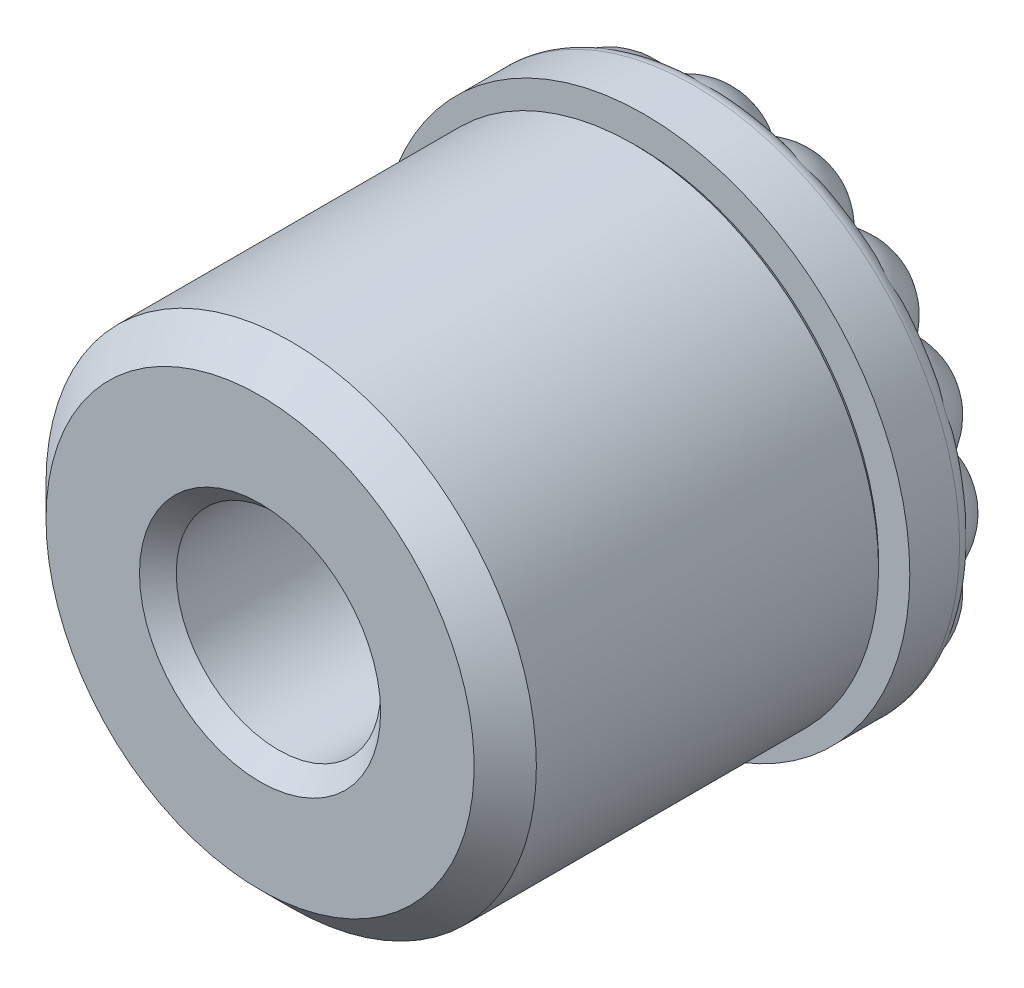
ISO-10303-21;
HEADER;
FILE_DESCRIPTION(('STEP AP214'),'2;1');
FILE_NAME('part.step','',(''),(''),'','','');
FILE_SCHEMA(('AUTOMOTIVE_DESIGN { 1 0 10303 214 1 1 1 1 }'));
ENDSEC;
DATA;
#1=APPLICATION_CONTEXT('core data for automotive mechanical design processes');
#2=APPLICATION_PROTOCOL_DEFINITION('international standard','automotive_design',2000,#1);
#3=PRODUCT_CONTEXT('',#1,'mechanical');
#4=PRODUCT('Part','Part','',(#3));
#5=PRODUCT_RELATED_PRODUCT_CATEGORY('part','',(#4));
#6=PRODUCT_DEFINITION_FORMATION('','',#4);
#7=PRODUCT_DEFINITION_CONTEXT('part definition',#1,'design');
#8=PRODUCT_DEFINITION('design','',#6,#7);
#9=PRODUCT_DEFINITION_SHAPE('','',#8);
#10=(LENGTH_UNIT() NAMED_UNIT(*) SI_UNIT(.MILLI.,.METRE.));
#11=(NAMED_UNIT(*) PLANE_ANGLE_UNIT() SI_UNIT($,.RADIAN.));
#12=(NAMED_UNIT(*) SI_UNIT($,.STERADIAN.) SOLID_ANGLE_UNIT());
#13=UNCERTAINTY_MEASURE_WITH_UNIT(LENGTH_MEASURE(1.E-05),#10,'distance_accuracy_value','');
#14=(GEOMETRIC_REPRESENTATION_CONTEXT(3) GLOBAL_UNCERTAINTY_ASSIGNED_CONTEXT((#13)) GLOBAL_UNIT_ASSIGNED_CONTEXT((#10,
#11,#12)) REPRESENTATION_CONTEXT('',''));
#15=CARTESIAN_POINT('',(0.,0.,0.));
#16=DIRECTION('',(0.,0.,1.));
#17=DIRECTION('',(1.,0.,0.));
#18=AXIS2_PLACEMENT_3D('',#15,#16,#17);
#19=CARTESIAN_POINT('',(0.,0.,12.));
#20=DIRECTION('',(0.,0.,-1.));
#21=DIRECTION('',(-1.,0.,0.));
#22=AXIS2_PLACEMENT_3D('',#19,#20,#21);
#23=PLANE('',#22);
#24=CARTESIAN_POINT('',(0.,0.,12.));
#25=DIRECTION('',(0.,0.,-1.));
#26=DIRECTION('',(-1.,0.,0.));
#27=AXIS2_PLACEMENT_3D('',#24,#25,#26);
#28=CIRCLE('',#27,2.95);
#29=CARTESIAN_POINT('',(-2.95,0.,12.));
#30=VERTEX_POINT('',#29);
#31=EDGE_CURVE('E22',#30,#30,#28,.T.);
#32=ORIENTED_EDGE('',*,*,#31,.T.);
#33=EDGE_LOOP('',(#32));
#34=FACE_BOUND('',#33,.T.);
#35=CARTESIAN_POINT('',(0.,0.,12.));
#36=DIRECTION('',(0.,0.,-1.));
#37=DIRECTION('',(-1.,0.,0.));
#38=AXIS2_PLACEMENT_3D('',#35,#36,#37);
#39=CIRCLE('',#38,5.238);
#40=CARTESIAN_POINT('',(-5.238,0.,12.));
#41=VERTEX_POINT('',#40);
#42=EDGE_CURVE('E843',#41,#41,#39,.F.);
#43=ORIENTED_EDGE('',*,*,#42,.T.);
#44=EDGE_LOOP('',(#43));
#45=FACE_BOUND('',#44,.T.);
#46=ADVANCED_FACE('F14',(#34,#45),#23,.F.);
#47=CARTESIAN_POINT('',(0.,0.,2.));
#48=DIRECTION('',(0.,0.,1.));
#49=DIRECTION('',(1.,0.,0.));
#50=AXIS2_PLACEMENT_3D('',#47,#48,#49);
#51=CYLINDRICAL_SURFACE('',#50,6.);
#52=CARTESIAN_POINT('',(0.,0.,2.8636));
#53=DIRECTION('',(0.,0.,-1.));
#54=DIRECTION('',(-1.,0.,0.));
#55=AXIS2_PLACEMENT_3D('',#52,#53,#54);
#56=CIRCLE('',#55,6.);
#57=CARTESIAN_POINT('',(-6.,0.,2.8636));
#58=VERTEX_POINT('',#57);
#59=EDGE_CURVE('E828',#58,#58,#56,.F.);
#60=ORIENTED_EDGE('',*,*,#59,.T.);
#61=EDGE_LOOP('',(#60));
#62=FACE_BOUND('',#61,.T.);
#63=CARTESIAN_POINT('',(0.,0.,11.238));
#64=DIRECTION('',(0.,0.,-1.));
#65=DIRECTION('',(-1.,0.,0.));
#66=AXIS2_PLACEMENT_3D('',#63,#64,#65);
#67=CIRCLE('',#66,6.);
#68=CARTESIAN_POINT('',(-6.,0.,11.238));
#69=VERTEX_POINT('',#68);
#70=EDGE_CURVE('E846',#69,#69,#67,.T.);
#71=ORIENTED_EDGE('',*,*,#70,.T.);
#72=EDGE_LOOP('',(#71));
#73=FACE_BOUND('',#72,.T.);
#74=ADVANCED_FACE('F875',(#62,#73),#51,.T.);
#75=CARTESIAN_POINT('',(0.,0.,11.238));
#76=DIRECTION('',(0.,0.,-1.));
#77=DIRECTION('',(-1.,0.,0.));
#78=AXIS2_PLACEMENT_3D('',#75,#76,#77);
#79=CONICAL_SURFACE('',#78,6.,0.78539816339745);
#80=ORIENTED_EDGE('',*,*,#42,.F.);
#81=EDGE_LOOP('',(#80));
#82=FACE_BOUND('',#81,.T.);
#83=ORIENTED_EDGE('',*,*,#70,.F.);
#84=EDGE_LOOP('',(#83));
#85=FACE_BOUND('',#84,.T.);
#86=ADVANCED_FACE('F872',(#82,#85),#79,.T.);
#87=CARTESIAN_POINT('',(0.,0.,2.7366));
#88=DIRECTION('',(0.,0.,-1.));
#89=DIRECTION('',(-1.,0.,0.));
#90=AXIS2_PLACEMENT_3D('',#87,#88,#89);
#91=PLANE('',#90);
#92=CARTESIAN_POINT('',(0.,0.,2.7366));
#93=DIRECTION('',(0.,0.,-1.));
#94=DIRECTION('',(-1.,0.,0.));
#95=AXIS2_PLACEMENT_3D('',#92,#93,#94);
#96=CIRCLE('',#95,5.627);
#97=CARTESIAN_POINT('',(-5.627,0.,2.7366));
#98=VERTEX_POINT('',#97);
#99=EDGE_CURVE('E300',#98,#98,#96,.F.);
#100=ORIENTED_EDGE('',*,*,#99,.T.);
#101=EDGE_LOOP('',(#100));
#102=FACE_BOUND('',#101,.T.);
#103=CARTESIAN_POINT('',(0.,0.,2.7366));
#104=DIRECTION('',(0.,0.,-1.));
#105=DIRECTION('',(-1.,0.,0.));
#106=AXIS2_PLACEMENT_3D('',#103,#104,#105);
#107=CIRCLE('',#106,5.873);
#108=CARTESIAN_POINT('',(-5.873,0.,2.7366));
#109=VERTEX_POINT('',#108);
#110=EDGE_CURVE('E832',#109,#109,#107,.T.);
#111=ORIENTED_EDGE('',*,*,#110,.T.);
#112=EDGE_LOOP('',(#111));
#113=FACE_BOUND('',#112,.T.);
#114=ADVANCED_FACE('F869',(#102,#113),#91,.T.);
#115=CARTESIAN_POINT('',(0.,0.,2.7366));
#116=DIRECTION('',(0.,0.,-1.));
#117=DIRECTION('',(-1.,0.,0.));
#118=AXIS2_PLACEMENT_3D('',#115,#116,#117);
#119=CYLINDRICAL_SURFACE('',#118,5.5);
#120=CARTESIAN_POINT('',(0.,0.,2.6096));
#121=DIRECTION('',(0.,0.,-1.));
#122=DIRECTION('',(-1.,0.,0.));
#123=AXIS2_PLACEMENT_3D('',#120,#121,#122);
#124=CIRCLE('',#123,5.5);
#125=CARTESIAN_POINT('',(-5.5,0.,2.6096));
#126=VERTEX_POINT('',#125);
#127=EDGE_CURVE('E824',#126,#126,#124,.T.);
#128=ORIENTED_EDGE('',*,*,#127,.T.);
#129=EDGE_LOOP('',(#128));
#130=FACE_BOUND('',#129,.T.);
#131=CARTESIAN_POINT('',(0.,0.,2.254));
#132=DIRECTION('',(0.,0.,-1.));
#133=DIRECTION('',(-1.,0.,0.));
#134=AXIS2_PLACEMENT_3D('',#131,#132,#133);
#135=CIRCLE('',#134,5.5);
#136=CARTESIAN_POINT('',(-5.5,0.,2.254));
#137=VERTEX_POINT('',#136);
#138=EDGE_CURVE('E837',#137,#137,#135,.F.);
#139=ORIENTED_EDGE('',*,*,#138,.T.);
#140=EDGE_LOOP('',(#139));
#141=FACE_BOUND('',#140,.T.);
#142=ADVANCED_FACE('F865',(#130,#141),#119,.T.);
#143=CARTESIAN_POINT('',(0.,0.,2.));
#144=DIRECTION('',(0.,0.,1.));
#145=DIRECTION('',(1.,0.,0.));
#146=AXIS2_PLACEMENT_3D('',#143,#144,#145);
#147=CONICAL_SURFACE('',#146,5.246,0.785398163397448);
#148=ORIENTED_EDGE('',*,*,#138,.F.);
#149=EDGE_LOOP('',(#148));
#150=FACE_BOUND('',#149,.T.);
#151=CARTESIAN_POINT('',(0.,0.,2.));
#152=DIRECTION('',(0.,0.,-1.));
#153=DIRECTION('',(-1.,0.,0.));
#154=AXIS2_PLACEMENT_3D('',#151,#152,#153);
#155=CIRCLE('',#154,5.246);
#156=CARTESIAN_POINT('',(-5.246,0.,2.));
#157=VERTEX_POINT('',#156);
#158=EDGE_CURVE('E840',#157,#157,#155,.T.);
#159=ORIENTED_EDGE('',*,*,#158,.F.);
#160=EDGE_LOOP('',(#159));
#161=FACE_BOUND('',#160,.T.);
#162=ADVANCED_FACE('F868',(#150,#161),#147,.T.);
#163=CARTESIAN_POINT('',(0.,0.,2.7366));
#164=DIRECTION('',(0.,0.,1.));
#165=DIRECTION('',(1.,0.,0.));
#166=AXIS2_PLACEMENT_3D('',#163,#164,#165);
#167=CONICAL_SURFACE('',#166,5.873,0.785398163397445);
#168=ORIENTED_EDGE('',*,*,#59,.F.);
#169=EDGE_LOOP('',(#168));
#170=FACE_BOUND('',#169,.T.);
#171=ORIENTED_EDGE('',*,*,#110,.F.);
#172=EDGE_LOOP('',(#171));
#173=FACE_BOUND('',#172,.T.);
#174=ADVANCED_FACE('F884',(#170,#173),#167,.T.);
#175=CARTESIAN_POINT('',(0.,0.,2.6096));
#176=DIRECTION('',(0.,0.,-1.));
#177=DIRECTION('',(-1.,0.,0.));
#178=AXIS2_PLACEMENT_3D('',#175,#176,#177);
#179=TOROIDAL_SURFACE('',#178,5.627,0.127);
#180=ORIENTED_EDGE('',*,*,#99,.F.);
#181=EDGE_LOOP('',(#180));
#182=FACE_BOUND('',#181,.T.);
#183=ORIENTED_EDGE('',*,*,#127,.F.);
#184=EDGE_LOOP('',(#183));
#185=FACE_BOUND('',#184,.T.);
#186=ADVANCED_FACE('F863',(#182,#185),#179,.F.);
#187=CARTESIAN_POINT('',(0.,0.,3.175));
#188=DIRECTION('',(0.,0.,1.));
#189=DIRECTION('',(0.,1.,0.));
#190=AXIS2_PLACEMENT_3D('',#187,#188,#189);
#191=SPHERICAL_SURFACE('',#190,3.175);
#192=CARTESIAN_POINT('',(-2.54,0.,1.905));
#193=DIRECTION('',(0.894427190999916,0.,0.447213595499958));
#194=DIRECTION('',(0.447213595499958,0.,-0.894427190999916));
#195=AXIS2_PLACEMENT_3D('',#192,#193,#194);
#196=CIRCLE('',#195,1.41990316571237);
#197=CARTESIAN_POINT('',(-2.02805361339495,-0.84004731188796,0.8811072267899));
#198=VERTEX_POINT('',#197);
#199=CARTESIAN_POINT('',(-2.02805361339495,0.840047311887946,0.8811072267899));
#200=VERTEX_POINT('',#199);
#201=EDGE_CURVE('E310',#198,#200,#196,.T.);
#202=ORIENTED_EDGE('',*,*,#201,.T.);
#203=CARTESIAN_POINT('',(-1.79605122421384,1.79605122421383,1.905));
#204=DIRECTION('',(0.632455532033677,-0.632455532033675,0.447213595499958));
#205=DIRECTION('',(0.707106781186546,0.707106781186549,0.));
#206=AXIS2_PLACEMENT_3D('',#203,#204,#205);
#207=CIRCLE('',#206,1.41990316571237);
#208=CARTESIAN_POINT('',(-0.840047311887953,2.02805361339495,0.8811072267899));
#209=VERTEX_POINT('',#208);
#210=EDGE_CURVE('E36',#200,#209,#207,.T.);
#211=ORIENTED_EDGE('',*,*,#210,.T.);
#212=CARTESIAN_POINT('',(0.,2.54,1.905));
#213=DIRECTION('',(0.,-0.894427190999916,0.447213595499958));
#214=DIRECTION('',(0.,0.447213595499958,0.894427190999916));
#215=AXIS2_PLACEMENT_3D('',#212,#213,#214);
#216=CIRCLE('',#215,1.41990316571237);
#217=CARTESIAN_POINT('',(0.840047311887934,2.02805361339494,0.8811072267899));
#218=VERTEX_POINT('',#217);
#219=EDGE_CURVE('E29',#209,#218,#216,.T.);
#220=ORIENTED_EDGE('',*,*,#219,.T.);
#221=CARTESIAN_POINT('',(1.79605122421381,1.79605122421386,1.905));
#222=DIRECTION('',(-0.632455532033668,-0.632455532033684,0.447213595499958));
#223=DIRECTION('',(0.707106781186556,-0.707106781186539,0.));
#224=AXIS2_PLACEMENT_3D('',#221,#222,#223);
#225=CIRCLE('',#224,1.41990316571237);
#226=CARTESIAN_POINT('',(2.02805361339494,0.840047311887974,0.8811072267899));
#227=VERTEX_POINT('',#226);
#228=EDGE_CURVE('E277',#218,#227,#225,.T.);
#229=ORIENTED_EDGE('',*,*,#228,.T.);
#230=CARTESIAN_POINT('',(2.54,0.,1.905));
#231=DIRECTION('',(-0.894427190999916,0.,0.447213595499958));
#232=DIRECTION('',(0.447213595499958,0.,0.894427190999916));
#233=AXIS2_PLACEMENT_3D('',#230,#231,#232);
#234=CIRCLE('',#233,1.41990316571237);
#235=CARTESIAN_POINT('',(2.02805361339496,-0.840047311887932,0.8811072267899));
#236=VERTEX_POINT('',#235);
#237=EDGE_CURVE('E289',#227,#236,#234,.T.);
#238=ORIENTED_EDGE('',*,*,#237,.T.);
#239=CARTESIAN_POINT('',(1.79605122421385,-1.79605122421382,1.905));
#240=DIRECTION('',(-0.632455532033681,0.63245553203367,0.447213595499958));
#241=DIRECTION('',(-0.707106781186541,-0.707106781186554,0.));
#242=AXIS2_PLACEMENT_3D('',#239,#240,#241);
#243=CIRCLE('',#242,1.41990316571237);
#244=CARTESIAN_POINT('',(0.840047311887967,-2.02805361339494,0.8811072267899));
#245=VERTEX_POINT('',#244);
#246=EDGE_CURVE('E294',#236,#245,#243,.T.);
#247=ORIENTED_EDGE('',*,*,#246,.T.);
#248=CARTESIAN_POINT('',(0.,-2.54,1.905));
#249=DIRECTION('',(0.,0.894427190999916,0.447213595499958));
#250=DIRECTION('',(0.,0.447213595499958,-0.894427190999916));
#251=AXIS2_PLACEMENT_3D('',#248,#249,#250);
#252=CIRCLE('',#251,1.41990316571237);
#253=CARTESIAN_POINT('',(-0.840047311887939,-2.02805361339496,0.8811072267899));
#254=VERTEX_POINT('',#253);
#255=EDGE_CURVE('E304',#245,#254,#252,.T.);
#256=ORIENTED_EDGE('',*,*,#255,.T.);
#257=CARTESIAN_POINT('',(-1.79605122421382,-1.79605122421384,1.905));
#258=DIRECTION('',(0.632455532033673,0.632455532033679,0.447213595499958));
#259=DIRECTION('',(-0.707106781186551,0.707106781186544,0.));
#260=AXIS2_PLACEMENT_3D('',#257,#258,#259);
#261=CIRCLE('',#260,1.41990316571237);
#262=EDGE_CURVE('E307',#254,#198,#261,.T.);
#263=ORIENTED_EDGE('',*,*,#262,.T.);
#264=EDGE_LOOP('',(#202,#211,#220,#229,#238,#247,#256,#263));
#265=FACE_BOUND('',#264,.T.);
#266=ADVANCED_FACE('F297',(#265),#191,.T.);
#267=CARTESIAN_POINT('',(2.24506403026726,2.24506403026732,1.5875));
#268=DIRECTION('',(0.,0.,-1.));
#269=DIRECTION('',(-0.707106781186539,-0.707106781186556,0.));
#270=AXIS2_PLACEMENT_3D('',#267,#268,#269);
#271=SPHERICAL_SURFACE('',#270,1.5875);
#272=ORIENTED_EDGE('',*,*,#228,.F.);
#273=CARTESIAN_POINT('',(1.12253201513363,2.71003201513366,1.5875));
#274=DIRECTION('',(0.923879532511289,-0.382683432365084,0.));
#275=DIRECTION('',(0.382683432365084,0.923879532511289,0.));
#276=AXIS2_PLACEMENT_3D('',#273,#274,#275);
#277=CIRCLE('',#276,1.02170587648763);
#278=CARTESIAN_POINT('',(1.35851029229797,3.27973397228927,0.772860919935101));
#279=VERTEX_POINT('',#278);
#280=EDGE_CURVE('E625',#218,#279,#277,.T.);
#281=ORIENTED_EDGE('',*,*,#280,.T.);
#282=CARTESIAN_POINT('',(2.06249819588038,3.39181111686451,1.5875));
#283=DIRECTION('',(-0.157223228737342,0.987563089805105,0.));
#284=DIRECTION('',(-0.987563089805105,-0.157223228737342,0.));
#285=AXIS2_PLACEMENT_3D('',#282,#283,#284);
#286=CIRCLE('',#285,1.08249576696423);
#287=CARTESIAN_POINT('',(2.29060037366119,3.42812571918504,0.52993310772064));
#288=VERTEX_POINT('',#287);
#289=EDGE_CURVE('E605',#279,#288,#286,.F.);
#290=ORIENTED_EDGE('',*,*,#289,.T.);
#291=CARTESIAN_POINT('',(2.85936304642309,2.85936304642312,1.5875));
#292=DIRECTION('',(0.707106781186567,0.707106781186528,0.));
#293=DIRECTION('',(-0.707106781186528,0.707106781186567,0.));
#294=AXIS2_PLACEMENT_3D('',#291,#292,#293);
#295=CIRCLE('',#294,1.32869473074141);
#296=CARTESIAN_POINT('',(3.42812571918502,2.29060037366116,0.52993310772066));
#297=VERTEX_POINT('',#296);
#298=EDGE_CURVE('E571',#288,#297,#295,.F.);
#299=ORIENTED_EDGE('',*,*,#298,.T.);
#300=CARTESIAN_POINT('',(3.39181111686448,2.0624981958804,1.5875));
#301=DIRECTION('',(0.987563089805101,-0.157223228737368,0.));
#302=DIRECTION('',(0.157223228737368,0.987563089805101,0.));
#303=AXIS2_PLACEMENT_3D('',#300,#301,#302);
#304=CIRCLE('',#303,1.08249576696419);
#305=CARTESIAN_POINT('',(3.27973397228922,1.35851029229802,0.77286091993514));
#306=VERTEX_POINT('',#305);
#307=EDGE_CURVE('E280',#297,#306,#304,.F.);
#308=ORIENTED_EDGE('',*,*,#307,.T.);
#309=CARTESIAN_POINT('',(2.71003201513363,1.12253201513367,1.5875));
#310=DIRECTION('',(-0.3826834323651,0.923879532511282,0.));
#311=DIRECTION('',(-0.923879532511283,-0.3826834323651,0.));
#312=AXIS2_PLACEMENT_3D('',#309,#310,#311);
#313=CIRCLE('',#312,1.02170587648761);
#314=EDGE_CURVE('E273',#306,#227,#313,.T.);
#315=ORIENTED_EDGE('',*,*,#314,.T.);
#316=EDGE_LOOP('',(#272,#281,#290,#299,#308,#315));
#317=FACE_BOUND('',#316,.T.);
#318=ADVANCED_FACE('F275',(#317),#271,.T.);
#319=CARTESIAN_POINT('',(3.175,0.,1.5875));
#320=DIRECTION('',(0.,0.,-1.));
#321=DIRECTION('',(-1.,0.,0.));
#322=AXIS2_PLACEMENT_3D('',#319,#320,#321);
#323=SPHERICAL_SURFACE('',#322,1.5875);
#324=ORIENTED_EDGE('',*,*,#237,.F.);
#325=ORIENTED_EDGE('',*,*,#314,.F.);
#326=CARTESIAN_POINT('',(3.85677910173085,0.939966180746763,1.5875));
#327=DIRECTION('',(0.587138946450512,0.809486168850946,0.));
#328=DIRECTION('',(-0.809486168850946,0.587138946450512,0.));
#329=AXIS2_PLACEMENT_3D('',#326,#327,#328);
#330=CIRCLE('',#329,1.08249576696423);
#331=CARTESIAN_POINT('',(4.04375,0.804351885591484,0.52993310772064));
#332=VERTEX_POINT('',#331);
#333=EDGE_CURVE('E561',#306,#332,#330,.F.);
#334=ORIENTED_EDGE('',*,*,#333,.T.);
#335=CARTESIAN_POINT('',(4.04375,0.,1.5875));
#336=DIRECTION('',(1.,0.,0.));
#337=DIRECTION('',(0.,1.,0.));
#338=AXIS2_PLACEMENT_3D('',#335,#336,#337);
#339=CIRCLE('',#338,1.32869473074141);
#340=CARTESIAN_POINT('',(4.04375,-0.804351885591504,0.52993310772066));
#341=VERTEX_POINT('',#340);
#342=EDGE_CURVE('E543',#332,#341,#339,.F.);
#343=ORIENTED_EDGE('',*,*,#342,.T.);
#344=CARTESIAN_POINT('',(3.85677910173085,-0.939966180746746,1.5875));
#345=DIRECTION('',(0.587138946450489,-0.809486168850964,0.));
#346=DIRECTION('',(0.809486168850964,0.587138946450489,0.));
#347=AXIS2_PLACEMENT_3D('',#344,#345,#346);
#348=CIRCLE('',#347,1.08249576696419);
#349=CARTESIAN_POINT('',(3.27973397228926,-1.35851029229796,0.77286091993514));
#350=VERTEX_POINT('',#349);
#351=EDGE_CURVE('E513',#341,#350,#348,.F.);
#352=ORIENTED_EDGE('',*,*,#351,.T.);
#353=CARTESIAN_POINT('',(2.71003201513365,-1.12253201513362,1.5875));
#354=DIRECTION('',(0.382683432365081,0.923879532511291,0.));
#355=DIRECTION('',(-0.923879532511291,0.382683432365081,0.));
#356=AXIS2_PLACEMENT_3D('',#353,#354,#355);
#357=CIRCLE('',#356,1.02170587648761);
#358=EDGE_CURVE('E285',#350,#236,#357,.T.);
#359=ORIENTED_EDGE('',*,*,#358,.T.);
#360=EDGE_LOOP('',(#324,#325,#334,#343,#352,#359));
#361=FACE_BOUND('',#360,.T.);
#362=ADVANCED_FACE('F290',(#361),#323,.T.);
#363=CARTESIAN_POINT('',(2.24506403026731,-2.24506403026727,1.5875));
#364=DIRECTION('',(0.,0.,-1.));
#365=DIRECTION('',(-0.707106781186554,0.707106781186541,0.));
#366=AXIS2_PLACEMENT_3D('',#363,#364,#365);
#367=SPHERICAL_SURFACE('',#366,1.5875);
#368=ORIENTED_EDGE('',*,*,#246,.F.);
#369=ORIENTED_EDGE('',*,*,#358,.F.);
#370=CARTESIAN_POINT('',(3.3918111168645,-2.0624981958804,1.5875));
#371=DIRECTION('',(0.987563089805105,0.157223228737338,0.));
#372=DIRECTION('',(-0.157223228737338,0.987563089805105,0.));
#373=AXIS2_PLACEMENT_3D('',#370,#371,#372);
#374=CIRCLE('',#373,1.08249576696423);
#375=CARTESIAN_POINT('',(3.42812571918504,-2.2906003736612,0.52993310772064));
#376=VERTEX_POINT('',#375);
#377=EDGE_CURVE('E542',#350,#376,#374,.F.);
#378=ORIENTED_EDGE('',*,*,#377,.T.);
#379=CARTESIAN_POINT('',(2.85936304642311,-2.8593630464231,1.5875));
#380=DIRECTION('',(0.707106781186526,-0.707106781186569,0.));
#381=DIRECTION('',(0.707106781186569,0.707106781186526,0.));
#382=AXIS2_PLACEMENT_3D('',#379,#380,#381);
#383=CIRCLE('',#382,1.32869473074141);
#384=CARTESIAN_POINT('',(2.29060037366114,-3.42812571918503,0.52993310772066));
#385=VERTEX_POINT('',#384);
#386=EDGE_CURVE('E499',#376,#385,#383,.F.);
#387=ORIENTED_EDGE('',*,*,#386,.T.);
#388=CARTESIAN_POINT('',(2.06249819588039,-3.39181111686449,1.5875));
#389=DIRECTION('',(-0.157223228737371,-0.9875630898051,0.));
#390=DIRECTION('',(0.9875630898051,-0.157223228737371,0.));
#391=AXIS2_PLACEMENT_3D('',#388,#389,#390);
#392=CIRCLE('',#391,1.08249576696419);
#393=CARTESIAN_POINT('',(1.35851029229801,-3.27973397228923,0.77286091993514));
#394=VERTEX_POINT('',#393);
#395=EDGE_CURVE('E481',#385,#394,#392,.F.);
#396=ORIENTED_EDGE('',*,*,#395,.T.);
#397=CARTESIAN_POINT('',(1.12253201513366,-2.71003201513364,1.5875));
#398=DIRECTION('',(0.923879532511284,0.382683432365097,0.));
#399=DIRECTION('',(-0.382683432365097,0.923879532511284,0.));
#400=AXIS2_PLACEMENT_3D('',#397,#398,#399);
#401=CIRCLE('',#400,1.02170587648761);
#402=EDGE_CURVE('E1255',#394,#245,#401,.T.);
#403=ORIENTED_EDGE('',*,*,#402,.T.);
#404=EDGE_LOOP('',(#368,#369,#378,#387,#396,#403));
#405=FACE_BOUND('',#404,.T.);
#406=ADVANCED_FACE('F522',(#405),#367,.T.);
#407=CARTESIAN_POINT('',(0.,-3.175,1.5875));
#408=DIRECTION('',(0.,0.,-1.));
#409=DIRECTION('',(0.,1.,0.));
#410=AXIS2_PLACEMENT_3D('',#407,#408,#409);
#411=SPHERICAL_SURFACE('',#410,1.5875);
#412=ORIENTED_EDGE('',*,*,#255,.F.);
#413=ORIENTED_EDGE('',*,*,#402,.F.);
#414=CARTESIAN_POINT('',(0.939966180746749,-3.85677910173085,1.5875));
#415=DIRECTION('',(0.809486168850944,-0.587138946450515,0.));
#416=DIRECTION('',(0.587138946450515,0.809486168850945,0.));
#417=AXIS2_PLACEMENT_3D('',#414,#415,#416);
#418=CIRCLE('',#417,1.08249576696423);
#419=CARTESIAN_POINT('',(0.80435188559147,-4.04375,0.52993310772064));
#420=VERTEX_POINT('',#419);
#421=EDGE_CURVE('E488',#394,#420,#418,.F.);
#422=ORIENTED_EDGE('',*,*,#421,.T.);
#423=CARTESIAN_POINT('',(0.,-4.04375,1.5875));
#424=DIRECTION('',(0.,-1.,0.));
#425=DIRECTION('',(1.,0.,0.));
#426=AXIS2_PLACEMENT_3D('',#423,#424,#425);
#427=CIRCLE('',#426,1.32869473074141);
#428=CARTESIAN_POINT('',(-0.804351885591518,-4.04375,0.52993310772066));
#429=VERTEX_POINT('',#428);
#430=EDGE_CURVE('E454',#420,#429,#427,.F.);
#431=ORIENTED_EDGE('',*,*,#430,.T.);
#432=CARTESIAN_POINT('',(-0.939966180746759,-3.85677910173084,1.5875));
#433=DIRECTION('',(-0.809486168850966,-0.587138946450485,0.));
#434=DIRECTION('',(0.587138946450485,-0.809486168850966,0.));
#435=AXIS2_PLACEMENT_3D('',#432,#433,#434);
#436=CIRCLE('',#435,1.08249576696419);
#437=CARTESIAN_POINT('',(-1.35851029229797,-3.27973397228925,0.77286091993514));
#438=VERTEX_POINT('',#437);
#439=EDGE_CURVE('E438',#429,#438,#436,.F.);
#440=ORIENTED_EDGE('',*,*,#439,.T.);
#441=CARTESIAN_POINT('',(-1.12253201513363,-2.71003201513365,1.5875));
#442=DIRECTION('',(0.923879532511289,-0.382683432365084,0.));
#443=DIRECTION('',(0.382683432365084,0.923879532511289,0.));
#444=AXIS2_PLACEMENT_3D('',#441,#442,#443);
#445=CIRCLE('',#444,1.02170587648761);
#446=EDGE_CURVE('E1252',#438,#254,#445,.T.);
#447=ORIENTED_EDGE('',*,*,#446,.T.);
#448=EDGE_LOOP('',(#412,#413,#422,#431,#440,#447));
#449=FACE_BOUND('',#448,.T.);
#450=ADVANCED_FACE('F469',(#449),#411,.T.);
#451=CARTESIAN_POINT('',(-2.24506403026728,-2.2450640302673,1.5875));
#452=DIRECTION('',(0.,0.,-1.));
#453=DIRECTION('',(0.707106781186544,0.707106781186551,0.));
#454=AXIS2_PLACEMENT_3D('',#451,#452,#453);
#455=SPHERICAL_SURFACE('',#454,1.5875);
#456=ORIENTED_EDGE('',*,*,#262,.F.);
#457=ORIENTED_EDGE('',*,*,#446,.F.);
#458=CARTESIAN_POINT('',(-2.06249819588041,-3.39181111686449,1.5875));
#459=DIRECTION('',(0.157223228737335,-0.987563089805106,0.));
#460=DIRECTION('',(0.987563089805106,0.157223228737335,0.));
#461=AXIS2_PLACEMENT_3D('',#458,#459,#460);
#462=CIRCLE('',#461,1.08249576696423);
#463=CARTESIAN_POINT('',(-2.29060037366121,-3.42812571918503,0.52993310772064));
#464=VERTEX_POINT('',#463);
#465=EDGE_CURVE('E443',#438,#464,#462,.F.);
#466=ORIENTED_EDGE('',*,*,#465,.T.);
#467=CARTESIAN_POINT('',(-2.85936304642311,-2.8593630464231,1.5875));
#468=DIRECTION('',(-0.707106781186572,-0.707106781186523,0.));
#469=DIRECTION('',(0.707106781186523,-0.707106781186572,0.));
#470=AXIS2_PLACEMENT_3D('',#467,#468,#469);
#471=CIRCLE('',#470,1.32869473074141);
#472=CARTESIAN_POINT('',(-3.42812571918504,-2.29060037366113,0.52993310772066));
#473=VERTEX_POINT('',#472);
#474=EDGE_CURVE('E425',#464,#473,#471,.F.);
#475=ORIENTED_EDGE('',*,*,#474,.T.);
#476=CARTESIAN_POINT('',(-3.3918111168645,-2.06249819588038,1.5875));
#477=DIRECTION('',(-0.9875630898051,0.157223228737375,0.));
#478=DIRECTION('',(-0.157223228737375,-0.9875630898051,0.));
#479=AXIS2_PLACEMENT_3D('',#476,#477,#478);
#480=CIRCLE('',#479,1.08249576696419);
#481=CARTESIAN_POINT('',(-3.27973397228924,-1.358510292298,0.77286091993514));
#482=VERTEX_POINT('',#481);
#483=EDGE_CURVE('E395',#473,#482,#480,.F.);
#484=ORIENTED_EDGE('',*,*,#483,.T.);
#485=CARTESIAN_POINT('',(-2.71003201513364,-1.12253201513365,1.5875));
#486=DIRECTION('',(0.382683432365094,-0.923879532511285,0.));
#487=DIRECTION('',(0.923879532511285,0.382683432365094,0.));
#488=AXIS2_PLACEMENT_3D('',#485,#486,#487);
#489=CIRCLE('',#488,1.02170587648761);
#490=EDGE_CURVE('E1249',#482,#198,#489,.T.);
#491=ORIENTED_EDGE('',*,*,#490,.T.);
#492=EDGE_LOOP('',(#456,#457,#466,#475,#484,#491));
#493=FACE_BOUND('',#492,.T.);
#494=ADVANCED_FACE('F643',(#493),#455,.T.);
#495=CARTESIAN_POINT('',(-3.175,0.,1.5875));
#496=DIRECTION('',(0.,0.,-1.));
#497=DIRECTION('',(1.,0.,0.));
#498=AXIS2_PLACEMENT_3D('',#495,#496,#497);
#499=SPHERICAL_SURFACE('',#498,1.5875);
#500=ORIENTED_EDGE('',*,*,#201,.F.);
#501=ORIENTED_EDGE('',*,*,#490,.F.);
#502=CARTESIAN_POINT('',(-3.85677910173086,-0.939966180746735,1.5875));
#503=DIRECTION('',(-0.587138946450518,-0.809486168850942,0.));
#504=DIRECTION('',(0.809486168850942,-0.587138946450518,0.));
#505=AXIS2_PLACEMENT_3D('',#502,#503,#504);
#506=CIRCLE('',#505,1.08249576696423);
#507=CARTESIAN_POINT('',(-4.04375,-0.804351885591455,0.52993310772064));
#508=VERTEX_POINT('',#507);
#509=EDGE_CURVE('E424',#482,#508,#506,.F.);
#510=ORIENTED_EDGE('',*,*,#509,.T.);
#511=CARTESIAN_POINT('',(-4.04375,0.,1.5875));
#512=DIRECTION('',(-1.,0.,0.));
#513=DIRECTION('',(0.,-1.,0.));
#514=AXIS2_PLACEMENT_3D('',#511,#512,#513);
#515=CIRCLE('',#514,1.32869473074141);
#516=CARTESIAN_POINT('',(-4.04375,0.804351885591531,0.52993310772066));
#517=VERTEX_POINT('',#516);
#518=EDGE_CURVE('E382',#508,#517,#515,.F.);
#519=ORIENTED_EDGE('',*,*,#518,.T.);
#520=CARTESIAN_POINT('',(-3.85677910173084,0.939966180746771,1.5875));
#521=DIRECTION('',(-0.587138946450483,0.809486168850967,0.));
#522=DIRECTION('',(-0.809486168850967,-0.587138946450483,0.));
#523=AXIS2_PLACEMENT_3D('',#520,#521,#522);
#524=CIRCLE('',#523,1.08249576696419);
#525=CARTESIAN_POINT('',(-3.27973397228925,1.35851029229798,0.77286091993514));
#526=VERTEX_POINT('',#525);
#527=EDGE_CURVE('E364',#517,#526,#524,.F.);
#528=ORIENTED_EDGE('',*,*,#527,.T.);
#529=CARTESIAN_POINT('',(-2.71003201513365,1.12253201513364,1.5875));
#530=DIRECTION('',(-0.382683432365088,-0.923879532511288,0.));
#531=DIRECTION('',(0.923879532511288,-0.382683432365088,0.));
#532=AXIS2_PLACEMENT_3D('',#529,#530,#531);
#533=CIRCLE('',#532,1.02170587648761);
#534=EDGE_CURVE('E1247',#526,#200,#533,.T.);
#535=ORIENTED_EDGE('',*,*,#534,.T.);
#536=EDGE_LOOP('',(#500,#501,#510,#519,#528,#535));
#537=FACE_BOUND('',#536,.T.);
#538=ADVANCED_FACE('F404',(#537),#499,.T.);
#539=CARTESIAN_POINT('',(-2.24506403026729,2.24506403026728,1.5875));
#540=DIRECTION('',(0.,0.,-1.));
#541=DIRECTION('',(0.707106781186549,-0.707106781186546,0.));
#542=AXIS2_PLACEMENT_3D('',#539,#540,#541);
#543=SPHERICAL_SURFACE('',#542,1.5875);
#544=ORIENTED_EDGE('',*,*,#210,.F.);
#545=ORIENTED_EDGE('',*,*,#534,.F.);
#546=CARTESIAN_POINT('',(-3.39181111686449,2.06249819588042,1.5875));
#547=DIRECTION('',(-0.987563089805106,-0.157223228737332,0.));
#548=DIRECTION('',(0.157223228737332,-0.987563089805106,0.));
#549=AXIS2_PLACEMENT_3D('',#546,#547,#548);
#550=CIRCLE('',#549,1.08249576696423);
#551=CARTESIAN_POINT('',(-3.42812571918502,2.29060037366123,0.52993310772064));
#552=VERTEX_POINT('',#551);
#553=EDGE_CURVE('E371',#526,#552,#550,.F.);
#554=ORIENTED_EDGE('',*,*,#553,.T.);
#555=CARTESIAN_POINT('',(-2.85936304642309,2.85936304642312,1.5875));
#556=DIRECTION('',(-0.707106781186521,0.707106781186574,0.));
#557=DIRECTION('',(-0.707106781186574,-0.707106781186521,0.));
#558=AXIS2_PLACEMENT_3D('',#555,#556,#557);
#559=CIRCLE('',#558,1.32869473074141);
#560=CARTESIAN_POINT('',(-2.29060037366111,3.42812571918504,0.52993310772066));
#561=VERTEX_POINT('',#560);
#562=EDGE_CURVE('E1304',#552,#561,#559,.F.);
#563=ORIENTED_EDGE('',*,*,#562,.T.);
#564=CARTESIAN_POINT('',(-2.06249819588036,3.39181111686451,1.5875));
#565=DIRECTION('',(0.157223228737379,0.987563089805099,0.));
#566=DIRECTION('',(-0.987563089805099,0.157223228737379,0.));
#567=AXIS2_PLACEMENT_3D('',#564,#565,#566);
#568=CIRCLE('',#567,1.08249576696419);
#569=CARTESIAN_POINT('',(-1.35851029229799,3.27973397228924,0.77286091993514));
#570=VERTEX_POINT('',#569);
#571=EDGE_CURVE('E314',#561,#570,#568,.F.);
#572=ORIENTED_EDGE('',*,*,#571,.T.);
#573=CARTESIAN_POINT('',(-1.12253201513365,2.71003201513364,1.5875));
#574=DIRECTION('',(-0.923879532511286,-0.382683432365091,0.));
#575=DIRECTION('',(0.382683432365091,-0.923879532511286,0.));
#576=AXIS2_PLACEMENT_3D('',#573,#574,#575);
#577=CIRCLE('',#576,1.02170587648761);
#578=EDGE_CURVE('E1245',#570,#209,#577,.T.);
#579=ORIENTED_EDGE('',*,*,#578,.T.);
#580=EDGE_LOOP('',(#544,#545,#554,#563,#572,#579));
#581=FACE_BOUND('',#580,.T.);
#582=ADVANCED_FACE('F650',(#581),#543,.T.);
#583=CARTESIAN_POINT('',(0.,3.175,1.5875));
#584=DIRECTION('',(0.,0.,-1.));
#585=DIRECTION('',(0.,-1.,0.));
#586=AXIS2_PLACEMENT_3D('',#583,#584,#585);
#587=SPHERICAL_SURFACE('',#586,1.5875);
#588=ORIENTED_EDGE('',*,*,#219,.F.);
#589=ORIENTED_EDGE('',*,*,#578,.F.);
#590=CARTESIAN_POINT('',(-0.939966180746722,3.85677910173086,1.5875));
#591=DIRECTION('',(-0.80948616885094,0.587138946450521,0.));
#592=DIRECTION('',(-0.587138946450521,-0.80948616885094,0.));
#593=AXIS2_PLACEMENT_3D('',#590,#591,#592);
#594=CIRCLE('',#593,1.08249576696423);
#595=CARTESIAN_POINT('',(-0.804351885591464,4.04375,0.52993310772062));
#596=VERTEX_POINT('',#595);
#597=EDGE_CURVE('E319',#570,#596,#594,.F.);
#598=ORIENTED_EDGE('',*,*,#597,.T.);
#599=CARTESIAN_POINT('',(0.,4.04375,1.5875));
#600=DIRECTION('',(0.,1.,0.));
#601=DIRECTION('',(0.,0.,-1.));
#602=AXIS2_PLACEMENT_3D('',#599,#600,#601);
#603=CIRCLE('',#602,1.32869473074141);
#604=CARTESIAN_POINT('',(0.804351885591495,4.04375,0.52993310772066));
#605=VERTEX_POINT('',#604);
#606=EDGE_CURVE('E284',#596,#605,#603,.F.);
#607=ORIENTED_EDGE('',*,*,#606,.T.);
#608=CARTESIAN_POINT('',(0.939966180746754,3.85677910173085,1.5875));
#609=DIRECTION('',(0.809486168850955,0.587138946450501,0.));
#610=DIRECTION('',(-0.587138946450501,0.809486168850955,0.));
#611=AXIS2_PLACEMENT_3D('',#608,#609,#610);
#612=CIRCLE('',#611,1.08249576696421);
#613=EDGE_CURVE('E597',#605,#279,#612,.F.);
#614=ORIENTED_EDGE('',*,*,#613,.T.);
#615=ORIENTED_EDGE('',*,*,#280,.F.);
#616=EDGE_LOOP('',(#588,#589,#598,#607,#614,#615));
#617=FACE_BOUND('',#616,.T.);
#618=ADVANCED_FACE('F633',(#617),#587,.T.);
#619=CARTESIAN_POINT('',(0.,6.119,1.));
#620=DIRECTION('',(0.,0.,1.));
#621=DIRECTION('',(1.,0.,0.));
#622=AXIS2_PLACEMENT_3D('',#619,#620,#621);
#623=PLANE('',#622);
#624=CARTESIAN_POINT('',(-1.87993236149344,4.53855820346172,1.));
#625=DIRECTION('',(0.,0.,1.));
#626=DIRECTION('',(1.,0.,0.));
#627=AXIS2_PLACEMENT_3D('',#624,#625,#626);
#628=CIRCLE('',#627,1.47478812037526);
#629=CARTESIAN_POINT('',(-1.44170683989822,5.94673375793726,1.));
#630=VERTEX_POINT('',#629);
#631=CARTESIAN_POINT('',(-1.15865063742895,5.82493010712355,1.));
#632=VERTEX_POINT('',#631);
#633=EDGE_CURVE('E320',#630,#632,#628,.F.);
#634=ORIENTED_EDGE('',*,*,#633,.F.);
#635=CARTESIAN_POINT('',(0.,0.,1.));
#636=DIRECTION('',(0.,0.,-1.));
#637=DIRECTION('',(-1.,0.,0.));
#638=AXIS2_PLACEMENT_3D('',#635,#636,#637);
#639=CIRCLE('',#638,6.119);
#640=CARTESIAN_POINT('',(-0.943753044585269,6.04578292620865,1.));
#641=VERTEX_POINT('',#640);
#642=EDGE_CURVE('E1241',#630,#641,#639,.T.);
#643=ORIENTED_EDGE('',*,*,#642,.T.);
#644=CARTESIAN_POINT('',(0.,4.9125,1.));
#645=DIRECTION('',(0.,0.,1.));
#646=DIRECTION('',(1.,0.,0.));
#647=AXIS2_PLACEMENT_3D('',#644,#645,#646);
#648=CIRCLE('',#647,1.47478812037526);
#649=EDGE_CURVE('E618',#632,#641,#648,.F.);
#650=ORIENTED_EDGE('',*,*,#649,.F.);
#651=EDGE_LOOP('',(#634,#643,#650));
#652=FACE_BOUND('',#651,.T.);
#653=ADVANCED_FACE('F631',(#652),#623,.F.);
#654=CARTESIAN_POINT('',(0.,4.9125,1.5875));
#655=DIRECTION('',(0.,0.,-1.));
#656=DIRECTION('',(0.,1.,0.));
#657=AXIS2_PLACEMENT_3D('',#654,#655,#656);
#658=SPHERICAL_SURFACE('',#657,1.5875);
#659=CARTESIAN_POINT('',(-0.939966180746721,4.72552910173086,1.5875));
#660=DIRECTION('',(-0.980785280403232,-0.195090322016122,0.));
#661=DIRECTION('',(0.195090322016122,-0.980785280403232,0.));
#662=AXIS2_PLACEMENT_3D('',#659,#660,#661);
#663=CIRCLE('',#662,1.26556774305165);
#664=EDGE_CURVE('E331',#632,#596,#663,.T.);
#665=ORIENTED_EDGE('',*,*,#664,.F.);
#666=ORIENTED_EDGE('',*,*,#649,.T.);
#667=CARTESIAN_POINT('',(-1.43685455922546,5.55518618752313,1.3812));
#668=CARTESIAN_POINT('',(-1.43391941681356,5.55591340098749,1.36300337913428));
#669=CARTESIAN_POINT('',(-1.42993180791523,5.55829855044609,1.34514412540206));
#670=CARTESIAN_POINT('',(-1.42023371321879,5.56580561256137,1.31071235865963));
#671=CARTESIAN_POINT('',(-1.41454314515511,5.5708963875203,1.29412761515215));
#672=CARTESIAN_POINT('',(-1.40177897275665,5.58323882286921,1.26252432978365));
#673=CARTESIAN_POINT('',(-1.39471395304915,5.59047720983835,1.24749691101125));
#674=CARTESIAN_POINT('',(-1.37943484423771,5.60663354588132,1.21895843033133));
#675=CARTESIAN_POINT('',(-1.37121709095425,5.61555688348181,1.20545246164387));
#676=CARTESIAN_POINT('',(-1.34839251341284,5.64065612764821,1.17198441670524));
#677=CARTESIAN_POINT('',(-1.33302178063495,5.65785990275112,1.15331439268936));
#678=CARTESIAN_POINT('',(-1.30049636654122,5.69417094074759,1.11980756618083));
#679=CARTESIAN_POINT('',(-1.28333818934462,5.71328193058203,1.10497848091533));
#680=CARTESIAN_POINT('',(-1.23812709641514,5.76293182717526,1.07173553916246));
#681=CARTESIAN_POINT('',(-1.20913358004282,5.79414245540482,1.0556102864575));
#682=CARTESIAN_POINT('',(-1.14870579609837,5.85686978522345,1.02994131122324));
#683=CARTESIAN_POINT('',(-1.11726645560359,5.8883869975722,1.02041169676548));
#684=CARTESIAN_POINT('',(-1.03686701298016,5.96539824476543,1.00357632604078));
#685=CARTESIAN_POINT('',(-0.986720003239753,6.01036605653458,0.999515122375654));
#686=CARTESIAN_POINT('',(-0.88307960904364,6.09587561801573,1.00057601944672));
#687=CARTESIAN_POINT('',(-0.829586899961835,6.13641825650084,1.00569627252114));
#688=CARTESIAN_POINT('',(-0.703924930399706,6.22252227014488,1.02541881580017));
#689=CARTESIAN_POINT('',(-0.630800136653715,6.26618684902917,1.04231988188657));
#690=CARTESIAN_POINT('',(-0.51786599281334,6.32283521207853,1.07287669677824));
#691=CARTESIAN_POINT('',(-0.479503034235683,6.34030060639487,1.08399074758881));
#692=CARTESIAN_POINT('',(-0.401708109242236,6.37193112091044,1.10714702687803));
#693=CARTESIAN_POINT('',(-0.362276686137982,6.38609788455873,1.11918878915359));
#694=CARTESIAN_POINT('',(-0.297011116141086,6.40617553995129,1.13847159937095));
#695=CARTESIAN_POINT('',(-0.271553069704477,6.41320039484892,1.14583803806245));
#696=CARTESIAN_POINT('',(-0.220013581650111,6.42564242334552,1.15982963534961));
#697=CARTESIAN_POINT('',(-0.193931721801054,6.43105848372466,1.16645427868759));
#698=CARTESIAN_POINT('',(-0.141573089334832,6.43994916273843,1.17794399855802));
#699=CARTESIAN_POINT('',(-0.115309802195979,6.4434592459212,1.18284057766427));
#700=CARTESIAN_POINT('',(-0.0622446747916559,6.44836407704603,1.18985391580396));
#701=CARTESIAN_POINT('',(-0.035444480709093,6.44976451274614,1.19197814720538));
#702=CARTESIAN_POINT('',(0.0136639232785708,6.45021378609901,1.19265503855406));
#703=CARTESIAN_POINT('',(0.0359618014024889,6.44962169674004,1.19175313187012));
#704=CARTESIAN_POINT('',(0.0802851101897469,6.44691553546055,1.18777801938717));
#705=CARTESIAN_POINT('',(0.102310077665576,6.44479916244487,1.18470153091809));
#706=CARTESIAN_POINT('',(0.168354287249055,6.43635707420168,1.17310770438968));
#707=CARTESIAN_POINT('',(0.211666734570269,6.42794096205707,1.16224993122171));
#708=CARTESIAN_POINT('',(0.293954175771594,6.40746722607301,1.13958215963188));
#709=CARTESIAN_POINT('',(0.333031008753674,6.39567034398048,1.12787422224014));
#710=CARTESIAN_POINT('',(0.410126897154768,6.36874153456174,1.10468260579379));
#711=CARTESIAN_POINT('',(0.448145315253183,6.35360764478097,1.09319906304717));
#712=CARTESIAN_POINT('',(0.522997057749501,6.32039098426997,1.07149685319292));
#713=CARTESIAN_POINT('',(0.559835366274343,6.30232337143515,1.06127213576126));
#714=CARTESIAN_POINT('',(0.632516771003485,6.26343785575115,1.04267731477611));
#715=CARTESIAN_POINT('',(0.668359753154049,6.24261963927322,1.03430742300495));
#716=CARTESIAN_POINT('',(0.76280588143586,6.18359678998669,1.01513902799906));
#717=CARTESIAN_POINT('',(0.820472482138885,6.14312854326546,1.00650390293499));
#718=CARTESIAN_POINT('',(0.932289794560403,6.05663853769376,0.998482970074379));
#719=CARTESIAN_POINT('',(0.98644140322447,6.01061820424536,0.999094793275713));
#720=CARTESIAN_POINT('',(1.07209576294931,5.93209307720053,1.01016308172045));
#721=CARTESIAN_POINT('',(1.1048917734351,5.90049566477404,1.01709879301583));
#722=CARTESIAN_POINT('',(1.16821546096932,5.83698595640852,1.03717707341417));
#723=CARTESIAN_POINT('',(1.19874712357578,5.80507433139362,1.05030842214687));
#724=CARTESIAN_POINT('',(1.24771981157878,5.75244477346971,1.07874266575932));
#725=CARTESIAN_POINT('',(1.26693522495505,5.7313730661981,1.0920517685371));
#726=CARTESIAN_POINT('',(1.30365750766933,5.6906878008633,1.12270107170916));
#727=CARTESIAN_POINT('',(1.32116684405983,5.67107214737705,1.14003532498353));
#728=CARTESIAN_POINT('',(1.34896573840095,5.6400833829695,1.17331124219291));
#729=CARTESIAN_POINT('',(1.35984233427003,5.62800619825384,1.18810225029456));
#730=CARTESIAN_POINT('',(1.38016892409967,5.60583385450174,1.21999944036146));
#731=CARTESIAN_POINT('',(1.38962042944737,5.59573659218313,1.23710313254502));
#732=CARTESIAN_POINT('',(1.40472652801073,5.58032587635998,1.26938760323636));
#733=CARTESIAN_POINT('',(1.41075578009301,5.57444671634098,1.28412103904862));
#734=CARTESIAN_POINT('',(1.4214466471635,5.56481616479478,1.31471274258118));
#735=CARTESIAN_POINT('',(1.42611231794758,5.56105843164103,1.33056749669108));
#736=CARTESIAN_POINT('',(1.43267325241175,5.55679940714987,1.35810596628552));
#737=CARTESIAN_POINT('',(1.43497959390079,5.55565632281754,1.36959742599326));
#738=CARTESIAN_POINT('',(1.43685455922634,5.55518618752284,1.38119999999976));
#739=B_SPLINE_CURVE_WITH_KNOTS('',3,(#667,#668,#669,#670,#671,#672,#673,#674,#675,#676,#677,
#678,#679,#680,#681,#682,#683,#684,#685,#686,#687,#688,#689,#690,#691,#692,#693,#694,#695,#696,
#697,#698,#699,#700,#701,#702,#703,#704,#705,#706,#707,#708,#709,#710,#711,#712,#713,#714,#715,
#716,#717,#718,#719,#720,#721,#722,#723,#724,#725,#726,#727,#728,#729,#730,#731,#732,#733,#734,
#735,#736,#737,#738),.UNSPECIFIED.,.F.,.F.,(4,2,2,2,2,2,2,2,2,2,2,2,2,2,2,2,2,2,2,2,2,2,2,2,2,2,
2,2,2,2,2,2,2,2,2,4),(0.,0.0550902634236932,0.109559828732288,0.163699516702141,
0.218015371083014,0.30654445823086,0.395250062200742,0.531137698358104,0.667315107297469,
0.868635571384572,1.06991552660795,1.32893764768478,1.45961049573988,1.59021809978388,
1.67242614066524,1.7546909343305,1.83536744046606,1.9158260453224,1.98261638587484,
2.04950776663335,2.1852818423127,2.31256217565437,2.4399175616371,2.56663472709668,
2.69336635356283,2.90548676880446,3.11755284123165,3.25539205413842,3.39298259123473,
3.48714264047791,3.58116444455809,3.64689270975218,3.71255076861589,3.76327629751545,
3.81384937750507,3.84909443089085),.UNSPECIFIED.);
#740=CARTESIAN_POINT('',(0.943753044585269,6.04578292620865,1.));
#741=VERTEX_POINT('',#740);
#742=EDGE_CURVE('E619',#641,#741,#739,.T.);
#743=ORIENTED_EDGE('',*,*,#742,.T.);
#744=CARTESIAN_POINT('',(1.15865063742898,5.82493010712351,1.));
#745=VERTEX_POINT('',#744);
#746=EDGE_CURVE('E616',#741,#745,#648,.F.);
#747=ORIENTED_EDGE('',*,*,#746,.T.);
#748=CARTESIAN_POINT('',(0.939966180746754,4.72552910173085,1.5875));
#749=DIRECTION('',(0.980785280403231,-0.195090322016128,0.));
#750=DIRECTION('',(0.195090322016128,0.980785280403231,0.));
#751=AXIS2_PLACEMENT_3D('',#748,#749,#750);
#752=CIRCLE('',#751,1.26556774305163);
#753=EDGE_CURVE('E776',#605,#745,#752,.T.);
#754=ORIENTED_EDGE('',*,*,#753,.F.);
#755=ORIENTED_EDGE('',*,*,#606,.F.);
#756=EDGE_LOOP('',(#665,#666,#743,#747,#754,#755));
#757=FACE_BOUND('',#756,.T.);
#758=ADVANCED_FACE('F351',(#757),#658,.T.);
#759=CARTESIAN_POINT('',(1.87993236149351,4.5385582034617,1.));
#760=DIRECTION('',(0.,0.,1.));
#761=DIRECTION('',(1.,0.,0.));
#762=AXIS2_PLACEMENT_3D('',#759,#760,#761);
#763=CIRCLE('',#762,1.47478812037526);
#764=CARTESIAN_POINT('',(1.44170683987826,5.9467337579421,1.));
#765=VERTEX_POINT('',#764);
#766=EDGE_CURVE('E602',#745,#765,#763,.F.);
#767=ORIENTED_EDGE('',*,*,#766,.F.);
#768=ORIENTED_EDGE('',*,*,#746,.F.);
#769=EDGE_CURVE('E1242',#741,#765,#639,.T.);
#770=ORIENTED_EDGE('',*,*,#769,.T.);
#771=EDGE_LOOP('',(#767,#768,#770));
#772=FACE_BOUND('',#771,.T.);
#773=ADVANCED_FACE('F630',(#772),#623,.F.);
#774=CARTESIAN_POINT('',(1.87993236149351,4.5385582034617,1.5875));
#775=DIRECTION('',(0.,0.,-1.));
#776=DIRECTION('',(0.382683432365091,0.923879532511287,0.));
#777=AXIS2_PLACEMENT_3D('',#774,#775,#776);
#778=SPHERICAL_SURFACE('',#777,1.5875);
#779=CARTESIAN_POINT('',(2.67679721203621,4.00611013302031,1.5875));
#780=DIRECTION('',(0.831469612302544,-0.555570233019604,0.));
#781=DIRECTION('',(0.555570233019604,0.831469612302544,0.));
#782=AXIS2_PLACEMENT_3D('',#779,#780,#781);
#783=CIRCLE('',#782,1.26556774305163);
#784=CARTESIAN_POINT('',(3.29955785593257,4.93813730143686,1.));
#785=VERTEX_POINT('',#784);
#786=EDGE_CURVE('E773',#288,#785,#783,.T.);
#787=ORIENTED_EDGE('',*,*,#786,.F.);
#788=ORIENTED_EDGE('',*,*,#289,.F.);
#789=ORIENTED_EDGE('',*,*,#613,.F.);
#790=ORIENTED_EDGE('',*,*,#753,.T.);
#791=ORIENTED_EDGE('',*,*,#766,.T.);
#792=CARTESIAN_POINT('',(0.798397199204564,5.68218325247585,1.3812));
#793=CARTESIAN_POINT('',(0.801387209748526,5.68173187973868,1.36300337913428));
#794=CARTESIAN_POINT('',(0.805984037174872,5.68240947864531,1.34514412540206));
#795=CARTESIAN_POINT('',(0.817816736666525,5.68563379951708,1.31071235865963));
#796=CARTESIAN_POINT('',(0.825022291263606,5.68815937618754,1.29412761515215));
#797=CARTESIAN_POINT('',(0.841538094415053,5.694677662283,1.26252432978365));
#798=CARTESIAN_POINT('',(0.850835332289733,5.6986613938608,1.24749691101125));
#799=CARTESIAN_POINT('',(0.871134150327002,5.70774084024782,1.21895843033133));
#800=CARTESIAN_POINT('',(0.882141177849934,5.71284013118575,1.20545246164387));
#801=CARTESIAN_POINT('',(0.912833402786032,5.72729422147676,1.17198441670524));
#802=CARTESIAN_POINT('',(0.933617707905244,5.73730631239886,1.15331439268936));
#803=CARTESIAN_POINT('',(0.977562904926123,5.75840640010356,1.11980756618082));
#804=CARTESIAN_POINT('',(1.00072845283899,5.76949650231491,1.10497848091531));
#805=CARTESIAN_POINT('',(1.06149824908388,5.79806548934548,1.07173553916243));
#806=CARTESIAN_POINT('',(1.10022855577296,5.81580501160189,1.05561028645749));
#807=CARTESIAN_POINT('',(1.18006125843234,5.85063279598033,1.02994131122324));
#808=CARTESIAN_POINT('',(1.22116853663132,5.8677195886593,1.02041169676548));
#809=CARTESIAN_POINT('',(1.32491886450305,5.90810116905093,1.00357632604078));
#810=CARTESIAN_POINT('',(1.38845709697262,5.93045558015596,0.999515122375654));
#811=CARTESIAN_POINT('',(1.51693142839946,5.96979465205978,1.00057601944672));
#812=CARTESIAN_POINT('',(1.58186724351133,5.98678039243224,1.00569627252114));
#813=CARTESIAN_POINT('',(1.73091434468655,6.01824137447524,1.02541881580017));
#814=CARTESIAN_POINT('',(1.8151825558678,6.03059853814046,1.04231988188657));
#815=CARTESIAN_POINT('',(1.9411984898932,6.03971677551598,1.07287669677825));
#816=CARTESIAN_POINT('',(1.98332495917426,6.04117182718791,1.08399074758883));
#817=CARTESIAN_POINT('',(2.06730257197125,6.04062378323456,1.10714702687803));
#818=CARTESIAN_POINT('',(2.1091538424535,6.03862241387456,1.11918878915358));
#819=CARTESIAN_POINT('',(2.17713475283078,6.03219569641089,1.13847159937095));
#820=CARTESIAN_POINT('',(2.20334321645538,6.02894344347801,1.14583803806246));
#821=CARTESIAN_POINT('',(2.25572085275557,6.02071507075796,1.15982963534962));
#822=CARTESIAN_POINT('',(2.28188998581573,6.01573776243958,1.1664542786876));
#823=CARTESIAN_POINT('',(2.3336653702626,6.00391489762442,1.17794399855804));
#824=CARTESIAN_POINT('',(2.35927273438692,5.99710726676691,1.18284057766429));
#825=CARTESIAN_POINT('',(2.4101755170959,5.98133159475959,1.18985391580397));
#826=CARTESIAN_POINT('',(2.43547159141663,5.97236943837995,1.19197814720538));
#827=CARTESIAN_POINT('',(2.48101377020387,5.9539915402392,1.19265503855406));
#828=CARTESIAN_POINT('',(2.50138774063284,5.94491149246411,1.19175313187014));
#829=CARTESIAN_POINT('',(2.54130153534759,5.92544952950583,1.18777801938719));
#830=CARTESIAN_POINT('',(2.56084005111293,5.91506566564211,1.18470153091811));
#831=CARTESIAN_POINT('',(2.61862629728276,5.88199216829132,1.17310770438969));
#832=CARTESIAN_POINT('',(2.65542107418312,5.85764173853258,1.16224993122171));
#833=CARTESIAN_POINT('',(2.72360979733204,5.80723643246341,1.13958215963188));
#834=CARTESIAN_POINT('',(2.75519761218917,5.78138347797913,1.12787422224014));
#835=CARTESIAN_POINT('',(2.81611971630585,5.72700118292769,1.1046826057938));
#836=CARTESIAN_POINT('',(2.84545266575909,5.69847027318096,1.09319906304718));
#837=CARTESIAN_POINT('',(2.90189519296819,5.63913755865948,1.07149685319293));
#838=CARTESIAN_POINT('',(2.92901517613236,5.60834785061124,1.06127213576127));
#839=CARTESIAN_POINT('',(2.98128319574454,5.54460834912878,1.04267731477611));
#840=CARTESIAN_POINT('',(3.00643100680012,5.51165830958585,1.03430742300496));
#841=CARTESIAN_POINT('',(3.07110078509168,5.42098533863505,1.01513902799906));
#842=CARTESIAN_POINT('',(3.10889124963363,5.36152950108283,1.00650390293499));
#843=CARTESIAN_POINT('',(3.17909868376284,5.23883252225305,0.998482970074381));
#844=CARTESIAN_POINT('',(3.21151702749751,5.17559235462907,0.999094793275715));
#845=CARTESIAN_POINT('',(3.26060107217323,5.07026609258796,1.01016308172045));
#846=CARTESIAN_POINT('',(3.27880882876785,5.02852340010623,1.01709879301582));
#847=CARTESIAN_POINT('',(3.31300817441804,4.94561515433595,1.03717707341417));
#848=CARTESIAN_POINT('',(3.32900370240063,4.90444869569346,1.05030842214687));
#849=CARTESIAN_POINT('',(3.35410810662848,4.8370842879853,1.07874266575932));
#850=CARTESIAN_POINT('',(3.36379704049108,4.81026314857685,1.09205176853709));
#851=CARTESIAN_POINT('',(3.38215442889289,4.75862185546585,1.12270107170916));
#852=CARTESIAN_POINT('',(3.39082436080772,4.73379882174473,1.14003532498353));
#853=CARTESIAN_POINT('',(3.40464830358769,4.69453076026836,1.17331124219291));
#854=CARTESIAN_POINT('',(3.41007522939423,4.67921060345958,1.18810225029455));
#855=CARTESIAN_POINT('',(3.42036956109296,4.65094737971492,1.21999944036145));
#856=CARTESIAN_POINT('',(3.42523755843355,4.63800179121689,1.23710313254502));
#857=CARTESIAN_POINT('',(3.43329634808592,4.61798329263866,1.26938760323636));
#858=CARTESIAN_POINT('',(3.4366167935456,4.6102443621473,1.28412103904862));
#859=CARTESIAN_POINT('',(3.44280841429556,4.59725567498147,1.31471274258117));
#860=CARTESIAN_POINT('',(3.44568090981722,4.59199850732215,1.33056749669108));
#861=CARTESIAN_POINT('',(3.45011256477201,4.58555292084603,1.35810596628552));
#862=CARTESIAN_POINT('',(3.45180590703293,4.58361424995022,1.36959742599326));
#863=CARTESIAN_POINT('',(3.45335823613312,4.58246238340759,1.38119999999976));
#864=B_SPLINE_CURVE_WITH_KNOTS('',3,(#792,#793,#794,#795,#796,#797,#798,#799,#800,#801,#802,
#803,#804,#805,#806,#807,#808,#809,#810,#811,#812,#813,#814,#815,#816,#817,#818,#819,#820,#821,
#822,#823,#824,#825,#826,#827,#828,#829,#830,#831,#832,#833,#834,#835,#836,#837,#838,#839,#840,
#841,#842,#843,#844,#845,#846,#847,#848,#849,#850,#851,#852,#853,#854,#855,#856,#857,#858,#859,
#860,#861,#862,#863),.UNSPECIFIED.,.F.,.F.,(4,2,2,2,2,2,2,2,2,2,2,2,2,2,2,2,2,2,2,2,2,2,2,2,2,2,
2,2,2,2,2,2,2,2,2,4),(0.,0.0550902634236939,0.109559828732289,0.163699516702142,
0.218015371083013,0.30654445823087,0.395250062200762,0.531137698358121,0.667315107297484,
0.868635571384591,1.06991552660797,1.3289376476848,1.4596104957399,1.5902180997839,
1.67242614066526,1.75469093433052,1.83536744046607,1.91582604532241,1.98261638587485,
2.04950776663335,2.1852818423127,2.31256217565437,2.4399175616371,2.56663472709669,
2.69336635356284,2.90548676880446,3.11755284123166,3.25539205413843,3.39298259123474,
3.48714264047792,3.58116444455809,3.64689270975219,3.7125507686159,3.76327629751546,
3.81384937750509,3.84909443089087),.UNSPECIFIED.);
#865=CARTESIAN_POINT('',(3.18553508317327,5.2244164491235,1.));
#866=VERTEX_POINT('',#865);
#867=EDGE_CURVE('E609',#765,#866,#864,.T.);
#868=ORIENTED_EDGE('',*,*,#867,.T.);
#869=EDGE_CURVE('E606',#866,#785,#763,.F.);
#870=ORIENTED_EDGE('',*,*,#869,.T.);
#871=EDGE_LOOP('',(#787,#788,#789,#790,#791,#868,#870));
#872=FACE_BOUND('',#871,.T.);
#873=ADVANCED_FACE('F586',(#872),#778,.T.);
#874=CARTESIAN_POINT('',(3.47366206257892,3.47366206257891,1.));
#875=DIRECTION('',(0.,0.,1.));
#876=DIRECTION('',(1.,0.,0.));
#877=AXIS2_PLACEMENT_3D('',#874,#875,#876);
#878=CIRCLE('',#877,1.47478812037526);
#879=CARTESIAN_POINT('',(3.6076799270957,4.94234828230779,1.));
#880=VERTEX_POINT('',#879);
#881=EDGE_CURVE('E598',#785,#880,#878,.F.);
#882=ORIENTED_EDGE('',*,*,#881,.F.);
#883=ORIENTED_EDGE('',*,*,#869,.F.);
#884=EDGE_CURVE('E771',#866,#880,#639,.T.);
#885=ORIENTED_EDGE('',*,*,#884,.T.);
#886=EDGE_LOOP('',(#882,#883,#885));
#887=FACE_BOUND('',#886,.T.);
#888=ADVANCED_FACE('F584',(#887),#623,.F.);
#889=CARTESIAN_POINT('',(3.47366206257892,3.47366206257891,1.5875));
#890=DIRECTION('',(0.,0.,-1.));
#891=DIRECTION('',(0.707106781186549,0.707106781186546,0.));
#892=AXIS2_PLACEMENT_3D('',#889,#890,#891);
#893=SPHERICAL_SURFACE('',#892,1.5875);
#894=CARTESIAN_POINT('',(4.00611013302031,2.6767972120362,1.5875));
#895=DIRECTION('',(0.5555702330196,-0.831469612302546,0.));
#896=DIRECTION('',(0.831469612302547,0.5555702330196,0.));
#897=AXIS2_PLACEMENT_3D('',#894,#895,#896);
#898=CIRCLE('',#897,1.26556774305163);
#899=CARTESIAN_POINT('',(4.93813730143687,3.29955785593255,1.));
#900=VERTEX_POINT('',#899);
#901=EDGE_CURVE('E775',#297,#900,#898,.T.);
#902=ORIENTED_EDGE('',*,*,#901,.F.);
#903=ORIENTED_EDGE('',*,*,#298,.F.);
#904=ORIENTED_EDGE('',*,*,#786,.T.);
#905=ORIENTED_EDGE('',*,*,#881,.T.);
#906=CARTESIAN_POINT('',(2.91210022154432,4.94411942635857,1.3812));
#907=CARTESIAN_POINT('',(2.91468989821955,4.94255818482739,1.36300337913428));
#908=CARTESIAN_POINT('',(2.91919611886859,4.94142507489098,1.34514412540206));
#909=CARTESIAN_POINT('',(2.93136200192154,4.93987578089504,1.31071235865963));
#910=CARTESIAN_POINT('',(2.93898556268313,4.93945166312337,1.29412761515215));
#911=CARTESIAN_POINT('',(2.95673861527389,4.93915344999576,1.26252432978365));
#912=CARTESIAN_POINT('',(2.966852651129,4.9392760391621,1.24749691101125));
#913=CARTESIAN_POINT('',(2.98908086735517,4.93989633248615,1.21895843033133));
#914=CARTESIAN_POINT('',(3.00120144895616,4.94039525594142,1.20545246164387));
#915=CARTESIAN_POINT('',(3.03508870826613,4.94200368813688,1.17198441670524));
#916=CARTESIAN_POINT('',(3.05812236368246,4.94329984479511,1.15331439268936));
#917=CARTESIAN_POINT('',(3.10679708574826,4.94597668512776,1.11980756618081));
#918=CARTESIAN_POINT('',(3.13244325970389,4.94735753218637,1.10497848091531));
#919=CARTESIAN_POINT('',(3.19952010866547,4.95049624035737,1.07173553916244));
#920=CARTESIAN_POINT('',(3.242090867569,4.95206397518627,1.05561028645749));
#921=CARTESIAN_POINT('',(3.32917468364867,4.95368999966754,1.02994131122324));
#922=CARTESIAN_POINT('',(3.37369168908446,4.95374506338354,1.02041169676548));
#923=CARTESIAN_POINT('',(3.48499785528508,4.95134924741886,1.00357632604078));
#924=CARTESIAN_POINT('',(3.55225419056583,4.94768700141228,0.999515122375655));
#925=CARTESIAN_POINT('',(3.68600340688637,4.93486656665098,1.00057601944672));
#926=CARTESIAN_POINT('',(3.75249643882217,4.9257094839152,1.00569627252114));
#927=CARTESIAN_POINT('',(3.90223760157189,4.89773778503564,1.02541881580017));
#928=CARTESIAN_POINT('',(3.98482015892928,4.87690626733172,1.04231988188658));
#929=CARTESIAN_POINT('',(4.10473309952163,4.83710621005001,1.07287669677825));
#930=CARTESIAN_POINT('',(4.14420970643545,4.82232940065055,1.08399074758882));
#931=CARTESIAN_POINT('',(4.22158517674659,4.78968623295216,1.10714702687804));
#932=CARTESIAN_POINT('',(4.25948481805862,4.77182142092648,1.11918878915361));
#933=CARTESIAN_POINT('',(4.31983159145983,4.73986874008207,1.13847159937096));
#934=CARTESIAN_POINT('',(4.34280047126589,4.72683450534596,1.14583803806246));
#935=CARTESIAN_POINT('',(4.38804223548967,4.69918842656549,1.15982963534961));
#936=CARTESIAN_POINT('',(4.4103146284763,4.68457549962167,1.16645427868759));
#937=CARTESIAN_POINT('',(4.4536244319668,4.65383901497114,1.17794399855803));
#938=CARTESIAN_POINT('',(4.47467738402,4.63775007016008,1.18284057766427));
#939=CARTESIAN_POINT('',(4.51566833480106,4.6036955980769,1.18985391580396));
#940=CARTESIAN_POINT('',(4.53560919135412,4.58573525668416,1.19197814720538));
#941=CARTESIAN_POINT('',(4.57065176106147,4.55132805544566,1.19265503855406));
#942=CARTESIAN_POINT('',(4.58600007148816,4.53514240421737,1.19175313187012));
#943=CARTESIAN_POINT('',(4.61542783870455,4.50188754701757,1.18777801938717));
#944=CARTESIAN_POINT('',(4.62950534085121,4.48481704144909,1.1847015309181));
#945=CARTESIAN_POINT('',(4.67023619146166,4.43214727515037,1.17310770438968));
#946=CARTESIAN_POINT('',(4.69491162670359,4.39556965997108,1.16224993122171));
#947=CARTESIAN_POINT('',(4.73862051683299,4.32290653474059,1.13958215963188));
#948=CARTESIAN_POINT('',(4.75791035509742,4.28693338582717,1.12787422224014));
#949=CARTESIAN_POINT('',(4.79338383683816,4.21337681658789,1.10468260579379));
#950=CARTESIAN_POINT('',(4.80956564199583,4.1757924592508,1.09319906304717));
#951=CARTESIAN_POINT('',(4.8390060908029,4.09937655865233,1.07149685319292));
#952=CARTESIAN_POINT('',(4.85227897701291,4.06055220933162,1.06127213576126));
#953=CARTESIAN_POINT('',(4.87617627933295,3.98166248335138,1.04267731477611));
#954=CARTESIAN_POINT('',(4.88680039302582,3.94159696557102,1.03430742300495));
#955=CARTESIAN_POINT('',(4.91184843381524,3.83307801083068,1.01513902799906));
#956=CARTESIAN_POINT('',(4.92400950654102,3.76368619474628,1.00650390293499));
#957=CARTESIAN_POINT('',(4.94191861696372,3.62346174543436,0.99848297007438));
#958=CARTESIAN_POINT('',(4.94766829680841,3.55262948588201,0.999094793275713));
#959=CARTESIAN_POINT('',(4.95270942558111,3.43653705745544,1.01016308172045));
#960=CARTESIAN_POINT('',(4.95355696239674,3.39100403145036,1.01709879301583));
#961=CARTESIAN_POINT('',(4.95342542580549,3.30131927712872,1.03717707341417));
#962=CARTESIAN_POINT('',(4.9524496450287,3.25716520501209,1.05030842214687));
#963=CARTESIAN_POINT('',(4.9498638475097,3.18532156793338,1.07874266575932));
#964=CARTESIAN_POINT('',(4.94855124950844,3.15683427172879,1.0920517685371));
#965=CARTESIAN_POINT('',(4.94574899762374,3.10209886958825,1.12270107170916));
#966=CARTESIAN_POINT('',(4.94425960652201,3.07584753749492,1.14003532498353));
#967=CARTESIAN_POINT('',(4.94200402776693,3.03427838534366,1.17331124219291));
#968=CARTESIAN_POINT('',(4.9411550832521,3.01804761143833,1.18810225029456));
#969=CARTESIAN_POINT('',(4.93984993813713,2.98799632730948,1.21999944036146));
#970=CARTESIAN_POINT('',(4.939393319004,2.97417326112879,1.23710313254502));
#971=CARTESIAN_POINT('',(4.93917792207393,2.95259461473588,1.26938760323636));
#972=CARTESIAN_POINT('',(4.93928405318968,2.9441740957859,1.28412103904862));
#973=CARTESIAN_POINT('',(4.9400338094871,2.9298046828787,1.31471274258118));
#974=CARTESIAN_POINT('',(4.9406758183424,2.92384843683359,1.33056749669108));
#975=CARTESIAN_POINT('',(4.942303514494,2.91619757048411,1.35810596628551));
#976=CARTESIAN_POINT('',(4.94312606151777,2.91375845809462,1.36959742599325));
#977=CARTESIAN_POINT('',(4.944119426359,2.91210022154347,1.38119999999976));
#978=B_SPLINE_CURVE_WITH_KNOTS('',3,(#906,#907,#908,#909,#910,#911,#912,#913,#914,#915,#916,
#917,#918,#919,#920,#921,#922,#923,#924,#925,#926,#927,#928,#929,#930,#931,#932,#933,#934,#935,
#936,#937,#938,#939,#940,#941,#942,#943,#944,#945,#946,#947,#948,#949,#950,#951,#952,#953,#954,
#955,#956,#957,#958,#959,#960,#961,#962,#963,#964,#965,#966,#967,#968,#969,#970,#971,#972,#973,
#974,#975,#976,#977),.UNSPECIFIED.,.F.,.F.,(4,2,2,2,2,2,2,2,2,2,2,2,2,2,2,2,2,2,2,2,2,2,2,2,2,2,
2,2,2,2,2,2,2,2,2,4),(0.,0.0550902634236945,0.10955982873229,0.163699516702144,
0.218015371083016,0.306544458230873,0.395250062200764,0.531137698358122,0.667315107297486,
0.868635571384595,1.06991552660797,1.32893764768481,1.45961049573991,1.59021809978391,
1.67242614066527,1.75469093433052,1.83536744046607,1.91582604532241,1.98261638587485,
2.04950776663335,2.18528184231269,2.31256217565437,2.43991756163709,2.56663472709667,
2.69336635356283,2.90548676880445,3.11755284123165,3.25539205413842,3.39298259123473,
3.48714264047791,3.58116444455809,3.64689270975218,3.71255076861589,3.76327629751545,
3.81384937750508,3.84909443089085),.UNSPECIFIED.);
#979=CARTESIAN_POINT('',(4.94234828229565,3.60767992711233,1.));
#980=VERTEX_POINT('',#979);
#981=EDGE_CURVE('E590',#880,#980,#978,.T.);
#982=ORIENTED_EDGE('',*,*,#981,.T.);
#983=EDGE_CURVE('E599',#980,#900,#878,.F.);
#984=ORIENTED_EDGE('',*,*,#983,.T.);
#985=EDGE_LOOP('',(#902,#903,#904,#905,#982,#984));
#986=FACE_BOUND('',#985,.T.);
#987=ADVANCED_FACE('F580',(#986),#893,.T.);
#988=CARTESIAN_POINT('',(4.5385582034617,1.87993236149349,1.));
#989=DIRECTION('',(0.,0.,1.));
#990=DIRECTION('',(1.,0.,0.));
#991=AXIS2_PLACEMENT_3D('',#988,#989,#990);
#992=CIRCLE('',#991,1.47478812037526);
#993=CARTESIAN_POINT('',(5.22441644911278,3.18553508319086,1.));
#994=VERTEX_POINT('',#993);
#995=EDGE_CURVE('E558',#900,#994,#992,.F.);
#996=ORIENTED_EDGE('',*,*,#995,.F.);
#997=ORIENTED_EDGE('',*,*,#983,.F.);
#998=EDGE_CURVE('E1340',#980,#994,#639,.T.);
#999=ORIENTED_EDGE('',*,*,#998,.T.);
#1000=EDGE_LOOP('',(#996,#997,#999));
#1001=FACE_BOUND('',#1000,.T.);
#1002=ADVANCED_FACE('F578',(#1001),#623,.F.);
#1003=CARTESIAN_POINT('',(4.5385582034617,1.87993236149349,1.5875));
#1004=DIRECTION('',(0.,0.,-1.));
#1005=DIRECTION('',(0.923879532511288,0.382683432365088,0.));
#1006=AXIS2_PLACEMENT_3D('',#1003,#1004,#1005);
#1007=SPHERICAL_SURFACE('',#1006,1.5875);
#1008=CARTESIAN_POINT('',(4.72552910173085,0.939966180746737,1.5875));
#1009=DIRECTION('',(0.195090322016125,-0.980785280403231,0.));
#1010=DIRECTION('',(0.980785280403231,0.195090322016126,0.));
#1011=AXIS2_PLACEMENT_3D('',#1008,#1009,#1010);
#1012=CIRCLE('',#1011,1.26556774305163);
#1013=CARTESIAN_POINT('',(5.82493010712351,1.15865063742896,1.));
#1014=VERTEX_POINT('',#1013);
#1015=EDGE_CURVE('E779',#332,#1014,#1012,.T.);
#1016=ORIENTED_EDGE('',*,*,#1015,.F.);
#1017=ORIENTED_EDGE('',*,*,#333,.F.);
#1018=ORIENTED_EDGE('',*,*,#307,.F.);
#1019=ORIENTED_EDGE('',*,*,#901,.T.);
#1020=ORIENTED_EDGE('',*,*,#995,.T.);
#1021=CARTESIAN_POINT('',(4.58246238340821,3.4533582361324,1.3812));
#1022=CARTESIAN_POINT('',(4.58425747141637,3.45092481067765,1.36300337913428));
#1023=CARTESIAN_POINT('',(4.58798705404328,3.44815349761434,1.34514412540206));
#1024=CARTESIAN_POINT('',(4.59863397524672,3.4420664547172,1.31071235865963));
#1025=CARTESIAN_POINT('',(4.60551492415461,3.43875721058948,1.29412761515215));
#1026=CARTESIAN_POINT('',(4.62180248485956,3.43168789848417,1.26252432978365));
#1027=CARTESIAN_POINT('',(4.63119354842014,3.42793068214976,1.24749691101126));
#1028=CARTESIAN_POINT('',(4.65196711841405,3.41999738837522,1.21895843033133));
#1029=CARTESIAN_POINT('',(4.66335600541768,3.41581998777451,1.20545246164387));
#1030=CARTESIAN_POINT('',(4.69527927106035,3.40433789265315,1.17198441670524));
#1031=CARTESIAN_POINT('',(4.71705561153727,3.39672078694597,1.15331439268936));
#1032=CARTESIAN_POINT('',(4.76304957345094,3.38056685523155,1.11980756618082));
#1033=CARTESIAN_POINT('',(4.78727197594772,3.37202822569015,1.10497848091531));
#1034=CARTESIAN_POINT('',(4.85044403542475,3.34925881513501,1.07173553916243));
#1035=CARTESIAN_POINT('',(4.89037423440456,3.33441608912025,1.05561028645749));
#1036=CARTESIAN_POINT('',(4.97145144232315,3.30259280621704,1.02994131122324));
#1037=CARTESIAN_POINT('',(5.0126008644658,3.28560775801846,1.02041169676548));
#1038=CARTESIAN_POINT('',(5.11451751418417,3.24079928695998,1.00357632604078));
#1039=CARTESIAN_POINT('',(5.17525278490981,3.21167792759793,0.999515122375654));
#1040=CARTESIAN_POINT('',(5.29391478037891,3.14864978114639,1.00057601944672));
#1041=CARTESIAN_POINT('',(5.35184206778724,3.11474395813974,1.00569627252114));
#1042=CARTESIAN_POINT('',(5.47948055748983,3.03159801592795,1.02541881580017));
#1043=CARTESIAN_POINT('',(5.54780501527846,2.98074922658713,1.04231988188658));
#1044=CARTESIAN_POINT('',(5.64335930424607,2.89809007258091,1.07287669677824));
#1045=CARTESIAN_POINT('',(5.67417609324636,2.86933103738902,1.08399074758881));
#1046=CARTESIAN_POINT('',(5.73316970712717,2.80956237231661,1.10714702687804));
#1047=CARTESIAN_POINT('',(5.76134784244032,2.77855387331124,1.11918878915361));
#1048=CARTESIAN_POINT('',(5.80487322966,2.72593973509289,1.13847159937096));
#1049=CARTESIAN_POINT('',(5.82110572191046,2.70510786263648,1.14583803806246));
#1050=CARTESIAN_POINT('',(5.85232396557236,2.6622529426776,1.1598296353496));
#1051=CARTESIAN_POINT('',(5.86730884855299,2.64022908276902,1.16645427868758));
#1052=CARTESIAN_POINT('',(5.89555954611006,2.59525832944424,1.17794399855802));
#1053=CARTESIAN_POINT('',(5.90885296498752,2.57233746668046,1.18284057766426));
#1054=CARTESIAN_POINT('',(5.93369158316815,2.52518867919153,1.18985391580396));
#1055=CARTESIAN_POINT('',(5.94524140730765,2.50096445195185,1.19197814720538));
#1056=CARTESIAN_POINT('',(5.96444945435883,2.4557661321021,1.19265503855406));
#1057=CARTESIAN_POINT('',(5.97243546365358,2.43493899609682,1.19175313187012));
#1058=CARTESIAN_POINT('',(5.98689709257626,2.39295399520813,1.18777801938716));
#1059=CARTESIAN_POINT('',(5.9933704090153,2.37179567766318,1.18470153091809));
#1060=CARTESIAN_POINT('',(6.01084496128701,2.30754813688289,1.17310770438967));
#1061=CARTESIAN_POINT('',(6.01964444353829,2.26431194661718,1.16224993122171));
#1062=CARTESIAN_POINT('',(6.03221921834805,2.18045330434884,1.13958215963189));
#1063=CARTESIAN_POINT('',(6.03627437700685,2.13983654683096,1.12787422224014));
#1064=CARTESIAN_POINT('',(6.04089872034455,2.05830402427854,1.10468260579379));
#1065=CARTESIAN_POINT('',(6.04146584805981,2.01738809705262,1.09319906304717));
#1066=CARTESIAN_POINT('',(6.03942217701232,1.93552263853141,1.07149685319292));
#1067=CARTESIAN_POINT('',(6.0368272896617,1.8945743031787,1.06127213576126));
#1068=CARTESIAN_POINT('',(6.02871572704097,1.81254459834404,1.04267731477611));
#1069=CARTESIAN_POINT('',(6.0231987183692,1.77146321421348,1.03430742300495));
#1070=CARTESIAN_POINT('',(6.00481168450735,1.66161930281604,1.01513902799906));
#1071=CARTESIAN_POINT('',(5.98949195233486,1.59285578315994,1.00650390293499));
#1072=CARTESIAN_POINT('',(5.95237623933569,1.45645176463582,0.998482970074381));
#1073=CARTESIAN_POINT('',(5.93058191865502,1.38881098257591,0.999094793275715));
#1074=CARTESIAN_POINT('',(5.89081266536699,1.27962640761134,1.01016308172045));
#1075=CARTESIAN_POINT('',(5.87417095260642,1.23723503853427,1.01709879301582));
#1076=CARTESIAN_POINT('',(5.83972855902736,1.15442746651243,1.03717707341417));
#1077=CARTESIAN_POINT('',(5.82193002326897,1.11400783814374,1.05030842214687));
#1078=CARTESIAN_POINT('',(5.79204768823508,1.04862251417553,1.07874266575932));
#1079=CARTESIAN_POINT('',(5.77993338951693,1.02280599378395,1.0920517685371));
#1080=CARTESIAN_POINT('',(5.75639811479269,0.973309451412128,1.12270107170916));
#1081=CARTESIAN_POINT('',(5.74497614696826,0.949626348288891,1.14003532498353));
#1082=CARTESIAN_POINT('',(5.72698443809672,0.912084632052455,1.17331124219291));
#1083=CARTESIAN_POINT('',(5.7199888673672,0.897414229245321,1.18810225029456));
#1084=CARTESIAN_POINT('',(5.70728294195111,0.870149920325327,1.21999944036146));
#1085=CARTESIAN_POINT('',(5.70157122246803,0.857553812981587,1.23710313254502));
#1086=CARTESIAN_POINT('',(5.69311443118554,0.837700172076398,1.26938760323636));
#1087=CARTESIAN_POINT('',(5.68999009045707,0.829880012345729,1.28412103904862));
#1088=CARTESIAN_POINT('',(5.68518383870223,0.816317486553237,1.31471274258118));
#1089=CARTESIAN_POINT('',(5.68349762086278,0.8105689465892,1.33056749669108));
#1090=CARTESIAN_POINT('',(5.68207355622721,0.802877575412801,1.35810596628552));
#1091=CARTESIAN_POINT('',(5.68190008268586,0.800309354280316,1.36959742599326));
#1092=CARTESIAN_POINT('',(5.68218325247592,0.798397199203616,1.38119999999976));
#1093=B_SPLINE_CURVE_WITH_KNOTS('',3,(#1021,#1022,#1023,#1024,#1025,#1026,#1027,#1028,#1029,
#1030,#1031,#1032,#1033,#1034,#1035,#1036,#1037,#1038,#1039,#1040,#1041,#1042,#1043,#1044,#1045,
#1046,#1047,#1048,#1049,#1050,#1051,#1052,#1053,#1054,#1055,#1056,#1057,#1058,#1059,#1060,#1061,
#1062,#1063,#1064,#1065,#1066,#1067,#1068,#1069,#1070,#1071,#1072,#1073,#1074,#1075,#1076,#1077,
#1078,#1079,#1080,#1081,#1082,#1083,#1084,#1085,#1086,#1087,#1088,#1089,#1090,#1091,#1092),
.UNSPECIFIED.,.F.,.F.,(4,2,2,2,2,2,2,2,2,2,2,2,2,2,2,2,2,2,2,2,2,2,2,2,2,2,2,2,2,2,2,2,2,2,2,4),
(0.,0.0550902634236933,0.109559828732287,0.163699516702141,0.218015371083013,0.306544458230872,
0.395250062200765,0.531137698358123,0.667315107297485,0.868635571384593,1.06991552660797,
1.3289376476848,1.45961049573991,1.5902180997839,1.67242614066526,1.75469093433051,
1.83536744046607,1.9158260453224,1.98261638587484,2.04950776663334,2.18528184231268,
2.31256217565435,2.43991756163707,2.56663472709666,2.69336635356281,2.90548676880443,
3.11755284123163,3.2553920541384,3.39298259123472,3.4871426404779,3.58116444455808,
3.64689270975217,3.71255076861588,3.76327629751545,3.81384937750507,3.84909443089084),.UNSPECIFIED.);
#1094=CARTESIAN_POINT('',(5.94673375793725,1.44170683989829,1.));
#1095=VERTEX_POINT('',#1094);
#1096=EDGE_CURVE('E564',#994,#1095,#1093,.T.);
#1097=ORIENTED_EDGE('',*,*,#1096,.T.);
#1098=EDGE_CURVE('E562',#1095,#1014,#992,.F.);
#1099=ORIENTED_EDGE('',*,*,#1098,.T.);
#1100=EDGE_LOOP('',(#1016,#1017,#1018,#1019,#1020,#1097,#1099));
#1101=FACE_BOUND('',#1100,.T.);
#1102=ADVANCED_FACE('F573',(#1101),#1007,.T.);
#1103=CARTESIAN_POINT('',(4.9125,0.,1.));
#1104=DIRECTION('',(0.,0.,1.));
#1105=DIRECTION('',(1.,0.,0.));
#1106=AXIS2_PLACEMENT_3D('',#1103,#1104,#1105);
#1107=CIRCLE('',#1106,1.47478812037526);
#1108=CARTESIAN_POINT('',(6.04578292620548,0.943753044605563,1.));
#1109=VERTEX_POINT('',#1108);
#1110=EDGE_CURVE('E546',#1014,#1109,#1107,.F.);
#1111=ORIENTED_EDGE('',*,*,#1110,.F.);
#1112=ORIENTED_EDGE('',*,*,#1098,.F.);
#1113=EDGE_CURVE('E1337',#1095,#1109,#639,.T.);
#1114=ORIENTED_EDGE('',*,*,#1113,.T.);
#1115=EDGE_LOOP('',(#1111,#1112,#1114));
#1116=FACE_BOUND('',#1115,.T.);
#1117=ADVANCED_FACE('F577',(#1116),#623,.F.);
#1118=CARTESIAN_POINT('',(4.9125,0.,1.5875));
#1119=DIRECTION('',(0.,0.,-1.));
#1120=DIRECTION('',(1.,0.,0.));
#1121=AXIS2_PLACEMENT_3D('',#1118,#1119,#1120);
#1122=SPHERICAL_SURFACE('',#1121,1.5875);
#1123=CARTESIAN_POINT('',(4.72552910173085,-0.939966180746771,1.5875));
#1124=DIRECTION('',(-0.195090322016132,-0.98078528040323,0.));
#1125=DIRECTION('',(0.98078528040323,-0.195090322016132,0.));
#1126=AXIS2_PLACEMENT_3D('',#1123,#1124,#1125);
#1127=CIRCLE('',#1126,1.26556774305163);
#1128=CARTESIAN_POINT('',(5.8249301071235,-1.158650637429,1.));
#1129=VERTEX_POINT('',#1128);
#1130=EDGE_CURVE('E787',#341,#1129,#1127,.T.);
#1131=ORIENTED_EDGE('',*,*,#1130,.F.);
#1132=ORIENTED_EDGE('',*,*,#342,.F.);
#1133=ORIENTED_EDGE('',*,*,#1015,.T.);
#1134=ORIENTED_EDGE('',*,*,#1110,.T.);
#1135=CARTESIAN_POINT('',(5.55518618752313,1.43685455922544,1.3812));
#1136=CARTESIAN_POINT('',(5.55591340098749,1.43391941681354,1.36300337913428));
#1137=CARTESIAN_POINT('',(5.55829855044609,1.42993180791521,1.34514412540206));
#1138=CARTESIAN_POINT('',(5.56580561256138,1.42023371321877,1.31071235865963));
#1139=CARTESIAN_POINT('',(5.57089638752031,1.41454314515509,1.29412761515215));
#1140=CARTESIAN_POINT('',(5.58323882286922,1.40177897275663,1.26252432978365));
#1141=CARTESIAN_POINT('',(5.59047720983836,1.39471395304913,1.24749691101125));
#1142=CARTESIAN_POINT('',(5.60663354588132,1.37943484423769,1.21895843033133));
#1143=CARTESIAN_POINT('',(5.61555688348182,1.37121709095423,1.20545246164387));
#1144=CARTESIAN_POINT('',(5.64065612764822,1.34839251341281,1.17198441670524));
#1145=CARTESIAN_POINT('',(5.65785990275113,1.33302178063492,1.15331439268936));
#1146=CARTESIAN_POINT('',(5.6941709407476,1.30049636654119,1.11980756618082));
#1147=CARTESIAN_POINT('',(5.71328193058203,1.2833381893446,1.10497848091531));
#1148=CARTESIAN_POINT('',(5.76293182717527,1.23812709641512,1.07173553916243));
#1149=CARTESIAN_POINT('',(5.79414245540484,1.20913358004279,1.05561028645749));
#1150=CARTESIAN_POINT('',(5.85686978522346,1.14870579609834,1.02994131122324));
#1151=CARTESIAN_POINT('',(5.88838699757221,1.11726645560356,1.02041169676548));
#1152=CARTESIAN_POINT('',(5.96539824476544,1.03686701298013,1.00357632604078));
#1153=CARTESIAN_POINT('',(6.01036605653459,0.98672000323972,0.999515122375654));
#1154=CARTESIAN_POINT('',(6.09587561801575,0.883079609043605,1.00057601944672));
#1155=CARTESIAN_POINT('',(6.13641825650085,0.829586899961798,1.00569627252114));
#1156=CARTESIAN_POINT('',(6.22252227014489,0.703924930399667,1.02541881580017));
#1157=CARTESIAN_POINT('',(6.26618684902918,0.630800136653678,1.04231988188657));
#1158=CARTESIAN_POINT('',(6.32283521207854,0.517865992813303,1.07287669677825));
#1159=CARTESIAN_POINT('',(6.34030060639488,0.479503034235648,1.08399074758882));
#1160=CARTESIAN_POINT('',(6.37193112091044,0.401708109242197,1.10714702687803));
#1161=CARTESIAN_POINT('',(6.38609788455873,0.362276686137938,1.11918878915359));
#1162=CARTESIAN_POINT('',(6.40617553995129,0.297011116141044,1.13847159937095));
#1163=CARTESIAN_POINT('',(6.41320039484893,0.271553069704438,1.14583803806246));
#1164=CARTESIAN_POINT('',(6.42564242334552,0.220013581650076,1.15982963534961));
#1165=CARTESIAN_POINT('',(6.43105848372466,0.19393172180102,1.16645427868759));
#1166=CARTESIAN_POINT('',(6.43994916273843,0.1415730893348,1.17794399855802));
#1167=CARTESIAN_POINT('',(6.4434592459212,0.115309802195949,1.18284057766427));
#1168=CARTESIAN_POINT('',(6.44836407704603,0.0622446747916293,1.18985391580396));
#1169=CARTESIAN_POINT('',(6.44976451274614,0.0354444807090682,1.19197814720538));
#1170=CARTESIAN_POINT('',(6.45021378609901,-0.0136639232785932,1.19265503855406));
#1171=CARTESIAN_POINT('',(6.44962169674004,-0.0359618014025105,1.19175313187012));
#1172=CARTESIAN_POINT('',(6.44691553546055,-0.080285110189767,1.18777801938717));
#1173=CARTESIAN_POINT('',(6.44479916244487,-0.102310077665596,1.1847015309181));
#1174=CARTESIAN_POINT('',(6.43635707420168,-0.168354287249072,1.17310770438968));
#1175=CARTESIAN_POINT('',(6.42794096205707,-0.211666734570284,1.16224993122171));
#1176=CARTESIAN_POINT('',(6.40746722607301,-0.293954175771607,1.13958215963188));
#1177=CARTESIAN_POINT('',(6.39567034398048,-0.333031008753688,1.12787422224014));
#1178=CARTESIAN_POINT('',(6.36874153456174,-0.410126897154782,1.10468260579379));
#1179=CARTESIAN_POINT('',(6.35360764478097,-0.448145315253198,1.09319906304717));
#1180=CARTESIAN_POINT('',(6.32039098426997,-0.522997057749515,1.07149685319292));
#1181=CARTESIAN_POINT('',(6.30232337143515,-0.559835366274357,1.06127213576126));
#1182=CARTESIAN_POINT('',(6.26343785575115,-0.632516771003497,1.04267731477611));
#1183=CARTESIAN_POINT('',(6.24261963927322,-0.668359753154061,1.03430742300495));
#1184=CARTESIAN_POINT('',(6.18359678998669,-0.762805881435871,1.01513902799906));
#1185=CARTESIAN_POINT('',(6.14312854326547,-0.8204724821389,1.00650390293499));
#1186=CARTESIAN_POINT('',(6.05663853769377,-0.932289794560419,0.99848297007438));
#1187=CARTESIAN_POINT('',(6.01061820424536,-0.986441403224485,0.999094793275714));
#1188=CARTESIAN_POINT('',(5.93209307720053,-1.07209576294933,1.01016308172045));
#1189=CARTESIAN_POINT('',(5.90049566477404,-1.10489177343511,1.01709879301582));
#1190=CARTESIAN_POINT('',(5.83698595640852,-1.16821546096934,1.03717707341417));
#1191=CARTESIAN_POINT('',(5.80507433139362,-1.19874712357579,1.05030842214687));
#1192=CARTESIAN_POINT('',(5.75244477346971,-1.24771981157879,1.07874266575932));
#1193=CARTESIAN_POINT('',(5.7313730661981,-1.26693522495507,1.0920517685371));
#1194=CARTESIAN_POINT('',(5.6906878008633,-1.30365750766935,1.12270107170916));
#1195=CARTESIAN_POINT('',(5.67107214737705,-1.32116684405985,1.14003532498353));
#1196=CARTESIAN_POINT('',(5.6400833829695,-1.34896573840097,1.17331124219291));
#1197=CARTESIAN_POINT('',(5.62800619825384,-1.35984233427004,1.18810225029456));
#1198=CARTESIAN_POINT('',(5.60583385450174,-1.38016892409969,1.21999944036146));
#1199=CARTESIAN_POINT('',(5.59573659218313,-1.38962042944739,1.23710313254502));
#1200=CARTESIAN_POINT('',(5.58032587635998,-1.40472652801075,1.26938760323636));
#1201=CARTESIAN_POINT('',(5.57444671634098,-1.41075578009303,1.28412103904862));
#1202=CARTESIAN_POINT('',(5.56481616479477,-1.42144664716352,1.31471274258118));
#1203=CARTESIAN_POINT('',(5.56105843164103,-1.4261123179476,1.33056749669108));
#1204=CARTESIAN_POINT('',(5.55679940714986,-1.43267325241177,1.35810596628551));
#1205=CARTESIAN_POINT('',(5.55565632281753,-1.43497959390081,1.36959742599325));
#1206=CARTESIAN_POINT('',(5.55518618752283,-1.43685455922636,1.38119999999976));
#1207=B_SPLINE_CURVE_WITH_KNOTS('',3,(#1135,#1136,#1137,#1138,#1139,#1140,#1141,#1142,#1143,
#1144,#1145,#1146,#1147,#1148,#1149,#1150,#1151,#1152,#1153,#1154,#1155,#1156,#1157,#1158,#1159,
#1160,#1161,#1162,#1163,#1164,#1165,#1166,#1167,#1168,#1169,#1170,#1171,#1172,#1173,#1174,#1175,
#1176,#1177,#1178,#1179,#1180,#1181,#1182,#1183,#1184,#1185,#1186,#1187,#1188,#1189,#1190,#1191,
#1192,#1193,#1194,#1195,#1196,#1197,#1198,#1199,#1200,#1201,#1202,#1203,#1204,#1205,#1206),
.UNSPECIFIED.,.F.,.F.,(4,2,2,2,2,2,2,2,2,2,2,2,2,2,2,2,2,2,2,2,2,2,2,2,2,2,2,2,2,2,2,2,2,2,2,4),
(0.,0.0550902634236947,0.10955982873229,0.163699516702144,0.218015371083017,0.306544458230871,
0.395250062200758,0.531137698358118,0.667315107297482,0.868635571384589,1.06991552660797,
1.3289376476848,1.4596104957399,1.5902180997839,1.67242614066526,1.75469093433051,
1.83536744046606,1.9158260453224,1.98261638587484,2.04950776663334,2.18528184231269,
2.31256217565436,2.43991756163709,2.56663472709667,2.69336635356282,2.90548676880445,
3.11755284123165,3.25539205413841,3.39298259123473,3.48714264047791,3.58116444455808,
3.64689270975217,3.71255076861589,3.76327629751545,3.81384937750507,3.84909443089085),.UNSPECIFIED.);
#1208=CARTESIAN_POINT('',(6.04578292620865,-0.943753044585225,1.));
#1209=VERTEX_POINT('',#1208);
#1210=EDGE_CURVE('E550',#1109,#1209,#1207,.T.);
#1211=ORIENTED_EDGE('',*,*,#1210,.T.);
#1212=EDGE_CURVE('E549',#1209,#1129,#1107,.F.);
#1213=ORIENTED_EDGE('',*,*,#1212,.T.);
#1214=EDGE_LOOP('',(#1131,#1132,#1133,#1134,#1211,#1213));
#1215=FACE_BOUND('',#1214,.T.);
#1216=ADVANCED_FACE('F529',(#1215),#1122,.T.);
#1217=CARTESIAN_POINT('',(4.53855820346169,-1.87993236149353,1.));
#1218=DIRECTION('',(0.,0.,1.));
#1219=DIRECTION('',(1.,0.,0.));
#1220=AXIS2_PLACEMENT_3D('',#1217,#1218,#1219);
#1221=CIRCLE('',#1220,1.47478812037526);
#1222=CARTESIAN_POINT('',(5.9467337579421,-1.44170683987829,1.));
#1223=VERTEX_POINT('',#1222);
#1224=EDGE_CURVE('E1268',#1129,#1223,#1221,.F.);
#1225=ORIENTED_EDGE('',*,*,#1224,.F.);
#1226=ORIENTED_EDGE('',*,*,#1212,.F.);
#1227=EDGE_CURVE('E1335',#1209,#1223,#639,.T.);
#1228=ORIENTED_EDGE('',*,*,#1227,.T.);
#1229=EDGE_LOOP('',(#1225,#1226,#1228));
#1230=FACE_BOUND('',#1229,.T.);
#1231=ADVANCED_FACE('F527',(#1230),#623,.F.);
#1232=CARTESIAN_POINT('',(4.53855820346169,-1.87993236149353,1.5875));
#1233=DIRECTION('',(0.,0.,-1.));
#1234=DIRECTION('',(0.923879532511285,-0.382683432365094,0.));
#1235=AXIS2_PLACEMENT_3D('',#1232,#1233,#1234);
#1236=SPHERICAL_SURFACE('',#1235,1.5875);
#1237=CARTESIAN_POINT('',(4.00611013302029,-2.67679721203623,1.5875));
#1238=DIRECTION('',(-0.555570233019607,-0.831469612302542,0.));
#1239=DIRECTION('',(0.831469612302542,-0.555570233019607,0.));
#1240=AXIS2_PLACEMENT_3D('',#1237,#1238,#1239);
#1241=CIRCLE('',#1240,1.26556774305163);
#1242=CARTESIAN_POINT('',(4.93813730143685,-3.29955785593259,1.));
#1243=VERTEX_POINT('',#1242);
#1244=EDGE_CURVE('E790',#376,#1243,#1241,.T.);
#1245=ORIENTED_EDGE('',*,*,#1244,.F.);
#1246=ORIENTED_EDGE('',*,*,#377,.F.);
#1247=ORIENTED_EDGE('',*,*,#351,.F.);
#1248=ORIENTED_EDGE('',*,*,#1130,.T.);
#1249=ORIENTED_EDGE('',*,*,#1224,.T.);
#1250=CARTESIAN_POINT('',(5.68218325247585,-0.798397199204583,1.3812));
#1251=CARTESIAN_POINT('',(5.68173187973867,-0.801387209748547,1.36300337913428));
#1252=CARTESIAN_POINT('',(5.6824094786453,-0.805984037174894,1.34514412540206));
#1253=CARTESIAN_POINT('',(5.68563379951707,-0.817816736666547,1.31071235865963));
#1254=CARTESIAN_POINT('',(5.68815937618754,-0.825022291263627,1.29412761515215));
#1255=CARTESIAN_POINT('',(5.694677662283,-0.841538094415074,1.26252432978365));
#1256=CARTESIAN_POINT('',(5.69866139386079,-0.850835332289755,1.24749691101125));
#1257=CARTESIAN_POINT('',(5.70774084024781,-0.871134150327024,1.21895843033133));
#1258=CARTESIAN_POINT('',(5.71284013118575,-0.882141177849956,1.20545246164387));
#1259=CARTESIAN_POINT('',(5.72729422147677,-0.912833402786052,1.17198441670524));
#1260=CARTESIAN_POINT('',(5.73730631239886,-0.933617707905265,1.15331439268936));
#1261=CARTESIAN_POINT('',(5.75840640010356,-0.977562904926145,1.11980756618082));
#1262=CARTESIAN_POINT('',(5.7694965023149,-1.00072845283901,1.10497848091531));
#1263=CARTESIAN_POINT('',(5.79806548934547,-1.0614982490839,1.07173553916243));
#1264=CARTESIAN_POINT('',(5.81580501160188,-1.10022855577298,1.05561028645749));
#1265=CARTESIAN_POINT('',(5.85063279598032,-1.18006125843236,1.02994131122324));
#1266=CARTESIAN_POINT('',(5.86771958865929,-1.22116853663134,1.02041169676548));
#1267=CARTESIAN_POINT('',(5.90810116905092,-1.32491886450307,1.00357632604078));
#1268=CARTESIAN_POINT('',(5.93045558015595,-1.38845709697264,0.999515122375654));
#1269=CARTESIAN_POINT('',(5.96979465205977,-1.51693142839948,1.00057601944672));
#1270=CARTESIAN_POINT('',(5.98678039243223,-1.58186724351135,1.00569627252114));
#1271=CARTESIAN_POINT('',(6.01824137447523,-1.73091434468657,1.02541881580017));
#1272=CARTESIAN_POINT('',(6.03059853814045,-1.81518255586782,1.04231988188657));
#1273=CARTESIAN_POINT('',(6.03971677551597,-1.94119848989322,1.07287669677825));
#1274=CARTESIAN_POINT('',(6.0411718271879,-1.98332495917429,1.08399074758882));
#1275=CARTESIAN_POINT('',(6.04062378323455,-2.06730257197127,1.10714702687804));
#1276=CARTESIAN_POINT('',(6.03862241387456,-2.10915384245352,1.11918878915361));
#1277=CARTESIAN_POINT('',(6.03219569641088,-2.1771347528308,1.13847159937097));
#1278=CARTESIAN_POINT('',(6.028943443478,-2.2033432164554,1.14583803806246));
#1279=CARTESIAN_POINT('',(6.02071507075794,-2.2557208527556,1.15982963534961));
#1280=CARTESIAN_POINT('',(6.01573776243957,-2.28188998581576,1.16645427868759));
#1281=CARTESIAN_POINT('',(6.0039148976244,-2.33366537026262,1.17794399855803));
#1282=CARTESIAN_POINT('',(5.99710726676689,-2.35927273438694,1.18284057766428));
#1283=CARTESIAN_POINT('',(5.98133159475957,-2.41017551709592,1.18985391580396));
#1284=CARTESIAN_POINT('',(5.97236943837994,-2.43547159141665,1.19197814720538));
#1285=CARTESIAN_POINT('',(5.95399154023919,-2.48101377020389,1.19265503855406));
#1286=CARTESIAN_POINT('',(5.9449114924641,-2.50138774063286,1.19175313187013));
#1287=CARTESIAN_POINT('',(5.92544952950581,-2.54130153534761,1.18777801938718));
#1288=CARTESIAN_POINT('',(5.91506566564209,-2.56084005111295,1.1847015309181));
#1289=CARTESIAN_POINT('',(5.88199216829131,-2.61862629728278,1.17310770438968));
#1290=CARTESIAN_POINT('',(5.85764173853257,-2.65542107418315,1.16224993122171));
#1291=CARTESIAN_POINT('',(5.8072364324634,-2.72360979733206,1.13958215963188));
#1292=CARTESIAN_POINT('',(5.78138347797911,-2.75519761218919,1.12787422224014));
#1293=CARTESIAN_POINT('',(5.72700118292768,-2.81611971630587,1.1046826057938));
#1294=CARTESIAN_POINT('',(5.69847027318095,-2.84545266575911,1.09319906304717));
#1295=CARTESIAN_POINT('',(5.63913755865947,-2.9018951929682,1.07149685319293));
#1296=CARTESIAN_POINT('',(5.60834785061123,-2.92901517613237,1.06127213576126));
#1297=CARTESIAN_POINT('',(5.54460834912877,-2.98128319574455,1.04267731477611));
#1298=CARTESIAN_POINT('',(5.51165830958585,-3.00643100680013,1.03430742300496));
#1299=CARTESIAN_POINT('',(5.42098533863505,-3.07110078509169,1.01513902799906));
#1300=CARTESIAN_POINT('',(5.36152950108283,-3.10889124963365,1.00650390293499));
#1301=CARTESIAN_POINT('',(5.23883252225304,-3.17909868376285,0.998482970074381));
#1302=CARTESIAN_POINT('',(5.17559235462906,-3.21151702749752,0.999094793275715));
#1303=CARTESIAN_POINT('',(5.07026609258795,-3.26060107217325,1.01016308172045));
#1304=CARTESIAN_POINT('',(5.02852340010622,-3.27880882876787,1.01709879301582));
#1305=CARTESIAN_POINT('',(4.94561515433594,-3.31300817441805,1.03717707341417));
#1306=CARTESIAN_POINT('',(4.90444869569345,-3.32900370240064,1.05030842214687));
#1307=CARTESIAN_POINT('',(4.83708428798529,-3.3541081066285,1.07874266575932));
#1308=CARTESIAN_POINT('',(4.81026314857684,-3.36379704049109,1.0920517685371));
#1309=CARTESIAN_POINT('',(4.75862185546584,-3.38215442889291,1.12270107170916));
#1310=CARTESIAN_POINT('',(4.73379882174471,-3.39082436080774,1.14003532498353));
#1311=CARTESIAN_POINT('',(4.69453076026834,-3.40464830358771,1.17331124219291));
#1312=CARTESIAN_POINT('',(4.67921060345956,-3.41007522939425,1.18810225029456));
#1313=CARTESIAN_POINT('',(4.6509473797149,-3.42036956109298,1.21999944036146));
#1314=CARTESIAN_POINT('',(4.63800179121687,-3.42523755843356,1.23710313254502));
#1315=CARTESIAN_POINT('',(4.61798329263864,-3.43329634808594,1.26938760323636));
#1316=CARTESIAN_POINT('',(4.61024436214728,-3.43661679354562,1.28412103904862));
#1317=CARTESIAN_POINT('',(4.59725567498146,-3.44280841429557,1.31471274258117));
#1318=CARTESIAN_POINT('',(4.59199850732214,-3.44568090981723,1.33056749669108));
#1319=CARTESIAN_POINT('',(4.58555292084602,-3.45011256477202,1.35810596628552));
#1320=CARTESIAN_POINT('',(4.58361424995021,-3.45180590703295,1.36959742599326));
#1321=CARTESIAN_POINT('',(4.58246238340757,-3.45335823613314,1.38119999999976));
#1322=B_SPLINE_CURVE_WITH_KNOTS('',3,(#1250,#1251,#1252,#1253,#1254,#1255,#1256,#1257,#1258,
#1259,#1260,#1261,#1262,#1263,#1264,#1265,#1266,#1267,#1268,#1269,#1270,#1271,#1272,#1273,#1274,
#1275,#1276,#1277,#1278,#1279,#1280,#1281,#1282,#1283,#1284,#1285,#1286,#1287,#1288,#1289,#1290,
#1291,#1292,#1293,#1294,#1295,#1296,#1297,#1298,#1299,#1300,#1301,#1302,#1303,#1304,#1305,#1306,
#1307,#1308,#1309,#1310,#1311,#1312,#1313,#1314,#1315,#1316,#1317,#1318,#1319,#1320,#1321),
.UNSPECIFIED.,.F.,.F.,(4,2,2,2,2,2,2,2,2,2,2,2,2,2,2,2,2,2,2,2,2,2,2,2,2,2,2,2,2,2,2,2,2,2,2,4),
(0.,0.0550902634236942,0.10955982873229,0.163699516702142,0.218015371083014,0.306544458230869,
0.39525006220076,0.531137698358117,0.66731510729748,0.868635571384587,1.06991552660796,
1.3289376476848,1.4596104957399,1.5902180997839,1.67242614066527,1.75469093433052,
1.83536744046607,1.9158260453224,1.98261638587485,2.04950776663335,2.1852818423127,
2.31256217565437,2.43991756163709,2.56663472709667,2.69336635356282,2.90548676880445,
3.11755284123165,3.25539205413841,3.39298259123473,3.48714264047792,3.58116444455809,
3.64689270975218,3.7125507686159,3.76327629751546,3.81384937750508,3.84909443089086),.UNSPECIFIED.);
#1323=CARTESIAN_POINT('',(5.22441644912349,-3.18553508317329,1.));
#1324=VERTEX_POINT('',#1323);
#1325=EDGE_CURVE('E533',#1223,#1324,#1322,.T.);
#1326=ORIENTED_EDGE('',*,*,#1325,.T.);
#1327=EDGE_CURVE('E541',#1324,#1243,#1221,.F.);
#1328=ORIENTED_EDGE('',*,*,#1327,.T.);
#1329=EDGE_LOOP('',(#1245,#1246,#1247,#1248,#1249,#1326,#1328));
#1330=FACE_BOUND('',#1329,.T.);
#1331=ADVANCED_FACE('F523',(#1330),#1236,.T.);
#1332=CARTESIAN_POINT('',(3.47366206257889,-3.47366206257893,1.));
#1333=DIRECTION('',(0.,0.,1.));
#1334=DIRECTION('',(1.,0.,0.));
#1335=AXIS2_PLACEMENT_3D('',#1332,#1333,#1334);
#1336=CIRCLE('',#1335,1.47478812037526);
#1337=CARTESIAN_POINT('',(4.94234828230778,-3.60767992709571,1.));
#1338=VERTEX_POINT('',#1337);
#1339=EDGE_CURVE('E502',#1243,#1338,#1336,.F.);
#1340=ORIENTED_EDGE('',*,*,#1339,.F.);
#1341=ORIENTED_EDGE('',*,*,#1327,.F.);
#1342=EDGE_CURVE('E1273',#1324,#1338,#639,.T.);
#1343=ORIENTED_EDGE('',*,*,#1342,.T.);
#1344=EDGE_LOOP('',(#1340,#1341,#1343));
#1345=FACE_BOUND('',#1344,.T.);
#1346=ADVANCED_FACE('F520',(#1345),#623,.F.);
#1347=CARTESIAN_POINT('',(3.47366206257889,-3.47366206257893,1.5875));
#1348=DIRECTION('',(0.,0.,-1.));
#1349=DIRECTION('',(0.707106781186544,-0.707106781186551,0.));
#1350=AXIS2_PLACEMENT_3D('',#1347,#1348,#1349);
#1351=SPHERICAL_SURFACE('',#1350,1.5875);
#1352=CARTESIAN_POINT('',(2.67679721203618,-4.00611013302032,1.5875));
#1353=DIRECTION('',(-0.831469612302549,-0.555570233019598,0.));
#1354=DIRECTION('',(0.555570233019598,-0.831469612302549,0.));
#1355=AXIS2_PLACEMENT_3D('',#1352,#1353,#1354);
#1356=CIRCLE('',#1355,1.26556774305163);
#1357=CARTESIAN_POINT('',(3.29955785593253,-4.93813730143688,1.));
#1358=VERTEX_POINT('',#1357);
#1359=EDGE_CURVE('E793',#385,#1358,#1356,.T.);
#1360=ORIENTED_EDGE('',*,*,#1359,.F.);
#1361=ORIENTED_EDGE('',*,*,#386,.F.);
#1362=ORIENTED_EDGE('',*,*,#1244,.T.);
#1363=ORIENTED_EDGE('',*,*,#1339,.T.);
#1364=CARTESIAN_POINT('',(4.94411942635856,-2.91210022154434,1.3812));
#1365=CARTESIAN_POINT('',(4.94255818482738,-2.91468989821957,1.36300337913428));
#1366=CARTESIAN_POINT('',(4.94142507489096,-2.91919611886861,1.34514412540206));
#1367=CARTESIAN_POINT('',(4.93987578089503,-2.93136200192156,1.31071235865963));
#1368=CARTESIAN_POINT('',(4.93945166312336,-2.93898556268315,1.29412761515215));
#1369=CARTESIAN_POINT('',(4.93915344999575,-2.9567386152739,1.26252432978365));
#1370=CARTESIAN_POINT('',(4.93927603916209,-2.96685265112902,1.24749691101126));
#1371=CARTESIAN_POINT('',(4.93989633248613,-2.98908086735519,1.21895843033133));
#1372=CARTESIAN_POINT('',(4.94039525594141,-3.00120144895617,1.20545246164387));
#1373=CARTESIAN_POINT('',(4.94200368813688,-3.03508870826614,1.17198441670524));
#1374=CARTESIAN_POINT('',(4.9432998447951,-3.05812236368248,1.15331439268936));
#1375=CARTESIAN_POINT('',(4.94597668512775,-3.10679708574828,1.11980756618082));
#1376=CARTESIAN_POINT('',(4.94735753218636,-3.13244325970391,1.10497848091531));
#1377=CARTESIAN_POINT('',(4.95049624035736,-3.19952010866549,1.07173553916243));
#1378=CARTESIAN_POINT('',(4.95206397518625,-3.24209086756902,1.05561028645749));
#1379=CARTESIAN_POINT('',(4.95368999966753,-3.32917468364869,1.02994131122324));
#1380=CARTESIAN_POINT('',(4.95374506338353,-3.37369168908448,1.02041169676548));
#1381=CARTESIAN_POINT('',(4.95134924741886,-3.48499785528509,1.00357632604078));
#1382=CARTESIAN_POINT('',(4.94768700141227,-3.55225419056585,0.999515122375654));
#1383=CARTESIAN_POINT('',(4.93486656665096,-3.68600340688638,1.00057601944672));
#1384=CARTESIAN_POINT('',(4.92570948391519,-3.75249643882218,1.00569627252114));
#1385=CARTESIAN_POINT('',(4.89773778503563,-3.9022376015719,1.02541881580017));
#1386=CARTESIAN_POINT('',(4.87690626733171,-3.9848201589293,1.04231988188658));
#1387=CARTESIAN_POINT('',(4.83710621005,-4.10473309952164,1.07287669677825));
#1388=CARTESIAN_POINT('',(4.82232940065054,-4.14420970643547,1.08399074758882));
#1389=CARTESIAN_POINT('',(4.78968623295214,-4.22158517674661,1.10714702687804));
#1390=CARTESIAN_POINT('',(4.77182142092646,-4.25948481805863,1.11918878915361));
#1391=CARTESIAN_POINT('',(4.73986874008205,-4.31983159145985,1.13847159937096));
#1392=CARTESIAN_POINT('',(4.72683450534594,-4.34280047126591,1.14583803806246));
#1393=CARTESIAN_POINT('',(4.69918842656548,-4.38804223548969,1.15982963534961));
#1394=CARTESIAN_POINT('',(4.68457549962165,-4.41031462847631,1.16645427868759));
#1395=CARTESIAN_POINT('',(4.65383901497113,-4.45362443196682,1.17794399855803));
#1396=CARTESIAN_POINT('',(4.63775007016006,-4.47467738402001,1.18284057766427));
#1397=CARTESIAN_POINT('',(4.60369559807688,-4.51566833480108,1.18985391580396));
#1398=CARTESIAN_POINT('',(4.58573525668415,-4.53560919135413,1.19197814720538));
#1399=CARTESIAN_POINT('',(4.55132805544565,-4.57065176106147,1.19265503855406));
#1400=CARTESIAN_POINT('',(4.53514240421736,-4.58600007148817,1.19175313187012));
#1401=CARTESIAN_POINT('',(4.50188754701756,-4.61542783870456,1.18777801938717));
#1402=CARTESIAN_POINT('',(4.48481704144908,-4.62950534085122,1.1847015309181));
#1403=CARTESIAN_POINT('',(4.43214727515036,-4.67023619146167,1.17310770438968));
#1404=CARTESIAN_POINT('',(4.39556965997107,-4.6949116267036,1.16224993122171));
#1405=CARTESIAN_POINT('',(4.32290653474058,-4.738620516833,1.13958215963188));
#1406=CARTESIAN_POINT('',(4.28693338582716,-4.75791035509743,1.12787422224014));
#1407=CARTESIAN_POINT('',(4.21337681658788,-4.79338383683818,1.10468260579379));
#1408=CARTESIAN_POINT('',(4.17579245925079,-4.80956564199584,1.09319906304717));
#1409=CARTESIAN_POINT('',(4.09937655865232,-4.83900609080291,1.07149685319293));
#1410=CARTESIAN_POINT('',(4.06055220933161,-4.85227897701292,1.06127213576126));
#1411=CARTESIAN_POINT('',(3.98166248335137,-4.87617627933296,1.04267731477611));
#1412=CARTESIAN_POINT('',(3.94159696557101,-4.88680039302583,1.03430742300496));
#1413=CARTESIAN_POINT('',(3.83307801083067,-4.91184843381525,1.01513902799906));
#1414=CARTESIAN_POINT('',(3.76368619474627,-4.92400950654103,1.00650390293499));
#1415=CARTESIAN_POINT('',(3.62346174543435,-4.94191861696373,0.998482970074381));
#1416=CARTESIAN_POINT('',(3.55262948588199,-4.94766829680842,0.999094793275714));
#1417=CARTESIAN_POINT('',(3.43653705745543,-4.95270942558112,1.01016308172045));
#1418=CARTESIAN_POINT('',(3.39100403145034,-4.95355696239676,1.01709879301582));
#1419=CARTESIAN_POINT('',(3.30131927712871,-4.9534254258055,1.03717707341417));
#1420=CARTESIAN_POINT('',(3.25716520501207,-4.95244964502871,1.05030842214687));
#1421=CARTESIAN_POINT('',(3.18532156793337,-4.94986384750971,1.07874266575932));
#1422=CARTESIAN_POINT('',(3.15683427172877,-4.94855124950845,1.0920517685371));
#1423=CARTESIAN_POINT('',(3.10209886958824,-4.94574899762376,1.12270107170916));
#1424=CARTESIAN_POINT('',(3.07584753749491,-4.94425960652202,1.14003532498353));
#1425=CARTESIAN_POINT('',(3.03427838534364,-4.94200402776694,1.17331124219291));
#1426=CARTESIAN_POINT('',(3.01804761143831,-4.94115508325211,1.18810225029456));
#1427=CARTESIAN_POINT('',(2.98799632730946,-4.93984993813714,1.21999944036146));
#1428=CARTESIAN_POINT('',(2.97417326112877,-4.93939331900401,1.23710313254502));
#1429=CARTESIAN_POINT('',(2.95259461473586,-4.93917792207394,1.26938760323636));
#1430=CARTESIAN_POINT('',(2.94417409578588,-4.93928405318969,1.28412103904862));
#1431=CARTESIAN_POINT('',(2.92980468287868,-4.94003380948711,1.31471274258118));
#1432=CARTESIAN_POINT('',(2.92384843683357,-4.94067581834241,1.33056749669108));
#1433=CARTESIAN_POINT('',(2.9161975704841,-4.94230351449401,1.35810596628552));
#1434=CARTESIAN_POINT('',(2.91375845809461,-4.94312606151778,1.36959742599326));
#1435=CARTESIAN_POINT('',(2.91210022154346,-4.94411942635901,1.38119999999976));
#1436=B_SPLINE_CURVE_WITH_KNOTS('',3,(#1364,#1365,#1366,#1367,#1368,#1369,#1370,#1371,#1372,
#1373,#1374,#1375,#1376,#1377,#1378,#1379,#1380,#1381,#1382,#1383,#1384,#1385,#1386,#1387,#1388,
#1389,#1390,#1391,#1392,#1393,#1394,#1395,#1396,#1397,#1398,#1399,#1400,#1401,#1402,#1403,#1404,
#1405,#1406,#1407,#1408,#1409,#1410,#1411,#1412,#1413,#1414,#1415,#1416,#1417,#1418,#1419,#1420,
#1421,#1422,#1423,#1424,#1425,#1426,#1427,#1428,#1429,#1430,#1431,#1432,#1433,#1434,#1435),
.UNSPECIFIED.,.F.,.F.,(4,2,2,2,2,2,2,2,2,2,2,2,2,2,2,2,2,2,2,2,2,2,2,2,2,2,2,2,2,2,2,2,2,2,2,4),
(0.,0.0550902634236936,0.109559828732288,0.163699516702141,0.218015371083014,0.30654445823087,
0.395250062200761,0.531137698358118,0.667315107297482,0.868635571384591,1.06991552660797,
1.3289376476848,1.45961049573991,1.59021809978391,1.67242614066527,1.75469093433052,
1.83536744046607,1.9158260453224,1.98261638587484,2.04950776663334,2.18528184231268,
2.31256217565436,2.43991756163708,2.56663472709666,2.69336635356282,2.90548676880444,
3.11755284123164,3.25539205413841,3.39298259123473,3.48714264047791,3.58116444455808,
3.64689270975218,3.71255076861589,3.76327629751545,3.81384937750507,3.84909443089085),.UNSPECIFIED.);
#1437=CARTESIAN_POINT('',(3.60767992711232,-4.94234828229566,1.));
#1438=VERTEX_POINT('',#1437);
#1439=EDGE_CURVE('E506',#1338,#1438,#1436,.T.);
#1440=ORIENTED_EDGE('',*,*,#1439,.T.);
#1441=EDGE_CURVE('E505',#1438,#1358,#1336,.F.);
#1442=ORIENTED_EDGE('',*,*,#1441,.T.);
#1443=EDGE_LOOP('',(#1360,#1361,#1362,#1363,#1440,#1442));
#1444=FACE_BOUND('',#1443,.T.);
#1445=ADVANCED_FACE('F515',(#1444),#1351,.T.);
#1446=CARTESIAN_POINT('',(1.87993236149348,-4.53855820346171,1.));
#1447=DIRECTION('',(0.,0.,1.));
#1448=DIRECTION('',(1.,0.,0.));
#1449=AXIS2_PLACEMENT_3D('',#1446,#1447,#1448);
#1450=CIRCLE('',#1449,1.47478812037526);
#1451=CARTESIAN_POINT('',(3.18553508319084,-5.22441644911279,1.));
#1452=VERTEX_POINT('',#1451);
#1453=EDGE_CURVE('E485',#1358,#1452,#1450,.F.);
#1454=ORIENTED_EDGE('',*,*,#1453,.F.);
#1455=ORIENTED_EDGE('',*,*,#1441,.F.);
#1456=EDGE_CURVE('E1331',#1438,#1452,#639,.T.);
#1457=ORIENTED_EDGE('',*,*,#1456,.T.);
#1458=EDGE_LOOP('',(#1454,#1455,#1457));
#1459=FACE_BOUND('',#1458,.T.);
#1460=ADVANCED_FACE('F519',(#1459),#623,.F.);
#1461=CARTESIAN_POINT('',(1.87993236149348,-4.53855820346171,1.5875));
#1462=DIRECTION('',(0.,0.,-1.));
#1463=DIRECTION('',(0.382683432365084,-0.923879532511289,0.));
#1464=AXIS2_PLACEMENT_3D('',#1461,#1462,#1463);
#1465=SPHERICAL_SURFACE('',#1464,1.5875);
#1466=CARTESIAN_POINT('',(0.939966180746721,-4.72552910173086,1.5875));
#1467=DIRECTION('',(-0.980785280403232,-0.195090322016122,0.));
#1468=DIRECTION('',(0.195090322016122,-0.980785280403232,0.));
#1469=AXIS2_PLACEMENT_3D('',#1466,#1467,#1468);
#1470=CIRCLE('',#1469,1.26556774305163);
#1471=CARTESIAN_POINT('',(1.15865063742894,-5.82493010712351,1.));
#1472=VERTEX_POINT('',#1471);
#1473=EDGE_CURVE('E796',#420,#1472,#1470,.T.);
#1474=ORIENTED_EDGE('',*,*,#1473,.F.);
#1475=ORIENTED_EDGE('',*,*,#421,.F.);
#1476=ORIENTED_EDGE('',*,*,#395,.F.);
#1477=ORIENTED_EDGE('',*,*,#1359,.T.);
#1478=ORIENTED_EDGE('',*,*,#1453,.T.);
#1479=CARTESIAN_POINT('',(3.45335823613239,-4.58246238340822,1.3812));
#1480=CARTESIAN_POINT('',(3.45092481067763,-4.58425747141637,1.36300337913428));
#1481=CARTESIAN_POINT('',(3.44815349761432,-4.58798705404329,1.34514412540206));
#1482=CARTESIAN_POINT('',(3.44206645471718,-4.59863397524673,1.31071235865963));
#1483=CARTESIAN_POINT('',(3.43875721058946,-4.60551492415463,1.29412761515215));
#1484=CARTESIAN_POINT('',(3.43168789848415,-4.62180248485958,1.26252432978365));
#1485=CARTESIAN_POINT('',(3.42793068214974,-4.63119354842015,1.24749691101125));
#1486=CARTESIAN_POINT('',(3.41999738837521,-4.65196711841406,1.21895843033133));
#1487=CARTESIAN_POINT('',(3.41581998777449,-4.66335600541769,1.20545246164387));
#1488=CARTESIAN_POINT('',(3.40433789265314,-4.69527927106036,1.17198441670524));
#1489=CARTESIAN_POINT('',(3.39672078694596,-4.71705561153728,1.15331439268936));
#1490=CARTESIAN_POINT('',(3.38056685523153,-4.76304957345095,1.11980756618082));
#1491=CARTESIAN_POINT('',(3.37202822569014,-4.78727197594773,1.10497848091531));
#1492=CARTESIAN_POINT('',(3.349258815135,-4.85044403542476,1.07173553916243));
#1493=CARTESIAN_POINT('',(3.33441608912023,-4.89037423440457,1.05561028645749));
#1494=CARTESIAN_POINT('',(3.30259280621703,-4.97145144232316,1.02994131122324));
#1495=CARTESIAN_POINT('',(3.28560775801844,-5.01260086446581,1.02041169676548));
#1496=CARTESIAN_POINT('',(3.24079928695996,-5.11451751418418,1.00357632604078));
#1497=CARTESIAN_POINT('',(3.21167792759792,-5.17525278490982,0.999515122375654));
#1498=CARTESIAN_POINT('',(3.14864978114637,-5.29391478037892,1.00057601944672));
#1499=CARTESIAN_POINT('',(3.11474395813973,-5.35184206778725,1.00569627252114));
#1500=CARTESIAN_POINT('',(3.03159801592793,-5.47948055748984,1.02541881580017));
#1501=CARTESIAN_POINT('',(2.98074922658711,-5.54780501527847,1.04231988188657));
#1502=CARTESIAN_POINT('',(2.8980900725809,-5.64335930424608,1.07287669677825));
#1503=CARTESIAN_POINT('',(2.86933103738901,-5.67417609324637,1.08399074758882));
#1504=CARTESIAN_POINT('',(2.8095623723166,-5.73316970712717,1.10714702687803));
#1505=CARTESIAN_POINT('',(2.77855387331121,-5.76134784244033,1.11918878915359));
#1506=CARTESIAN_POINT('',(2.72593973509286,-5.80487322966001,1.13847159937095));
#1507=CARTESIAN_POINT('',(2.70510786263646,-5.82110572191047,1.14583803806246));
#1508=CARTESIAN_POINT('',(2.66225294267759,-5.85232396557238,1.15982963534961));
#1509=CARTESIAN_POINT('',(2.640229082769,-5.86730884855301,1.16645427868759));
#1510=CARTESIAN_POINT('',(2.59525832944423,-5.89555954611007,1.17794399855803));
#1511=CARTESIAN_POINT('',(2.57233746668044,-5.90885296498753,1.18284057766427));
#1512=CARTESIAN_POINT('',(2.52518867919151,-5.93369158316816,1.18985391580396));
#1513=CARTESIAN_POINT('',(2.50096445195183,-5.94524140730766,1.19197814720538));
#1514=CARTESIAN_POINT('',(2.45576613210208,-5.96444945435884,1.19265503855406));
#1515=CARTESIAN_POINT('',(2.4349389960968,-5.97243546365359,1.19175313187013));
#1516=CARTESIAN_POINT('',(2.39295399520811,-5.98689709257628,1.18777801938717));
#1517=CARTESIAN_POINT('',(2.37179567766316,-5.99337040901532,1.1847015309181));
#1518=CARTESIAN_POINT('',(2.30754813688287,-6.01084496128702,1.17310770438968));
#1519=CARTESIAN_POINT('',(2.26431194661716,-6.01964444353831,1.16224993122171));
#1520=CARTESIAN_POINT('',(2.18045330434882,-6.03221921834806,1.13958215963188));
#1521=CARTESIAN_POINT('',(2.13983654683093,-6.03627437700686,1.12787422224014));
#1522=CARTESIAN_POINT('',(2.05830402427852,-6.04089872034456,1.1046826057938));
#1523=CARTESIAN_POINT('',(2.0173880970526,-6.04146584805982,1.09319906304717));
#1524=CARTESIAN_POINT('',(1.9355226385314,-6.03942217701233,1.07149685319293));
#1525=CARTESIAN_POINT('',(1.89457430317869,-6.03682728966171,1.06127213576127));
#1526=CARTESIAN_POINT('',(1.81254459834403,-6.02871572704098,1.04267731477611));
#1527=CARTESIAN_POINT('',(1.77146321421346,-6.02319871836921,1.03430742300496));
#1528=CARTESIAN_POINT('',(1.66161930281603,-6.00481168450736,1.01513902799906));
#1529=CARTESIAN_POINT('',(1.59285578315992,-5.98949195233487,1.00650390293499));
#1530=CARTESIAN_POINT('',(1.4564517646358,-5.9523762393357,0.998482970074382));
#1531=CARTESIAN_POINT('',(1.38881098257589,-5.93058191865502,0.999094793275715));
#1532=CARTESIAN_POINT('',(1.27962640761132,-5.89081266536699,1.01016308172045));
#1533=CARTESIAN_POINT('',(1.23723503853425,-5.87417095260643,1.01709879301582));
#1534=CARTESIAN_POINT('',(1.15442746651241,-5.83972855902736,1.03717707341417));
#1535=CARTESIAN_POINT('',(1.11400783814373,-5.82193002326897,1.05030842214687));
#1536=CARTESIAN_POINT('',(1.04862251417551,-5.79204768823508,1.07874266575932));
#1537=CARTESIAN_POINT('',(1.02280599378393,-5.77993338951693,1.09205176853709));
#1538=CARTESIAN_POINT('',(0.973309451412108,-5.7563981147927,1.12270107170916));
#1539=CARTESIAN_POINT('',(0.949626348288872,-5.74497614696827,1.14003532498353));
#1540=CARTESIAN_POINT('',(0.912084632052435,-5.72698443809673,1.17331124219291));
#1541=CARTESIAN_POINT('',(0.897414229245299,-5.7199888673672,1.18810225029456));
#1542=CARTESIAN_POINT('',(0.870149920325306,-5.70728294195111,1.21999944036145));
#1543=CARTESIAN_POINT('',(0.857553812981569,-5.70157122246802,1.23710313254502));
#1544=CARTESIAN_POINT('',(0.837700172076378,-5.69311443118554,1.26938760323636));
#1545=CARTESIAN_POINT('',(0.829880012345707,-5.68999009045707,1.28412103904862));
#1546=CARTESIAN_POINT('',(0.816317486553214,-5.68518383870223,1.31471274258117));
#1547=CARTESIAN_POINT('',(0.81056894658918,-5.68349762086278,1.33056749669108));
#1548=CARTESIAN_POINT('',(0.802877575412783,-5.68207355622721,1.35810596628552));
#1549=CARTESIAN_POINT('',(0.800309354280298,-5.68190008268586,1.36959742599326));
#1550=CARTESIAN_POINT('',(0.798397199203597,-5.68218325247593,1.38119999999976));
#1551=B_SPLINE_CURVE_WITH_KNOTS('',3,(#1479,#1480,#1481,#1482,#1483,#1484,#1485,#1486,#1487,
#1488,#1489,#1490,#1491,#1492,#1493,#1494,#1495,#1496,#1497,#1498,#1499,#1500,#1501,#1502,#1503,
#1504,#1505,#1506,#1507,#1508,#1509,#1510,#1511,#1512,#1513,#1514,#1515,#1516,#1517,#1518,#1519,
#1520,#1521,#1522,#1523,#1524,#1525,#1526,#1527,#1528,#1529,#1530,#1531,#1532,#1533,#1534,#1535,
#1536,#1537,#1538,#1539,#1540,#1541,#1542,#1543,#1544,#1545,#1546,#1547,#1548,#1549,#1550),
.UNSPECIFIED.,.F.,.F.,(4,2,2,2,2,2,2,2,2,2,2,2,2,2,2,2,2,2,2,2,2,2,2,2,2,2,2,2,2,2,2,2,2,2,2,4),
(0.,0.0550902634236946,0.109559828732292,0.163699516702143,0.218015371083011,0.306544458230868,
0.395250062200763,0.531137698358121,0.667315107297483,0.868635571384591,1.06991552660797,
1.3289376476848,1.4596104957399,1.5902180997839,1.67242614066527,1.75469093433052,
1.83536744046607,1.9158260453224,1.98261638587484,2.04950776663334,2.18528184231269,
2.31256217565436,2.43991756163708,2.56663472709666,2.69336635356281,2.90548676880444,
3.11755284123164,3.25539205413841,3.39298259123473,3.48714264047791,3.58116444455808,
3.64689270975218,3.7125507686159,3.76327629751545,3.81384937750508,3.84909443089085),.UNSPECIFIED.);
#1552=CARTESIAN_POINT('',(1.44170683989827,-5.94673375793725,1.));
#1553=VERTEX_POINT('',#1552);
#1554=EDGE_CURVE('E492',#1452,#1553,#1551,.T.);
#1555=ORIENTED_EDGE('',*,*,#1554,.T.);
#1556=EDGE_CURVE('E489',#1553,#1472,#1450,.F.);
#1557=ORIENTED_EDGE('',*,*,#1556,.T.);
#1558=EDGE_LOOP('',(#1474,#1475,#1476,#1477,#1478,#1555,#1557));
#1559=FACE_BOUND('',#1558,.T.);
#1560=ADVANCED_FACE('F470',(#1559),#1465,.T.);
#1561=CARTESIAN_POINT('',(0.,-4.9125,1.));
#1562=DIRECTION('',(0.,0.,1.));
#1563=DIRECTION('',(1.,0.,0.));
#1564=AXIS2_PLACEMENT_3D('',#1561,#1562,#1563);
#1565=CIRCLE('',#1564,1.47478812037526);
#1566=CARTESIAN_POINT('',(0.943753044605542,-6.04578292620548,1.));
#1567=VERTEX_POINT('',#1566);
#1568=EDGE_CURVE('E482',#1472,#1567,#1565,.F.);
#1569=ORIENTED_EDGE('',*,*,#1568,.F.);
#1570=ORIENTED_EDGE('',*,*,#1556,.F.);
#1571=EDGE_CURVE('E1328',#1553,#1567,#639,.T.);
#1572=ORIENTED_EDGE('',*,*,#1571,.T.);
#1573=EDGE_LOOP('',(#1569,#1570,#1572));
#1574=FACE_BOUND('',#1573,.T.);
#1575=ADVANCED_FACE('F467',(#1574),#623,.F.);
#1576=CARTESIAN_POINT('',(0.,-4.9125,1.5875));
#1577=DIRECTION('',(0.,0.,-1.));
#1578=DIRECTION('',(0.,-1.,0.));
#1579=AXIS2_PLACEMENT_3D('',#1576,#1577,#1578);
#1580=SPHERICAL_SURFACE('',#1579,1.5875);
#1581=CARTESIAN_POINT('',(-0.939966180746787,-4.72552910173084,1.5875));
#1582=DIRECTION('',(-0.980785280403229,0.195090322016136,0.));
#1583=DIRECTION('',(-0.195090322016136,-0.980785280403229,0.));
#1584=AXIS2_PLACEMENT_3D('',#1581,#1582,#1583);
#1585=CIRCLE('',#1584,1.26556774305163);
#1586=CARTESIAN_POINT('',(-1.15865063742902,-5.8249301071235,1.));
#1587=VERTEX_POINT('',#1586);
#1588=EDGE_CURVE('E799',#429,#1587,#1585,.T.);
#1589=ORIENTED_EDGE('',*,*,#1588,.F.);
#1590=ORIENTED_EDGE('',*,*,#430,.F.);
#1591=ORIENTED_EDGE('',*,*,#1473,.T.);
#1592=ORIENTED_EDGE('',*,*,#1568,.T.);
#1593=CARTESIAN_POINT('',(1.43685455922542,-5.55518618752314,1.3812));
#1594=CARTESIAN_POINT('',(1.43391941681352,-5.5559134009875,1.36300337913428));
#1595=CARTESIAN_POINT('',(1.42993180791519,-5.5582985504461,1.34514412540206));
#1596=CARTESIAN_POINT('',(1.42023371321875,-5.56580561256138,1.31071235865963));
#1597=CARTESIAN_POINT('',(1.41454314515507,-5.57089638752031,1.29412761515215));
#1598=CARTESIAN_POINT('',(1.40177897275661,-5.58323882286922,1.26252432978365));
#1599=CARTESIAN_POINT('',(1.39471395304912,-5.59047720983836,1.24749691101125));
#1600=CARTESIAN_POINT('',(1.37943484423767,-5.60663354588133,1.21895843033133));
#1601=CARTESIAN_POINT('',(1.37121709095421,-5.61555688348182,1.20545246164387));
#1602=CARTESIAN_POINT('',(1.34839251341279,-5.64065612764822,1.17198441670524));
#1603=CARTESIAN_POINT('',(1.3330217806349,-5.65785990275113,1.15331439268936));
#1604=CARTESIAN_POINT('',(1.30049636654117,-5.6941709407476,1.11980756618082));
#1605=CARTESIAN_POINT('',(1.28333818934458,-5.71328193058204,1.10497848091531));
#1606=CARTESIAN_POINT('',(1.2381270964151,-5.76293182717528,1.07173553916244));
#1607=CARTESIAN_POINT('',(1.20913358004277,-5.79414245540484,1.05561028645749));
#1608=CARTESIAN_POINT('',(1.14870579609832,-5.85686978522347,1.02994131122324));
#1609=CARTESIAN_POINT('',(1.11726645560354,-5.88838699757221,1.02041169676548));
#1610=CARTESIAN_POINT('',(1.03686701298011,-5.96539824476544,1.00357632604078));
#1611=CARTESIAN_POINT('',(0.986720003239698,-6.01036605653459,0.999515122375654));
#1612=CARTESIAN_POINT('',(0.883079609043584,-6.09587561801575,1.00057601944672));
#1613=CARTESIAN_POINT('',(0.829586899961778,-6.13641825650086,1.00569627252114));
#1614=CARTESIAN_POINT('',(0.703924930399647,-6.2225222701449,1.02541881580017));
#1615=CARTESIAN_POINT('',(0.630800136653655,-6.26618684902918,1.04231988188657));
#1616=CARTESIAN_POINT('',(0.517865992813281,-6.32283521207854,1.07287669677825));
#1617=CARTESIAN_POINT('',(0.479503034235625,-6.34030060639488,1.08399074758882));
#1618=CARTESIAN_POINT('',(0.401708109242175,-6.37193112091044,1.10714702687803));
#1619=CARTESIAN_POINT('',(0.362276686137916,-6.38609788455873,1.11918878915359));
#1620=CARTESIAN_POINT('',(0.297011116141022,-6.40617553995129,1.13847159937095));
#1621=CARTESIAN_POINT('',(0.271553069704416,-6.41320039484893,1.14583803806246));
#1622=CARTESIAN_POINT('',(0.220013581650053,-6.42564242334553,1.15982963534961));
#1623=CARTESIAN_POINT('',(0.193931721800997,-6.43105848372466,1.16645427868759));
#1624=CARTESIAN_POINT('',(0.141573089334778,-6.43994916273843,1.17794399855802));
#1625=CARTESIAN_POINT('',(0.115309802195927,-6.4434592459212,1.18284057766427));
#1626=CARTESIAN_POINT('',(0.0622446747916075,-6.44836407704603,1.18985391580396));
#1627=CARTESIAN_POINT('',(0.0354444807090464,-6.44976451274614,1.19197814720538));
#1628=CARTESIAN_POINT('',(-0.0136639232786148,-6.45021378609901,1.19265503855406));
#1629=CARTESIAN_POINT('',(-0.035961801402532,-6.44962169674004,1.19175313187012));
#1630=CARTESIAN_POINT('',(-0.0802851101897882,-6.44691553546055,1.18777801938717));
#1631=CARTESIAN_POINT('',(-0.102310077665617,-6.44479916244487,1.1847015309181));
#1632=CARTESIAN_POINT('',(-0.168354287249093,-6.43635707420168,1.17310770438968));
#1633=CARTESIAN_POINT('',(-0.211666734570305,-6.42794096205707,1.16224993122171));
#1634=CARTESIAN_POINT('',(-0.293954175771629,-6.40746722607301,1.13958215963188));
#1635=CARTESIAN_POINT('',(-0.33303100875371,-6.39567034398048,1.12787422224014));
#1636=CARTESIAN_POINT('',(-0.410126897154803,-6.36874153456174,1.10468260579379));
#1637=CARTESIAN_POINT('',(-0.448145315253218,-6.35360764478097,1.09319906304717));
#1638=CARTESIAN_POINT('',(-0.522997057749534,-6.32039098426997,1.07149685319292));
#1639=CARTESIAN_POINT('',(-0.559835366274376,-6.30232337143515,1.06127213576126));
#1640=CARTESIAN_POINT('',(-0.632516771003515,-6.26343785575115,1.04267731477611));
#1641=CARTESIAN_POINT('',(-0.668359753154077,-6.24261963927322,1.03430742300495));
#1642=CARTESIAN_POINT('',(-0.762805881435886,-6.18359678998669,1.01513902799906));
#1643=CARTESIAN_POINT('',(-0.820472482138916,-6.14312854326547,1.00650390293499));
#1644=CARTESIAN_POINT('',(-0.932289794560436,-6.05663853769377,0.998482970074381));
#1645=CARTESIAN_POINT('',(-0.986441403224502,-6.01061820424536,0.999094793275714));
#1646=CARTESIAN_POINT('',(-1.07209576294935,-5.93209307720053,1.01016308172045));
#1647=CARTESIAN_POINT('',(-1.10489177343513,-5.90049566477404,1.01709879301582));
#1648=CARTESIAN_POINT('',(-1.16821546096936,-5.83698595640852,1.03717707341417));
#1649=CARTESIAN_POINT('',(-1.19874712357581,-5.80507433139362,1.05030842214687));
#1650=CARTESIAN_POINT('',(-1.24771981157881,-5.75244477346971,1.07874266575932));
#1651=CARTESIAN_POINT('',(-1.26693522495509,-5.7313730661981,1.09205176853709));
#1652=CARTESIAN_POINT('',(-1.30365750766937,-5.6906878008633,1.12270107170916));
#1653=CARTESIAN_POINT('',(-1.32116684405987,-5.67107214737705,1.14003532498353));
#1654=CARTESIAN_POINT('',(-1.34896573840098,-5.6400833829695,1.17331124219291));
#1655=CARTESIAN_POINT('',(-1.35984233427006,-5.62800619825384,1.18810225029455));
#1656=CARTESIAN_POINT('',(-1.38016892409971,-5.60583385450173,1.21999944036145));
#1657=CARTESIAN_POINT('',(-1.38962042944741,-5.59573659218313,1.23710313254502));
#1658=CARTESIAN_POINT('',(-1.40472652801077,-5.58032587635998,1.26938760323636));
#1659=CARTESIAN_POINT('',(-1.41075578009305,-5.57444671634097,1.28412103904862));
#1660=CARTESIAN_POINT('',(-1.42144664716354,-5.56481616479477,1.31471274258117));
#1661=CARTESIAN_POINT('',(-1.42611231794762,-5.56105843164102,1.33056749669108));
#1662=CARTESIAN_POINT('',(-1.43267325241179,-5.55679940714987,1.35810596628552));
#1663=CARTESIAN_POINT('',(-1.43497959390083,-5.55565632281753,1.36959742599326));
#1664=CARTESIAN_POINT('',(-1.43685455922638,-5.55518618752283,1.38119999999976));
#1665=B_SPLINE_CURVE_WITH_KNOTS('',3,(#1593,#1594,#1595,#1596,#1597,#1598,#1599,#1600,#1601,
#1602,#1603,#1604,#1605,#1606,#1607,#1608,#1609,#1610,#1611,#1612,#1613,#1614,#1615,#1616,#1617,
#1618,#1619,#1620,#1621,#1622,#1623,#1624,#1625,#1626,#1627,#1628,#1629,#1630,#1631,#1632,#1633,
#1634,#1635,#1636,#1637,#1638,#1639,#1640,#1641,#1642,#1643,#1644,#1645,#1646,#1647,#1648,#1649,
#1650,#1651,#1652,#1653,#1654,#1655,#1656,#1657,#1658,#1659,#1660,#1661,#1662,#1663,#1664),
.UNSPECIFIED.,.F.,.F.,(4,2,2,2,2,2,2,2,2,2,2,2,2,2,2,2,2,2,2,2,2,2,2,2,2,2,2,2,2,2,2,2,2,2,2,4),
(0.,0.0550902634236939,0.109559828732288,0.163699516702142,0.218015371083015,0.30654445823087,
0.395250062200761,0.531137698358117,0.667315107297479,0.86863557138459,1.06991552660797,
1.3289376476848,1.4596104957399,1.5902180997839,1.67242614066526,1.75469093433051,
1.83536744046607,1.9158260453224,1.98261638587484,2.04950776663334,2.18528184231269,
2.31256217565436,2.43991756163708,2.56663472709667,2.69336635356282,2.90548676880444,
3.11755284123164,3.25539205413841,3.39298259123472,3.4871426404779,3.58116444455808,
3.64689270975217,3.71255076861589,3.76327629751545,3.81384937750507,3.84909443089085),.UNSPECIFIED.);
#1666=CARTESIAN_POINT('',(-0.943753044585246,-6.04578292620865,1.));
#1667=VERTEX_POINT('',#1666);
#1668=EDGE_CURVE('E474',#1567,#1667,#1665,.T.);
#1669=ORIENTED_EDGE('',*,*,#1668,.T.);
#1670=EDGE_CURVE('E483',#1667,#1587,#1565,.F.);
#1671=ORIENTED_EDGE('',*,*,#1670,.T.);
#1672=EDGE_LOOP('',(#1589,#1590,#1591,#1592,#1669,#1671));
#1673=FACE_BOUND('',#1672,.T.);
#1674=ADVANCED_FACE('F463',(#1673),#1580,.T.);
#1675=CARTESIAN_POINT('',(-1.87993236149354,-4.53855820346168,1.));
#1676=DIRECTION('',(0.,0.,1.));
#1677=DIRECTION('',(1.,0.,0.));
#1678=AXIS2_PLACEMENT_3D('',#1675,#1676,#1677);
#1679=CIRCLE('',#1678,1.47478812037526);
#1680=CARTESIAN_POINT('',(-1.44170683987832,-5.94673375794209,1.));
#1681=VERTEX_POINT('',#1680);
#1682=EDGE_CURVE('E440',#1587,#1681,#1679,.F.);
#1683=ORIENTED_EDGE('',*,*,#1682,.F.);
#1684=ORIENTED_EDGE('',*,*,#1670,.F.);
#1685=EDGE_CURVE('E1326',#1667,#1681,#639,.T.);
#1686=ORIENTED_EDGE('',*,*,#1685,.T.);
#1687=EDGE_LOOP('',(#1683,#1684,#1686));
#1688=FACE_BOUND('',#1687,.T.);
#1689=ADVANCED_FACE('F461',(#1688),#623,.F.);
#1690=CARTESIAN_POINT('',(-1.87993236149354,-4.53855820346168,1.5875));
#1691=DIRECTION('',(0.,0.,-1.));
#1692=DIRECTION('',(-0.382683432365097,-0.923879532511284,0.));
#1693=AXIS2_PLACEMENT_3D('',#1690,#1691,#1692);
#1694=SPHERICAL_SURFACE('',#1693,1.5875);
#1695=CARTESIAN_POINT('',(-2.67679721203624,-4.00611013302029,1.5875));
#1696=DIRECTION('',(-0.831469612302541,0.555570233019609,0.));
#1697=DIRECTION('',(-0.555570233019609,-0.831469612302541,0.));
#1698=AXIS2_PLACEMENT_3D('',#1695,#1696,#1697);
#1699=CIRCLE('',#1698,1.26556774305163);
#1700=CARTESIAN_POINT('',(-3.2995578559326,-4.93813730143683,1.));
#1701=VERTEX_POINT('',#1700);
#1702=EDGE_CURVE('E802',#464,#1701,#1699,.T.);
#1703=ORIENTED_EDGE('',*,*,#1702,.F.);
#1704=ORIENTED_EDGE('',*,*,#465,.F.);
#1705=ORIENTED_EDGE('',*,*,#439,.F.);
#1706=ORIENTED_EDGE('',*,*,#1588,.T.);
#1707=ORIENTED_EDGE('',*,*,#1682,.T.);
#1708=CARTESIAN_POINT('',(-0.798397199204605,-5.68218325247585,1.3812));
#1709=CARTESIAN_POINT('',(-0.801387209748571,-5.68173187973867,1.36300337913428));
#1710=CARTESIAN_POINT('',(-0.805984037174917,-5.6824094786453,1.34514412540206));
#1711=CARTESIAN_POINT('',(-0.817816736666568,-5.68563379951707,1.31071235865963));
#1712=CARTESIAN_POINT('',(-0.825022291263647,-5.68815937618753,1.29412761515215));
#1713=CARTESIAN_POINT('',(-0.841538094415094,-5.69467766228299,1.26252432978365));
#1714=CARTESIAN_POINT('',(-0.850835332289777,-5.69866139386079,1.24749691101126));
#1715=CARTESIAN_POINT('',(-0.871134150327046,-5.70774084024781,1.21895843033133));
#1716=CARTESIAN_POINT('',(-0.882141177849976,-5.71284013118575,1.20545246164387));
#1717=CARTESIAN_POINT('',(-0.912833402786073,-5.72729422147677,1.17198441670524));
#1718=CARTESIAN_POINT('',(-0.933617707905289,-5.73730631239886,1.15331439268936));
#1719=CARTESIAN_POINT('',(-0.977562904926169,-5.75840640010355,1.11980756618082));
#1720=CARTESIAN_POINT('',(-1.00072845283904,-5.7694965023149,1.10497848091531));
#1721=CARTESIAN_POINT('',(-1.06149824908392,-5.79806548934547,1.07173553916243));
#1722=CARTESIAN_POINT('',(-1.10022855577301,-5.81580501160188,1.05561028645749));
#1723=CARTESIAN_POINT('',(-1.18006125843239,-5.85063279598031,1.02994131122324));
#1724=CARTESIAN_POINT('',(-1.22116853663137,-5.86771958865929,1.02041169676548));
#1725=CARTESIAN_POINT('',(-1.3249188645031,-5.90810116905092,1.00357632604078));
#1726=CARTESIAN_POINT('',(-1.38845709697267,-5.93045558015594,0.999515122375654));
#1727=CARTESIAN_POINT('',(-1.51693142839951,-5.96979465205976,1.00057601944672));
#1728=CARTESIAN_POINT('',(-1.58186724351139,-5.98678039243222,1.00569627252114));
#1729=CARTESIAN_POINT('',(-1.73091434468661,-6.01824137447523,1.02541881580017));
#1730=CARTESIAN_POINT('',(-1.81518255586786,-6.03059853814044,1.04231988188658));
#1731=CARTESIAN_POINT('',(-1.94119848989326,-6.03971677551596,1.07287669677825));
#1732=CARTESIAN_POINT('',(-1.98332495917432,-6.04117182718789,1.08399074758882));
#1733=CARTESIAN_POINT('',(-2.06730257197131,-6.04062378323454,1.10714702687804));
#1734=CARTESIAN_POINT('',(-2.10915384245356,-6.03862241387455,1.11918878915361));
#1735=CARTESIAN_POINT('',(-2.17713475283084,-6.03219569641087,1.13847159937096));
#1736=CARTESIAN_POINT('',(-2.20334321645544,-6.02894344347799,1.14583803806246));
#1737=CARTESIAN_POINT('',(-2.25572085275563,-6.02071507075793,1.1598296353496));
#1738=CARTESIAN_POINT('',(-2.28188998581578,-6.01573776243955,1.16645427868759));
#1739=CARTESIAN_POINT('',(-2.33366537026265,-6.00391489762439,1.17794399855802));
#1740=CARTESIAN_POINT('',(-2.35927273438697,-5.99710726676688,1.18284057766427));
#1741=CARTESIAN_POINT('',(-2.41017551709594,-5.98133159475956,1.18985391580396));
#1742=CARTESIAN_POINT('',(-2.43547159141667,-5.97236943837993,1.19197814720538));
#1743=CARTESIAN_POINT('',(-2.48101377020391,-5.95399154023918,1.19265503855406));
#1744=CARTESIAN_POINT('',(-2.50138774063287,-5.94491149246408,1.19175313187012));
#1745=CARTESIAN_POINT('',(-2.54130153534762,-5.9254495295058,1.18777801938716));
#1746=CARTESIAN_POINT('',(-2.56084005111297,-5.91506566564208,1.18470153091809));
#1747=CARTESIAN_POINT('',(-2.61862629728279,-5.8819921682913,1.17310770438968));
#1748=CARTESIAN_POINT('',(-2.65542107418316,-5.85764173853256,1.16224993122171));
#1749=CARTESIAN_POINT('',(-2.72360979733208,-5.80723643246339,1.13958215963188));
#1750=CARTESIAN_POINT('',(-2.7551976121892,-5.7813834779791,1.12787422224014));
#1751=CARTESIAN_POINT('',(-2.81611971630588,-5.72700118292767,1.10468260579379));
#1752=CARTESIAN_POINT('',(-2.84545266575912,-5.69847027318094,1.09319906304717));
#1753=CARTESIAN_POINT('',(-2.90189519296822,-5.63913755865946,1.07149685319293));
#1754=CARTESIAN_POINT('',(-2.92901517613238,-5.60834785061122,1.06127213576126));
#1755=CARTESIAN_POINT('',(-2.98128319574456,-5.54460834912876,1.04267731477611));
#1756=CARTESIAN_POINT('',(-3.00643100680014,-5.51165830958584,1.03430742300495));
#1757=CARTESIAN_POINT('',(-3.07110078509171,-5.42098533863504,1.01513902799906));
#1758=CARTESIAN_POINT('',(-3.10889124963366,-5.36152950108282,1.00650390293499));
#1759=CARTESIAN_POINT('',(-3.17909868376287,-5.23883252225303,0.998482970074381));
#1760=CARTESIAN_POINT('',(-3.21151702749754,-5.17559235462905,0.999094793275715));
#1761=CARTESIAN_POINT('',(-3.26060107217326,-5.07026609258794,1.01016308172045));
#1762=CARTESIAN_POINT('',(-3.27880882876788,-5.02852340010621,1.01709879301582));
#1763=CARTESIAN_POINT('',(-3.31300817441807,-4.94561515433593,1.03717707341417));
#1764=CARTESIAN_POINT('',(-3.32900370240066,-4.90444869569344,1.05030842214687));
#1765=CARTESIAN_POINT('',(-3.35410810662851,-4.83708428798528,1.07874266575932));
#1766=CARTESIAN_POINT('',(-3.36379704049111,-4.81026314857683,1.0920517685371));
#1767=CARTESIAN_POINT('',(-3.38215442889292,-4.75862185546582,1.12270107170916));
#1768=CARTESIAN_POINT('',(-3.39082436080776,-4.7337988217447,1.14003532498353));
#1769=CARTESIAN_POINT('',(-3.40464830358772,-4.69453076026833,1.17331124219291));
#1770=CARTESIAN_POINT('',(-3.41007522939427,-4.67921060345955,1.18810225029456));
#1771=CARTESIAN_POINT('',(-3.42036956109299,-4.65094737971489,1.21999944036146));
#1772=CARTESIAN_POINT('',(-3.42523755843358,-4.63800179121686,1.23710313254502));
#1773=CARTESIAN_POINT('',(-3.43329634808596,-4.61798329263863,1.26938760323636));
#1774=CARTESIAN_POINT('',(-3.43661679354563,-4.61024436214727,1.28412103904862));
#1775=CARTESIAN_POINT('',(-3.44280841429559,-4.59725567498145,1.31471274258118));
#1776=CARTESIAN_POINT('',(-3.44568090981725,-4.59199850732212,1.33056749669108));
#1777=CARTESIAN_POINT('',(-3.45011256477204,-4.585552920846,1.35810596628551));
#1778=CARTESIAN_POINT('',(-3.45180590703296,-4.58361424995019,1.36959742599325));
#1779=CARTESIAN_POINT('',(-3.45335823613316,-4.58246238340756,1.38119999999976));
#1780=B_SPLINE_CURVE_WITH_KNOTS('',3,(#1708,#1709,#1710,#1711,#1712,#1713,#1714,#1715,#1716,
#1717,#1718,#1719,#1720,#1721,#1722,#1723,#1724,#1725,#1726,#1727,#1728,#1729,#1730,#1731,#1732,
#1733,#1734,#1735,#1736,#1737,#1738,#1739,#1740,#1741,#1742,#1743,#1744,#1745,#1746,#1747,#1748,
#1749,#1750,#1751,#1752,#1753,#1754,#1755,#1756,#1757,#1758,#1759,#1760,#1761,#1762,#1763,#1764,
#1765,#1766,#1767,#1768,#1769,#1770,#1771,#1772,#1773,#1774,#1775,#1776,#1777,#1778,#1779),
.UNSPECIFIED.,.F.,.F.,(4,2,2,2,2,2,2,2,2,2,2,2,2,2,2,2,2,2,2,2,2,2,2,2,2,2,2,2,2,2,2,2,2,2,2,4),
(0.,0.0550902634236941,0.109559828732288,0.163699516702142,0.218015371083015,0.30654445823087,
0.395250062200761,0.53113769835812,0.667315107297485,0.868635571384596,1.06991552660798,
1.32893764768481,1.45961049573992,1.59021809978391,1.67242614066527,1.75469093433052,
1.83536744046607,1.9158260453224,1.98261638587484,2.04950776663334,2.18528184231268,
2.31256217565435,2.43991756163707,2.56663472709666,2.69336635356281,2.90548676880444,
3.11755284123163,3.2553920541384,3.39298259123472,3.4871426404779,3.58116444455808,
3.64689270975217,3.71255076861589,3.76327629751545,3.81384937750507,3.84909443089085),.UNSPECIFIED.);
#1781=CARTESIAN_POINT('',(-3.18553508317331,-5.22441644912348,1.));
#1782=VERTEX_POINT('',#1781);
#1783=EDGE_CURVE('E447',#1681,#1782,#1780,.T.);
#1784=ORIENTED_EDGE('',*,*,#1783,.T.);
#1785=EDGE_CURVE('E444',#1782,#1701,#1679,.F.);
#1786=ORIENTED_EDGE('',*,*,#1785,.T.);
#1787=EDGE_LOOP('',(#1703,#1704,#1705,#1706,#1707,#1784,#1786));
#1788=FACE_BOUND('',#1787,.T.);
#1789=ADVANCED_FACE('F456',(#1788),#1694,.T.);
#1790=CARTESIAN_POINT('',(-3.47366206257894,-3.47366206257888,1.));
#1791=DIRECTION('',(0.,0.,1.));
#1792=DIRECTION('',(1.,0.,0.));
#1793=AXIS2_PLACEMENT_3D('',#1790,#1791,#1792);
#1794=CIRCLE('',#1793,1.47478812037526);
#1795=CARTESIAN_POINT('',(-3.60767992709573,-4.94234828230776,1.));
#1796=VERTEX_POINT('',#1795);
#1797=EDGE_CURVE('E430',#1701,#1796,#1794,.F.);
#1798=ORIENTED_EDGE('',*,*,#1797,.F.);
#1799=ORIENTED_EDGE('',*,*,#1785,.F.);
#1800=EDGE_CURVE('E1286',#1782,#1796,#639,.T.);
#1801=ORIENTED_EDGE('',*,*,#1800,.T.);
#1802=EDGE_LOOP('',(#1798,#1799,#1801));
#1803=FACE_BOUND('',#1802,.T.);
#1804=ADVANCED_FACE('F460',(#1803),#623,.F.);
#1805=CARTESIAN_POINT('',(-3.47366206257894,-3.47366206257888,1.5875));
#1806=DIRECTION('',(0.,0.,-1.));
#1807=DIRECTION('',(-0.707106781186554,-0.707106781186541,0.));
#1808=AXIS2_PLACEMENT_3D('',#1805,#1806,#1807);
#1809=SPHERICAL_SURFACE('',#1808,1.5875);
#1810=CARTESIAN_POINT('',(-4.00611013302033,-2.67679721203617,1.5875));
#1811=DIRECTION('',(-0.555570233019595,0.83146961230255,0.));
#1812=DIRECTION('',(-0.831469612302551,-0.555570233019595,0.));
#1813=AXIS2_PLACEMENT_3D('',#1810,#1811,#1812);
#1814=CIRCLE('',#1813,1.26556774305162);
#1815=CARTESIAN_POINT('',(-4.93813730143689,-3.29955785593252,1.));
#1816=VERTEX_POINT('',#1815);
#1817=EDGE_CURVE('E805',#473,#1816,#1814,.T.);
#1818=ORIENTED_EDGE('',*,*,#1817,.F.);
#1819=ORIENTED_EDGE('',*,*,#474,.F.);
#1820=ORIENTED_EDGE('',*,*,#1702,.T.);
#1821=ORIENTED_EDGE('',*,*,#1797,.T.);
#1822=CARTESIAN_POINT('',(-2.91210022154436,-4.94411942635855,1.3812));
#1823=CARTESIAN_POINT('',(-2.91468989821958,-4.94255818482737,1.36300337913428));
#1824=CARTESIAN_POINT('',(-2.91919611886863,-4.94142507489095,1.34514412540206));
#1825=CARTESIAN_POINT('',(-2.93136200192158,-4.93987578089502,1.31071235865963));
#1826=CARTESIAN_POINT('',(-2.93898556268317,-4.93945166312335,1.29412761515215));
#1827=CARTESIAN_POINT('',(-2.95673861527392,-4.93915344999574,1.26252432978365));
#1828=CARTESIAN_POINT('',(-2.96685265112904,-4.93927603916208,1.24749691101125));
#1829=CARTESIAN_POINT('',(-2.98908086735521,-4.93989633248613,1.21895843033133));
#1830=CARTESIAN_POINT('',(-3.00120144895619,-4.94039525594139,1.20545246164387));
#1831=CARTESIAN_POINT('',(-3.03508870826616,-4.94200368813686,1.17198441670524));
#1832=CARTESIAN_POINT('',(-3.05812236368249,-4.94329984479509,1.15331439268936));
#1833=CARTESIAN_POINT('',(-3.1067970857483,-4.94597668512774,1.11980756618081));
#1834=CARTESIAN_POINT('',(-3.13244325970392,-4.94735753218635,1.10497848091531));
#1835=CARTESIAN_POINT('',(-3.19952010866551,-4.95049624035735,1.07173553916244));
#1836=CARTESIAN_POINT('',(-3.24209086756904,-4.95206397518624,1.05561028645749));
#1837=CARTESIAN_POINT('',(-3.32917468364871,-4.95368999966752,1.02994131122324));
#1838=CARTESIAN_POINT('',(-3.3736916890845,-4.95374506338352,1.02041169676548));
#1839=CARTESIAN_POINT('',(-3.48499785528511,-4.95134924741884,1.00357632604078));
#1840=CARTESIAN_POINT('',(-3.55225419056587,-4.94768700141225,0.999515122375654));
#1841=CARTESIAN_POINT('',(-3.6860034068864,-4.93486656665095,1.00057601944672));
#1842=CARTESIAN_POINT('',(-3.7524964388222,-4.92570948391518,1.00569627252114));
#1843=CARTESIAN_POINT('',(-3.90223760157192,-4.89773778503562,1.02541881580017));
#1844=CARTESIAN_POINT('',(-3.98482015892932,-4.87690626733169,1.04231988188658));
#1845=CARTESIAN_POINT('',(-4.10473309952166,-4.83710621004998,1.07287669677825));
#1846=CARTESIAN_POINT('',(-4.14420970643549,-4.82232940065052,1.08399074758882));
#1847=CARTESIAN_POINT('',(-4.22158517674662,-4.78968623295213,1.10714702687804));
#1848=CARTESIAN_POINT('',(-4.25948481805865,-4.77182142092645,1.11918878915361));
#1849=CARTESIAN_POINT('',(-4.31983159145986,-4.73986874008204,1.13847159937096));
#1850=CARTESIAN_POINT('',(-4.34280047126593,-4.72683450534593,1.14583803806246));
#1851=CARTESIAN_POINT('',(-4.3880422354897,-4.69918842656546,1.15982963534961));
#1852=CARTESIAN_POINT('',(-4.41031462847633,-4.68457549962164,1.16645427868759));
#1853=CARTESIAN_POINT('',(-4.45362443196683,-4.65383901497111,1.17794399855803));
#1854=CARTESIAN_POINT('',(-4.47467738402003,-4.63775007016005,1.18284057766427));
#1855=CARTESIAN_POINT('',(-4.51566833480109,-4.60369559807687,1.18985391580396));
#1856=CARTESIAN_POINT('',(-4.53560919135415,-4.58573525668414,1.19197814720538));
#1857=CARTESIAN_POINT('',(-4.57065176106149,-4.55132805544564,1.19265503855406));
#1858=CARTESIAN_POINT('',(-4.58600007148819,-4.53514240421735,1.19175313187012));
#1859=CARTESIAN_POINT('',(-4.61542783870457,-4.50188754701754,1.18777801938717));
#1860=CARTESIAN_POINT('',(-4.62950534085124,-4.48481704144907,1.1847015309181));
#1861=CARTESIAN_POINT('',(-4.67023619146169,-4.43214727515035,1.17310770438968));
#1862=CARTESIAN_POINT('',(-4.69491162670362,-4.39556965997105,1.16224993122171));
#1863=CARTESIAN_POINT('',(-4.73862051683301,-4.32290653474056,1.13958215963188));
#1864=CARTESIAN_POINT('',(-4.75791035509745,-4.28693338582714,1.12787422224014));
#1865=CARTESIAN_POINT('',(-4.79338383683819,-4.21337681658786,1.10468260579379));
#1866=CARTESIAN_POINT('',(-4.80956564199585,-4.17579245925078,1.09319906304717));
#1867=CARTESIAN_POINT('',(-4.83900609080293,-4.0993765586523,1.07149685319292));
#1868=CARTESIAN_POINT('',(-4.85227897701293,-4.06055220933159,1.06127213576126));
#1869=CARTESIAN_POINT('',(-4.87617627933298,-3.98166248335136,1.04267731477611));
#1870=CARTESIAN_POINT('',(-4.88680039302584,-3.94159696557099,1.03430742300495));
#1871=CARTESIAN_POINT('',(-4.91184843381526,-3.83307801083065,1.01513902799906));
#1872=CARTESIAN_POINT('',(-4.92400950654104,-3.76368619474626,1.00650390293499));
#1873=CARTESIAN_POINT('',(-4.94191861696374,-3.62346174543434,0.998482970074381));
#1874=CARTESIAN_POINT('',(-4.94766829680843,-3.55262948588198,0.999094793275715));
#1875=CARTESIAN_POINT('',(-4.95270942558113,-3.43653705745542,1.01016308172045));
#1876=CARTESIAN_POINT('',(-4.95355696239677,-3.39100403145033,1.01709879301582));
#1877=CARTESIAN_POINT('',(-4.95342542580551,-3.3013192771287,1.03717707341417));
#1878=CARTESIAN_POINT('',(-4.95244964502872,-3.25716520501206,1.05030842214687));
#1879=CARTESIAN_POINT('',(-4.94986384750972,-3.18532156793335,1.07874266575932));
#1880=CARTESIAN_POINT('',(-4.94855124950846,-3.15683427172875,1.0920517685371));
#1881=CARTESIAN_POINT('',(-4.94574899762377,-3.10209886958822,1.12270107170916));
#1882=CARTESIAN_POINT('',(-4.94425960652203,-3.07584753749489,1.14003532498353));
#1883=CARTESIAN_POINT('',(-4.94200402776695,-3.03427838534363,1.17331124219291));
#1884=CARTESIAN_POINT('',(-4.94115508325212,-3.01804761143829,1.18810225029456));
#1885=CARTESIAN_POINT('',(-4.93984993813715,-2.98799632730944,1.21999944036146));
#1886=CARTESIAN_POINT('',(-4.93939331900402,-2.97417326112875,1.23710313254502));
#1887=CARTESIAN_POINT('',(-4.93917792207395,-2.95259461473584,1.26938760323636));
#1888=CARTESIAN_POINT('',(-4.9392840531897,-2.94417409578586,1.28412103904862));
#1889=CARTESIAN_POINT('',(-4.94003380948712,-2.92980468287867,1.31471274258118));
#1890=CARTESIAN_POINT('',(-4.94067581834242,-2.92384843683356,1.33056749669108));
#1891=CARTESIAN_POINT('',(-4.94230351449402,-2.91619757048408,1.35810596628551));
#1892=CARTESIAN_POINT('',(-4.94312606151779,-2.91375845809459,1.36959742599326));
#1893=CARTESIAN_POINT('',(-4.94411942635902,-2.91210022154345,1.38119999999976));
#1894=B_SPLINE_CURVE_WITH_KNOTS('',3,(#1822,#1823,#1824,#1825,#1826,#1827,#1828,#1829,#1830,
#1831,#1832,#1833,#1834,#1835,#1836,#1837,#1838,#1839,#1840,#1841,#1842,#1843,#1844,#1845,#1846,
#1847,#1848,#1849,#1850,#1851,#1852,#1853,#1854,#1855,#1856,#1857,#1858,#1859,#1860,#1861,#1862,
#1863,#1864,#1865,#1866,#1867,#1868,#1869,#1870,#1871,#1872,#1873,#1874,#1875,#1876,#1877,#1878,
#1879,#1880,#1881,#1882,#1883,#1884,#1885,#1886,#1887,#1888,#1889,#1890,#1891,#1892,#1893),
.UNSPECIFIED.,.F.,.F.,(4,2,2,2,2,2,2,2,2,2,2,2,2,2,2,2,2,2,2,2,2,2,2,2,2,2,2,2,2,2,2,2,2,2,2,4),
(0.,0.0550902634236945,0.10955982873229,0.163699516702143,0.218015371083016,0.306544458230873,
0.395250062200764,0.531137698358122,0.667315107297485,0.868635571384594,1.06991552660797,
1.32893764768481,1.45961049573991,1.59021809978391,1.67242614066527,1.75469093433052,
1.83536744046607,1.9158260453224,1.98261638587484,2.04950776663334,2.18528184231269,
2.31256217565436,2.43991756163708,2.56663472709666,2.69336635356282,2.90548676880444,
3.11755284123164,3.25539205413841,3.39298259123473,3.48714264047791,3.58116444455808,
3.64689270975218,3.71255076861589,3.76327629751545,3.81384937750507,3.84909443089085),.UNSPECIFIED.);
#1895=CARTESIAN_POINT('',(-4.94234828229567,-3.6076799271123,1.));
#1896=VERTEX_POINT('',#1895);
#1897=EDGE_CURVE('E431',#1796,#1896,#1894,.T.);
#1898=ORIENTED_EDGE('',*,*,#1897,.T.);
#1899=EDGE_CURVE('E428',#1896,#1816,#1794,.F.);
#1900=ORIENTED_EDGE('',*,*,#1899,.T.);
#1901=EDGE_LOOP('',(#1818,#1819,#1820,#1821,#1898,#1900));
#1902=FACE_BOUND('',#1901,.T.);
#1903=ADVANCED_FACE('F411',(#1902),#1809,.T.);
#1904=CARTESIAN_POINT('',(-4.53855820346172,-1.87993236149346,1.));
#1905=DIRECTION('',(0.,0.,1.));
#1906=DIRECTION('',(1.,0.,0.));
#1907=AXIS2_PLACEMENT_3D('',#1904,#1905,#1906);
#1908=CIRCLE('',#1907,1.47478812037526);
#1909=CARTESIAN_POINT('',(-5.22441644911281,-3.18553508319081,1.));
#1910=VERTEX_POINT('',#1909);
#1911=EDGE_CURVE('E1294',#1816,#1910,#1908,.F.);
#1912=ORIENTED_EDGE('',*,*,#1911,.F.);
#1913=ORIENTED_EDGE('',*,*,#1899,.F.);
#1914=EDGE_CURVE('E1323',#1896,#1910,#639,.T.);
#1915=ORIENTED_EDGE('',*,*,#1914,.T.);
#1916=EDGE_LOOP('',(#1912,#1913,#1915));
#1917=FACE_BOUND('',#1916,.T.);
#1918=ADVANCED_FACE('F409',(#1917),#623,.F.);
#1919=CARTESIAN_POINT('',(-4.53855820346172,-1.87993236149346,1.5875));
#1920=DIRECTION('',(0.,0.,-1.));
#1921=DIRECTION('',(-0.923879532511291,-0.382683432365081,0.));
#1922=AXIS2_PLACEMENT_3D('',#1919,#1920,#1921);
#1923=SPHERICAL_SURFACE('',#1922,1.5875);
#1924=CARTESIAN_POINT('',(-4.72552910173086,-0.939966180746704,1.5875));
#1925=DIRECTION('',(-0.195090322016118,0.980785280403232,0.));
#1926=DIRECTION('',(-0.980785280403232,-0.195090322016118,0.));
#1927=AXIS2_PLACEMENT_3D('',#1924,#1925,#1926);
#1928=CIRCLE('',#1927,1.26556774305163);
#1929=CARTESIAN_POINT('',(-5.82493010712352,-1.15865063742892,1.));
#1930=VERTEX_POINT('',#1929);
#1931=EDGE_CURVE('E808',#508,#1930,#1928,.T.);
#1932=ORIENTED_EDGE('',*,*,#1931,.F.);
#1933=ORIENTED_EDGE('',*,*,#509,.F.);
#1934=ORIENTED_EDGE('',*,*,#483,.F.);
#1935=ORIENTED_EDGE('',*,*,#1817,.T.);
#1936=ORIENTED_EDGE('',*,*,#1911,.T.);
#1937=CARTESIAN_POINT('',(-4.58246238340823,-3.45335823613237,1.3812));
#1938=CARTESIAN_POINT('',(-4.58425747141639,-3.45092481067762,1.36300337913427));
#1939=CARTESIAN_POINT('',(-4.5879870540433,-3.44815349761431,1.34514412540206));
#1940=CARTESIAN_POINT('',(-4.59863397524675,-3.44206645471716,1.31071235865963));
#1941=CARTESIAN_POINT('',(-4.60551492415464,-3.43875721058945,1.29412761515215));
#1942=CARTESIAN_POINT('',(-4.62180248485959,-3.43168789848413,1.26252432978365));
#1943=CARTESIAN_POINT('',(-4.63119354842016,-3.42793068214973,1.24749691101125));
#1944=CARTESIAN_POINT('',(-4.65196711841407,-3.41999738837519,1.21895843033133));
#1945=CARTESIAN_POINT('',(-4.66335600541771,-3.41581998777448,1.20545246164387));
#1946=CARTESIAN_POINT('',(-4.69527927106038,-3.40433789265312,1.17198441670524));
#1947=CARTESIAN_POINT('',(-4.7170556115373,-3.39672078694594,1.15331439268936));
#1948=CARTESIAN_POINT('',(-4.76304957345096,-3.38056685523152,1.11980756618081));
#1949=CARTESIAN_POINT('',(-4.78727197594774,-3.37202822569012,1.10497848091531));
#1950=CARTESIAN_POINT('',(-4.85044403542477,-3.34925881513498,1.07173553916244));
#1951=CARTESIAN_POINT('',(-4.89037423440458,-3.33441608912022,1.05561028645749));
#1952=CARTESIAN_POINT('',(-4.97145144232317,-3.30259280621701,1.02994131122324));
#1953=CARTESIAN_POINT('',(-5.01260086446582,-3.28560775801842,1.02041169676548));
#1954=CARTESIAN_POINT('',(-5.11451751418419,-3.24079928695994,1.00357632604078));
#1955=CARTESIAN_POINT('',(-5.17525278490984,-3.2116779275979,0.999515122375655));
#1956=CARTESIAN_POINT('',(-5.29391478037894,-3.14864978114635,1.00057601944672));
#1957=CARTESIAN_POINT('',(-5.35184206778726,-3.1147439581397,1.00569627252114));
#1958=CARTESIAN_POINT('',(-5.47948055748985,-3.0315980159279,1.02541881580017));
#1959=CARTESIAN_POINT('',(-5.54780501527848,-2.98074922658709,1.04231988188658));
#1960=CARTESIAN_POINT('',(-5.64335930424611,-2.89809007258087,1.07287669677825));
#1961=CARTESIAN_POINT('',(-5.67417609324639,-2.86933103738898,1.08399074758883));
#1962=CARTESIAN_POINT('',(-5.7331697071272,-2.80956237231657,1.10714702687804));
#1963=CARTESIAN_POINT('',(-5.76134784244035,-2.77855387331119,1.11918878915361));
#1964=CARTESIAN_POINT('',(-5.80487322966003,-2.72593973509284,1.13847159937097));
#1965=CARTESIAN_POINT('',(-5.82110572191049,-2.70510786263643,1.14583803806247));
#1966=CARTESIAN_POINT('',(-5.8523239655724,-2.66225294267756,1.15982963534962));
#1967=CARTESIAN_POINT('',(-5.86730884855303,-2.64022908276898,1.1664542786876));
#1968=CARTESIAN_POINT('',(-5.89555954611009,-2.5952583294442,1.17794399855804));
#1969=CARTESIAN_POINT('',(-5.90885296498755,-2.57233746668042,1.18284057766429));
#1970=CARTESIAN_POINT('',(-5.93369158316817,-2.52518867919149,1.18985391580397));
#1971=CARTESIAN_POINT('',(-5.94524140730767,-2.5009644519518,1.19197814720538));
#1972=CARTESIAN_POINT('',(-5.96444945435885,-2.45576613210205,1.19265503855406));
#1973=CARTESIAN_POINT('',(-5.97243546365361,-2.43493899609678,1.19175313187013));
#1974=CARTESIAN_POINT('',(-5.9868970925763,-2.39295399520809,1.18777801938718));
#1975=CARTESIAN_POINT('',(-5.99337040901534,-2.37179567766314,1.18470153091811));
#1976=CARTESIAN_POINT('',(-6.01084496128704,-2.30754813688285,1.17310770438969));
#1977=CARTESIAN_POINT('',(-6.01964444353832,-2.26431194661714,1.16224993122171));
#1978=CARTESIAN_POINT('',(-6.03221921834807,-2.18045330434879,1.13958215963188));
#1979=CARTESIAN_POINT('',(-6.03627437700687,-2.13983654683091,1.12787422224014));
#1980=CARTESIAN_POINT('',(-6.04089872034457,-2.05830402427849,1.1046826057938));
#1981=CARTESIAN_POINT('',(-6.04146584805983,-2.01738809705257,1.09319906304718));
#1982=CARTESIAN_POINT('',(-6.03942217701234,-1.93552263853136,1.07149685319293));
#1983=CARTESIAN_POINT('',(-6.03682728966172,-1.89457430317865,1.06127213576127));
#1984=CARTESIAN_POINT('',(-6.02871572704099,-1.81254459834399,1.04267731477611));
#1985=CARTESIAN_POINT('',(-6.02319871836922,-1.77146321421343,1.03430742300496));
#1986=CARTESIAN_POINT('',(-6.00481168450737,-1.66161930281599,1.01513902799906));
#1987=CARTESIAN_POINT('',(-5.98949195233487,-1.59285578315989,1.00650390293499));
#1988=CARTESIAN_POINT('',(-5.9523762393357,-1.45645176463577,0.998482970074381));
#1989=CARTESIAN_POINT('',(-5.93058191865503,-1.38881098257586,0.999094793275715));
#1990=CARTESIAN_POINT('',(-5.890812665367,-1.2796264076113,1.01016308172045));
#1991=CARTESIAN_POINT('',(-5.87417095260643,-1.23723503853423,1.01709879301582));
#1992=CARTESIAN_POINT('',(-5.83972855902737,-1.15442746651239,1.03717707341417));
#1993=CARTESIAN_POINT('',(-5.82193002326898,-1.1140078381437,1.05030842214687));
#1994=CARTESIAN_POINT('',(-5.79204768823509,-1.04862251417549,1.07874266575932));
#1995=CARTESIAN_POINT('',(-5.77993338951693,-1.02280599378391,1.09205176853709));
#1996=CARTESIAN_POINT('',(-5.7563981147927,-0.973309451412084,1.12270107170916));
#1997=CARTESIAN_POINT('',(-5.74497614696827,-0.949626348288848,1.14003532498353));
#1998=CARTESIAN_POINT('',(-5.72698443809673,-0.912084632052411,1.17331124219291));
#1999=CARTESIAN_POINT('',(-5.7199888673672,-0.897414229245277,1.18810225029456));
#2000=CARTESIAN_POINT('',(-5.70728294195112,-0.870149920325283,1.21999944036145));
#2001=CARTESIAN_POINT('',(-5.70157122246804,-0.857553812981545,1.23710313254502));
#2002=CARTESIAN_POINT('',(-5.69311443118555,-0.837700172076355,1.26938760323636));
#2003=CARTESIAN_POINT('',(-5.68999009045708,-0.829880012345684,1.28412103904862));
#2004=CARTESIAN_POINT('',(-5.68518383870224,-0.816317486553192,1.31471274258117));
#2005=CARTESIAN_POINT('',(-5.68349762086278,-0.810568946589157,1.33056749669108));
#2006=CARTESIAN_POINT('',(-5.68207355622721,-0.80287757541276,1.35810596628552));
#2007=CARTESIAN_POINT('',(-5.68190008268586,-0.800309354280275,1.36959742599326));
#2008=CARTESIAN_POINT('',(-5.68218325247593,-0.798397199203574,1.38119999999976));
#2009=B_SPLINE_CURVE_WITH_KNOTS('',3,(#1937,#1938,#1939,#1940,#1941,#1942,#1943,#1944,#1945,
#1946,#1947,#1948,#1949,#1950,#1951,#1952,#1953,#1954,#1955,#1956,#1957,#1958,#1959,#1960,#1961,
#1962,#1963,#1964,#1965,#1966,#1967,#1968,#1969,#1970,#1971,#1972,#1973,#1974,#1975,#1976,#1977,
#1978,#1979,#1980,#1981,#1982,#1983,#1984,#1985,#1986,#1987,#1988,#1989,#1990,#1991,#1992,#1993,
#1994,#1995,#1996,#1997,#1998,#1999,#2000,#2001,#2002,#2003,#2004,#2005,#2006,#2007,#2008),
.UNSPECIFIED.,.F.,.F.,(4,2,2,2,2,2,2,2,2,2,2,2,2,2,2,2,2,2,2,2,2,2,2,2,2,2,2,2,2,2,2,2,2,2,2,4),
(0.,0.0550902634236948,0.109559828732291,0.163699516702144,0.218015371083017,0.306544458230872,
0.395250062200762,0.53113769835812,0.667315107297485,0.868635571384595,1.06991552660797,
1.32893764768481,1.45961049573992,1.59021809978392,1.67242614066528,1.75469093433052,
1.83536744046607,1.91582604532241,1.98261638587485,2.04950776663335,2.18528184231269,
2.31256217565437,2.43991756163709,2.56663472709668,2.69336635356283,2.90548676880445,
3.11755284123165,3.25539205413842,3.39298259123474,3.48714264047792,3.58116444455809,
3.64689270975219,3.7125507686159,3.76327629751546,3.81384937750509,3.84909443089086),.UNSPECIFIED.);
#2010=CARTESIAN_POINT('',(-5.94673375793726,-1.44170683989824,1.));
#2011=VERTEX_POINT('',#2010);
#2012=EDGE_CURVE('E415',#1910,#2011,#2009,.T.);
#2013=ORIENTED_EDGE('',*,*,#2012,.T.);
#2014=EDGE_CURVE('E423',#2011,#1930,#1908,.F.);
#2015=ORIENTED_EDGE('',*,*,#2014,.T.);
#2016=EDGE_LOOP('',(#1932,#1933,#1934,#1935,#1936,#2013,#2015));
#2017=FACE_BOUND('',#2016,.T.);
#2018=ADVANCED_FACE('F405',(#2017),#1923,.T.);
#2019=CARTESIAN_POINT('',(-4.9125,0.,1.));
#2020=DIRECTION('',(0.,0.,1.));
#2021=DIRECTION('',(1.,0.,0.));
#2022=AXIS2_PLACEMENT_3D('',#2019,#2020,#2021);
#2023=CIRCLE('',#2022,1.47478812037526);
#2024=CARTESIAN_POINT('',(-6.04578292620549,-0.943753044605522,1.));
#2025=VERTEX_POINT('',#2024);
#2026=EDGE_CURVE('E387',#1930,#2025,#2023,.F.);
#2027=ORIENTED_EDGE('',*,*,#2026,.F.);
#2028=ORIENTED_EDGE('',*,*,#2014,.F.);
#2029=EDGE_CURVE('E1298',#2011,#2025,#639,.T.);
#2030=ORIENTED_EDGE('',*,*,#2029,.T.);
#2031=EDGE_LOOP('',(#2027,#2028,#2030));
#2032=FACE_BOUND('',#2031,.T.);
#2033=ADVANCED_FACE('F402',(#2032),#623,.F.);
#2034=CARTESIAN_POINT('',(-4.9125,0.,1.5875));
#2035=DIRECTION('',(0.,0.,-1.));
#2036=DIRECTION('',(-1.,0.,0.));
#2037=AXIS2_PLACEMENT_3D('',#2034,#2035,#2036);
#2038=SPHERICAL_SURFACE('',#2037,1.5875);
#2039=CARTESIAN_POINT('',(-4.72552910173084,0.939966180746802,1.5875));
#2040=DIRECTION('',(0.195090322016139,0.980785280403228,0.));
#2041=DIRECTION('',(-0.980785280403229,0.195090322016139,0.));
#2042=AXIS2_PLACEMENT_3D('',#2039,#2040,#2041);
#2043=CIRCLE('',#2042,1.26556774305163);
#2044=CARTESIAN_POINT('',(-5.8249301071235,1.15865063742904,1.));
#2045=VERTEX_POINT('',#2044);
#2046=EDGE_CURVE('E811',#517,#2045,#2043,.T.);
#2047=ORIENTED_EDGE('',*,*,#2046,.F.);
#2048=ORIENTED_EDGE('',*,*,#518,.F.);
#2049=ORIENTED_EDGE('',*,*,#1931,.T.);
#2050=ORIENTED_EDGE('',*,*,#2026,.T.);
#2051=CARTESIAN_POINT('',(-5.55518618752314,-1.4368545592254,1.3812));
#2052=CARTESIAN_POINT('',(-5.5559134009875,-1.4339194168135,1.36300337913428));
#2053=CARTESIAN_POINT('',(-5.5582985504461,-1.42993180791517,1.34514412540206));
#2054=CARTESIAN_POINT('',(-5.56580561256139,-1.42023371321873,1.31071235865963));
#2055=CARTESIAN_POINT('',(-5.57089638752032,-1.41454314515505,1.29412761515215));
#2056=CARTESIAN_POINT('',(-5.58323882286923,-1.40177897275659,1.26252432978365));
#2057=CARTESIAN_POINT('',(-5.59047720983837,-1.3947139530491,1.24749691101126));
#2058=CARTESIAN_POINT('',(-5.60663354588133,-1.37943484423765,1.21895843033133));
#2059=CARTESIAN_POINT('',(-5.61555688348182,-1.37121709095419,1.20545246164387));
#2060=CARTESIAN_POINT('',(-5.64065612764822,-1.34839251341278,1.17198441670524));
#2061=CARTESIAN_POINT('',(-5.65785990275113,-1.33302178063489,1.15331439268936));
#2062=CARTESIAN_POINT('',(-5.6941709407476,-1.30049636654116,1.11980756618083));
#2063=CARTESIAN_POINT('',(-5.71328193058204,-1.28333818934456,1.10497848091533));
#2064=CARTESIAN_POINT('',(-5.76293182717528,-1.23812709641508,1.07173553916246));
#2065=CARTESIAN_POINT('',(-5.79414245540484,-1.20913358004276,1.0556102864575));
#2066=CARTESIAN_POINT('',(-5.85686978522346,-1.14870579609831,1.02994131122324));
#2067=CARTESIAN_POINT('',(-5.88838699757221,-1.11726645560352,1.02041169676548));
#2068=CARTESIAN_POINT('',(-5.96539824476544,-1.03686701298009,1.00357632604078));
#2069=CARTESIAN_POINT('',(-6.01036605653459,-0.986720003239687,0.999515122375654));
#2070=CARTESIAN_POINT('',(-6.09587561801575,-0.883079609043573,1.00057601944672));
#2071=CARTESIAN_POINT('',(-6.13641825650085,-0.829586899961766,1.00569627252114));
#2072=CARTESIAN_POINT('',(-6.22252227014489,-0.703924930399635,1.02541881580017));
#2073=CARTESIAN_POINT('',(-6.26618684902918,-0.630800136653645,1.04231988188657));
#2074=CARTESIAN_POINT('',(-6.32283521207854,-0.517865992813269,1.07287669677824));
#2075=CARTESIAN_POINT('',(-6.34030060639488,-0.479503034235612,1.08399074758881));
#2076=CARTESIAN_POINT('',(-6.37193112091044,-0.401708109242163,1.10714702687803));
#2077=CARTESIAN_POINT('',(-6.38609788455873,-0.362276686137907,1.11918878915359));
#2078=CARTESIAN_POINT('',(-6.40617553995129,-0.297011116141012,1.13847159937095));
#2079=CARTESIAN_POINT('',(-6.41320039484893,-0.271553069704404,1.14583803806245));
#2080=CARTESIAN_POINT('',(-6.42564242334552,-0.220013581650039,1.15982963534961));
#2081=CARTESIAN_POINT('',(-6.43105848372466,-0.193931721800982,1.16645427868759));
#2082=CARTESIAN_POINT('',(-6.43994916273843,-0.141573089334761,1.17794399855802));
#2083=CARTESIAN_POINT('',(-6.4434592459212,-0.115309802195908,1.18284057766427));
#2084=CARTESIAN_POINT('',(-6.44836407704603,-0.0622446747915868,1.18985391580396));
#2085=CARTESIAN_POINT('',(-6.44976451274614,-0.0354444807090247,1.19197814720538));
#2086=CARTESIAN_POINT('',(-6.45021378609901,0.0136639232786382,1.19265503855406));
#2087=CARTESIAN_POINT('',(-6.44962169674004,0.035961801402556,1.19175313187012));
#2088=CARTESIAN_POINT('',(-6.44691553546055,0.0802851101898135,1.18777801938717));
#2089=CARTESIAN_POINT('',(-6.44479916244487,0.102310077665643,1.18470153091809));
#2090=CARTESIAN_POINT('',(-6.43635707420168,0.168354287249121,1.17310770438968));
#2091=CARTESIAN_POINT('',(-6.42794096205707,0.211666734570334,1.16224993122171));
#2092=CARTESIAN_POINT('',(-6.40746722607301,0.293954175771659,1.13958215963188));
#2093=CARTESIAN_POINT('',(-6.39567034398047,0.333031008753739,1.12787422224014));
#2094=CARTESIAN_POINT('',(-6.36874153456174,0.410126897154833,1.10468260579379));
#2095=CARTESIAN_POINT('',(-6.35360764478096,0.448145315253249,1.09319906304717));
#2096=CARTESIAN_POINT('',(-6.32039098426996,0.522997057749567,1.07149685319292));
#2097=CARTESIAN_POINT('',(-6.30232337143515,0.559835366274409,1.06127213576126));
#2098=CARTESIAN_POINT('',(-6.26343785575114,0.632516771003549,1.04267731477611));
#2099=CARTESIAN_POINT('',(-6.24261963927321,0.668359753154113,1.03430742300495));
#2100=CARTESIAN_POINT('',(-6.18359678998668,0.762805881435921,1.01513902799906));
#2101=CARTESIAN_POINT('',(-6.14312854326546,0.820472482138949,1.00650390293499));
#2102=CARTESIAN_POINT('',(-6.05663853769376,0.932289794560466,0.998482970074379));
#2103=CARTESIAN_POINT('',(-6.01061820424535,0.986441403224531,0.999094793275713));
#2104=CARTESIAN_POINT('',(-5.93209307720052,1.07209576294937,1.01016308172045));
#2105=CARTESIAN_POINT('',(-5.90049566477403,1.10489177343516,1.01709879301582));
#2106=CARTESIAN_POINT('',(-5.83698595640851,1.16821546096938,1.03717707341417));
#2107=CARTESIAN_POINT('',(-5.80507433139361,1.19874712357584,1.05030842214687));
#2108=CARTESIAN_POINT('',(-5.7524447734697,1.24771981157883,1.07874266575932));
#2109=CARTESIAN_POINT('',(-5.73137306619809,1.26693522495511,1.0920517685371));
#2110=CARTESIAN_POINT('',(-5.69068780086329,1.30365750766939,1.12270107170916));
#2111=CARTESIAN_POINT('',(-5.67107214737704,1.32116684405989,1.14003532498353));
#2112=CARTESIAN_POINT('',(-5.64008338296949,1.34896573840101,1.17331124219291));
#2113=CARTESIAN_POINT('',(-5.62800619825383,1.35984233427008,1.18810225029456));
#2114=CARTESIAN_POINT('',(-5.60583385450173,1.38016892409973,1.21999944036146));
#2115=CARTESIAN_POINT('',(-5.59573659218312,1.38962042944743,1.23710313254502));
#2116=CARTESIAN_POINT('',(-5.58032587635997,1.40472652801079,1.26938760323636));
#2117=CARTESIAN_POINT('',(-5.57444671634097,1.41075578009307,1.28412103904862));
#2118=CARTESIAN_POINT('',(-5.56481616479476,1.42144664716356,1.31471274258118));
#2119=CARTESIAN_POINT('',(-5.56105843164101,1.42611231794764,1.33056749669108));
#2120=CARTESIAN_POINT('',(-5.55679940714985,1.43267325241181,1.35810596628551));
#2121=CARTESIAN_POINT('',(-5.55565632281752,1.43497959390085,1.36959742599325));
#2122=CARTESIAN_POINT('',(-5.55518618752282,1.4368545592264,1.38119999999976));
#2123=B_SPLINE_CURVE_WITH_KNOTS('',3,(#2051,#2052,#2053,#2054,#2055,#2056,#2057,#2058,#2059,
#2060,#2061,#2062,#2063,#2064,#2065,#2066,#2067,#2068,#2069,#2070,#2071,#2072,#2073,#2074,#2075,
#2076,#2077,#2078,#2079,#2080,#2081,#2082,#2083,#2084,#2085,#2086,#2087,#2088,#2089,#2090,#2091,
#2092,#2093,#2094,#2095,#2096,#2097,#2098,#2099,#2100,#2101,#2102,#2103,#2104,#2105,#2106,#2107,
#2108,#2109,#2110,#2111,#2112,#2113,#2114,#2115,#2116,#2117,#2118,#2119,#2120,#2121,#2122),
.UNSPECIFIED.,.F.,.F.,(4,2,2,2,2,2,2,2,2,2,2,2,2,2,2,2,2,2,2,2,2,2,2,2,2,2,2,2,2,2,2,2,2,2,2,4),
(0.,0.0550902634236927,0.10955982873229,0.163699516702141,0.218015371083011,0.306544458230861,
0.395250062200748,0.531137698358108,0.667315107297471,0.868635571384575,1.06991552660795,
1.32893764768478,1.45961049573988,1.59021809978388,1.67242614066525,1.7546909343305,
1.83536744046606,1.9158260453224,1.98261638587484,2.04950776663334,2.18528184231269,
2.31256217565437,2.43991756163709,2.56663472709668,2.69336635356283,2.90548676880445,
3.11755284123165,3.25539205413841,3.39298259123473,3.48714264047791,3.58116444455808,
3.64689270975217,3.71255076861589,3.76327629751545,3.81384937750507,3.84909443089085),.UNSPECIFIED.);
#2124=CARTESIAN_POINT('',(-6.04578292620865,0.943753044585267,1.));
#2125=VERTEX_POINT('',#2124);
#2126=EDGE_CURVE('E388',#2025,#2125,#2123,.T.);
#2127=ORIENTED_EDGE('',*,*,#2126,.T.);
#2128=EDGE_CURVE('E385',#2125,#2045,#2023,.F.);
#2129=ORIENTED_EDGE('',*,*,#2128,.T.);
#2130=EDGE_LOOP('',(#2047,#2048,#2049,#2050,#2127,#2129));
#2131=FACE_BOUND('',#2130,.T.);
#2132=ADVANCED_FACE('F397',(#2131),#2038,.T.);
#2133=CARTESIAN_POINT('',(-4.53855820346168,1.87993236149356,1.));
#2134=DIRECTION('',(0.,0.,1.));
#2135=DIRECTION('',(1.,0.,0.));
#2136=AXIS2_PLACEMENT_3D('',#2133,#2134,#2135);
#2137=CIRCLE('',#2136,1.47478812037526);
#2138=CARTESIAN_POINT('',(-5.94673375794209,1.44170683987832,1.));
#2139=VERTEX_POINT('',#2138);
#2140=EDGE_CURVE('E368',#2045,#2139,#2137,.F.);
#2141=ORIENTED_EDGE('',*,*,#2140,.F.);
#2142=ORIENTED_EDGE('',*,*,#2128,.F.);
#2143=EDGE_CURVE('E1319',#2125,#2139,#639,.T.);
#2144=ORIENTED_EDGE('',*,*,#2143,.T.);
#2145=EDGE_LOOP('',(#2141,#2142,#2144));
#2146=FACE_BOUND('',#2145,.T.);
#2147=ADVANCED_FACE('F401',(#2146),#623,.F.);
#2148=CARTESIAN_POINT('',(-4.53855820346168,1.87993236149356,1.5875));
#2149=DIRECTION('',(0.,0.,-1.));
#2150=DIRECTION('',(-0.923879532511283,0.3826834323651,0.));
#2151=AXIS2_PLACEMENT_3D('',#2148,#2149,#2150);
#2152=SPHERICAL_SURFACE('',#2151,1.5875);
#2153=CARTESIAN_POINT('',(-4.00611013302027,2.67679721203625,1.5875));
#2154=DIRECTION('',(0.555570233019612,0.831469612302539,0.));
#2155=DIRECTION('',(-0.831469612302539,0.555570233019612,0.));
#2156=AXIS2_PLACEMENT_3D('',#2153,#2154,#2155);
#2157=CIRCLE('',#2156,1.26556774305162);
#2158=CARTESIAN_POINT('',(-4.93813730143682,3.29955785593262,1.));
#2159=VERTEX_POINT('',#2158);
#2160=EDGE_CURVE('E814',#552,#2159,#2157,.T.);
#2161=ORIENTED_EDGE('',*,*,#2160,.F.);
#2162=ORIENTED_EDGE('',*,*,#553,.F.);
#2163=ORIENTED_EDGE('',*,*,#527,.F.);
#2164=ORIENTED_EDGE('',*,*,#2046,.T.);
#2165=ORIENTED_EDGE('',*,*,#2140,.T.);
#2166=CARTESIAN_POINT('',(-5.68218325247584,0.798397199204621,1.3812));
#2167=CARTESIAN_POINT('',(-5.68173187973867,0.801387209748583,1.36300337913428));
#2168=CARTESIAN_POINT('',(-5.6824094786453,0.80598403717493,1.34514412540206));
#2169=CARTESIAN_POINT('',(-5.68563379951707,0.817816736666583,1.31071235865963));
#2170=CARTESIAN_POINT('',(-5.68815937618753,0.825022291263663,1.29412761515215));
#2171=CARTESIAN_POINT('',(-5.69467766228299,0.84153809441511,1.26252432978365));
#2172=CARTESIAN_POINT('',(-5.69866139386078,0.850835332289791,1.24749691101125));
#2173=CARTESIAN_POINT('',(-5.70774084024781,0.87113415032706,1.21895843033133));
#2174=CARTESIAN_POINT('',(-5.71284013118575,0.882141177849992,1.20545246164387));
#2175=CARTESIAN_POINT('',(-5.72729422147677,0.912833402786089,1.17198441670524));
#2176=CARTESIAN_POINT('',(-5.73730631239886,0.933617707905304,1.15331439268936));
#2177=CARTESIAN_POINT('',(-5.75840640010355,0.977562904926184,1.11980756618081));
#2178=CARTESIAN_POINT('',(-5.7694965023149,1.00072845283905,1.10497848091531));
#2179=CARTESIAN_POINT('',(-5.79806548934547,1.06149824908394,1.07173553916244));
#2180=CARTESIAN_POINT('',(-5.81580501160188,1.10022855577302,1.05561028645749));
#2181=CARTESIAN_POINT('',(-5.85063279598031,1.1800612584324,1.02994131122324));
#2182=CARTESIAN_POINT('',(-5.86771958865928,1.22116853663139,1.02041169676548));
#2183=CARTESIAN_POINT('',(-5.90810116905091,1.32491886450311,1.00357632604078));
#2184=CARTESIAN_POINT('',(-5.93045558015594,1.38845709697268,0.999515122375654));
#2185=CARTESIAN_POINT('',(-5.96979465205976,1.51693142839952,1.00057601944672));
#2186=CARTESIAN_POINT('',(-5.98678039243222,1.5818672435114,1.00569627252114));
#2187=CARTESIAN_POINT('',(-6.01824137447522,1.73091434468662,1.02541881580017));
#2188=CARTESIAN_POINT('',(-6.03059853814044,1.81518255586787,1.04231988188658));
#2189=CARTESIAN_POINT('',(-6.03971677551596,1.94119848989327,1.07287669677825));
#2190=CARTESIAN_POINT('',(-6.0411718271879,1.98332495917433,1.08399074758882));
#2191=CARTESIAN_POINT('',(-6.04062378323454,2.06730257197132,1.10714702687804));
#2192=CARTESIAN_POINT('',(-6.03862241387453,2.10915384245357,1.11918878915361));
#2193=CARTESIAN_POINT('',(-6.03219569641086,2.17713475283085,1.13847159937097));
#2194=CARTESIAN_POINT('',(-6.02894344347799,2.20334321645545,1.14583803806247));
#2195=CARTESIAN_POINT('',(-6.02071507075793,2.25572085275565,1.15982963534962));
#2196=CARTESIAN_POINT('',(-6.01573776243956,2.2818899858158,1.1664542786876));
#2197=CARTESIAN_POINT('',(-6.00391489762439,2.33366537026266,1.17794399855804));
#2198=CARTESIAN_POINT('',(-5.99710726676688,2.35927273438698,1.18284057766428));
#2199=CARTESIAN_POINT('',(-5.98133159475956,2.41017551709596,1.18985391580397));
#2200=CARTESIAN_POINT('',(-5.97236943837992,2.43547159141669,1.19197814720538));
#2201=CARTESIAN_POINT('',(-5.95399154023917,2.48101377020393,1.19265503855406));
#2202=CARTESIAN_POINT('',(-5.94491149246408,2.5013877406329,1.19175313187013));
#2203=CARTESIAN_POINT('',(-5.9254495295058,2.54130153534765,1.18777801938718));
#2204=CARTESIAN_POINT('',(-5.91506566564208,2.56084005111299,1.18470153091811));
#2205=CARTESIAN_POINT('',(-5.88199216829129,2.61862629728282,1.17310770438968));
#2206=CARTESIAN_POINT('',(-5.85764173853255,2.65542107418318,1.16224993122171));
#2207=CARTESIAN_POINT('',(-5.80723643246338,2.7236097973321,1.13958215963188));
#2208=CARTESIAN_POINT('',(-5.7813834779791,2.75519761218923,1.12787422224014));
#2209=CARTESIAN_POINT('',(-5.72700118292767,2.81611971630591,1.1046826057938));
#2210=CARTESIAN_POINT('',(-5.69847027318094,2.84545266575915,1.09319906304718));
#2211=CARTESIAN_POINT('',(-5.63913755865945,2.90189519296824,1.07149685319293));
#2212=CARTESIAN_POINT('',(-5.60834785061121,2.92901517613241,1.06127213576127));
#2213=CARTESIAN_POINT('',(-5.54460834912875,2.98128319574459,1.04267731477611));
#2214=CARTESIAN_POINT('',(-5.51165830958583,3.00643100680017,1.03430742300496));
#2215=CARTESIAN_POINT('',(-5.42098533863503,3.07110078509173,1.01513902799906));
#2216=CARTESIAN_POINT('',(-5.36152950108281,3.10889124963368,1.00650390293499));
#2217=CARTESIAN_POINT('',(-5.23883252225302,3.17909868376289,0.998482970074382));
#2218=CARTESIAN_POINT('',(-5.17559235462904,3.21151702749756,0.999094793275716));
#2219=CARTESIAN_POINT('',(-5.07026609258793,3.26060107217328,1.01016308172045));
#2220=CARTESIAN_POINT('',(-5.0285234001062,3.2788088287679,1.01709879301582));
#2221=CARTESIAN_POINT('',(-4.94561515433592,3.31300817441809,1.03717707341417));
#2222=CARTESIAN_POINT('',(-4.90444869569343,3.32900370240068,1.05030842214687));
#2223=CARTESIAN_POINT('',(-4.83708428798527,3.35410810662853,1.07874266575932));
#2224=CARTESIAN_POINT('',(-4.81026314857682,3.36379704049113,1.09205176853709));
#2225=CARTESIAN_POINT('',(-4.75862185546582,3.38215442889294,1.12270107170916));
#2226=CARTESIAN_POINT('',(-4.73379882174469,3.39082436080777,1.14003532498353));
#2227=CARTESIAN_POINT('',(-4.69453076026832,3.40464830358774,1.17331124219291));
#2228=CARTESIAN_POINT('',(-4.67921060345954,3.41007522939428,1.18810225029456));
#2229=CARTESIAN_POINT('',(-4.65094737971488,3.42036956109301,1.21999944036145));
#2230=CARTESIAN_POINT('',(-4.63800179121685,3.42523755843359,1.23710313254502));
#2231=CARTESIAN_POINT('',(-4.61798329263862,3.43329634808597,1.26938760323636));
#2232=CARTESIAN_POINT('',(-4.61024436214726,3.43661679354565,1.28412103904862));
#2233=CARTESIAN_POINT('',(-4.59725567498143,3.4428084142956,1.31471274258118));
#2234=CARTESIAN_POINT('',(-4.59199850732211,3.44568090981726,1.33056749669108));
#2235=CARTESIAN_POINT('',(-4.58555292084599,3.45011256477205,1.35810596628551));
#2236=CARTESIAN_POINT('',(-4.58361424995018,3.45180590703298,1.36959742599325));
#2237=CARTESIAN_POINT('',(-4.58246238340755,3.45335823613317,1.38119999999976));
#2238=B_SPLINE_CURVE_WITH_KNOTS('',3,(#2166,#2167,#2168,#2169,#2170,#2171,#2172,#2173,#2174,
#2175,#2176,#2177,#2178,#2179,#2180,#2181,#2182,#2183,#2184,#2185,#2186,#2187,#2188,#2189,#2190,
#2191,#2192,#2193,#2194,#2195,#2196,#2197,#2198,#2199,#2200,#2201,#2202,#2203,#2204,#2205,#2206,
#2207,#2208,#2209,#2210,#2211,#2212,#2213,#2214,#2215,#2216,#2217,#2218,#2219,#2220,#2221,#2222,
#2223,#2224,#2225,#2226,#2227,#2228,#2229,#2230,#2231,#2232,#2233,#2234,#2235,#2236,#2237),
.UNSPECIFIED.,.F.,.F.,(4,2,2,2,2,2,2,2,2,2,2,2,2,2,2,2,2,2,2,2,2,2,2,2,2,2,2,2,2,2,2,2,2,2,2,4),
(0.,0.0550902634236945,0.109559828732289,0.163699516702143,0.218015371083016,0.306544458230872,
0.395250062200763,0.53113769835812,0.667315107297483,0.868635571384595,1.06991552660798,
1.32893764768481,1.45961049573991,1.59021809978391,1.67242614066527,1.75469093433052,
1.83536744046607,1.91582604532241,1.98261638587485,2.04950776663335,2.1852818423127,
2.31256217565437,2.43991756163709,2.56663472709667,2.69336635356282,2.90548676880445,
3.11755284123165,3.25539205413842,3.39298259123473,3.48714264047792,3.5811644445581,
3.64689270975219,3.7125507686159,3.76327629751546,3.81384937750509,3.84909443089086),.UNSPECIFIED.);
#2239=CARTESIAN_POINT('',(-5.22441644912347,3.18553508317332,1.));
#2240=VERTEX_POINT('',#2239);
#2241=EDGE_CURVE('E375',#2139,#2240,#2238,.T.);
#2242=ORIENTED_EDGE('',*,*,#2241,.T.);
#2243=EDGE_CURVE('E372',#2240,#2159,#2137,.F.);
#2244=ORIENTED_EDGE('',*,*,#2243,.T.);
#2245=EDGE_LOOP('',(#2161,#2162,#2163,#2164,#2165,#2242,#2244));
#2246=FACE_BOUND('',#2245,.T.);
#2247=ADVANCED_FACE('F352',(#2246),#2152,.T.);
#2248=CARTESIAN_POINT('',(-3.47366206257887,3.47366206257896,1.));
#2249=DIRECTION('',(0.,0.,1.));
#2250=DIRECTION('',(1.,0.,0.));
#2251=AXIS2_PLACEMENT_3D('',#2248,#2249,#2250);
#2252=CIRCLE('',#2251,1.47478812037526);
#2253=CARTESIAN_POINT('',(-4.94234828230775,3.60767992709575,1.));
#2254=VERTEX_POINT('',#2253);
#2255=EDGE_CURVE('E365',#2159,#2254,#2252,.F.);
#2256=ORIENTED_EDGE('',*,*,#2255,.F.);
#2257=ORIENTED_EDGE('',*,*,#2243,.F.);
#2258=EDGE_CURVE('E1317',#2240,#2254,#639,.T.);
#2259=ORIENTED_EDGE('',*,*,#2258,.T.);
#2260=EDGE_LOOP('',(#2256,#2257,#2259));
#2261=FACE_BOUND('',#2260,.T.);
#2262=ADVANCED_FACE('F349',(#2261),#623,.F.);
#2263=CARTESIAN_POINT('',(-3.47366206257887,3.47366206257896,1.5875));
#2264=DIRECTION('',(0.,0.,-1.));
#2265=DIRECTION('',(-0.707106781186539,0.707106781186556,0.));
#2266=AXIS2_PLACEMENT_3D('',#2263,#2264,#2265);
#2267=SPHERICAL_SURFACE('',#2266,1.5875);
#2268=CARTESIAN_POINT('',(-2.67679721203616,4.00611013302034,1.5875));
#2269=DIRECTION('',(0.831469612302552,0.555570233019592,0.));
#2270=DIRECTION('',(-0.555570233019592,0.831469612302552,0.));
#2271=AXIS2_PLACEMENT_3D('',#2268,#2269,#2270);
#2272=CIRCLE('',#2271,1.26556774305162);
#2273=CARTESIAN_POINT('',(-3.2995578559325,4.9381373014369,1.));
#2274=VERTEX_POINT('',#2273);
#2275=EDGE_CURVE('E817',#561,#2274,#2272,.T.);
#2276=ORIENTED_EDGE('',*,*,#2275,.F.);
#2277=ORIENTED_EDGE('',*,*,#562,.F.);
#2278=ORIENTED_EDGE('',*,*,#2160,.T.);
#2279=ORIENTED_EDGE('',*,*,#2255,.T.);
#2280=CARTESIAN_POINT('',(-4.94411942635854,2.91210022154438,1.3812));
#2281=CARTESIAN_POINT('',(-4.94255818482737,2.9146898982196,1.36300337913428));
#2282=CARTESIAN_POINT('',(-4.94142507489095,2.91919611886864,1.34514412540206));
#2283=CARTESIAN_POINT('',(-4.93987578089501,2.93136200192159,1.31071235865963));
#2284=CARTESIAN_POINT('',(-4.93945166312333,2.93898556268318,1.29412761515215));
#2285=CARTESIAN_POINT('',(-4.93915344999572,2.95673861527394,1.26252432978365));
#2286=CARTESIAN_POINT('',(-4.93927603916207,2.96685265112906,1.24749691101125));
#2287=CARTESIAN_POINT('',(-4.93989633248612,2.98908086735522,1.21895843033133));
#2288=CARTESIAN_POINT('',(-4.94039525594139,3.00120144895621,1.20545246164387));
#2289=CARTESIAN_POINT('',(-4.94200368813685,3.03508870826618,1.17198441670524));
#2290=CARTESIAN_POINT('',(-4.94329984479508,3.05812236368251,1.15331439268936));
#2291=CARTESIAN_POINT('',(-4.94597668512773,3.10679708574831,1.11980756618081));
#2292=CARTESIAN_POINT('',(-4.94735753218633,3.13244325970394,1.10497848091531));
#2293=CARTESIAN_POINT('',(-4.95049624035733,3.19952010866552,1.07173553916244));
#2294=CARTESIAN_POINT('',(-4.95206397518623,3.24209086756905,1.05561028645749));
#2295=CARTESIAN_POINT('',(-4.95368999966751,3.32917468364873,1.02994131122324));
#2296=CARTESIAN_POINT('',(-4.95374506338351,3.37369168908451,1.02041169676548));
#2297=CARTESIAN_POINT('',(-4.95134924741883,3.48499785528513,1.00357632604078));
#2298=CARTESIAN_POINT('',(-4.94768700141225,3.55225419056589,0.999515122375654));
#2299=CARTESIAN_POINT('',(-4.93486656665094,3.68600340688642,1.00057601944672));
#2300=CARTESIAN_POINT('',(-4.92570948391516,3.75249643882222,1.00569627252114));
#2301=CARTESIAN_POINT('',(-4.8977377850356,3.90223760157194,1.02541881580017));
#2302=CARTESIAN_POINT('',(-4.87690626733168,3.98482015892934,1.04231988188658));
#2303=CARTESIAN_POINT('',(-4.83710621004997,4.10473309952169,1.07287669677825));
#2304=CARTESIAN_POINT('',(-4.82232940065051,4.14420970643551,1.08399074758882));
#2305=CARTESIAN_POINT('',(-4.78968623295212,4.22158517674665,1.10714702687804));
#2306=CARTESIAN_POINT('',(-4.77182142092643,4.25948481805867,1.11918878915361));
#2307=CARTESIAN_POINT('',(-4.73986874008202,4.31983159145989,1.13847159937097));
#2308=CARTESIAN_POINT('',(-4.72683450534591,4.34280047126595,1.14583803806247));
#2309=CARTESIAN_POINT('',(-4.69918842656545,4.38804223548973,1.15982963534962));
#2310=CARTESIAN_POINT('',(-4.68457549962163,4.41031462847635,1.1664542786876));
#2311=CARTESIAN_POINT('',(-4.6538390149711,4.45362443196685,1.17794399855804));
#2312=CARTESIAN_POINT('',(-4.63775007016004,4.47467738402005,1.18284057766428));
#2313=CARTESIAN_POINT('',(-4.60369559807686,4.51566833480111,1.18985391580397));
#2314=CARTESIAN_POINT('',(-4.58573525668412,4.53560919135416,1.19197814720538));
#2315=CARTESIAN_POINT('',(-4.55132805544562,4.57065176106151,1.19265503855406));
#2316=CARTESIAN_POINT('',(-4.53514240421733,4.58600007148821,1.19175313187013));
#2317=CARTESIAN_POINT('',(-4.50188754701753,4.61542783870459,1.18777801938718));
#2318=CARTESIAN_POINT('',(-4.48481704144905,4.62950534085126,1.18470153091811));
#2319=CARTESIAN_POINT('',(-4.43214727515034,4.6702361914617,1.17310770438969));
#2320=CARTESIAN_POINT('',(-4.39556965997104,4.69491162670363,1.16224993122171));
#2321=CARTESIAN_POINT('',(-4.32290653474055,4.73862051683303,1.13958215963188));
#2322=CARTESIAN_POINT('',(-4.28693338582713,4.75791035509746,1.12787422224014));
#2323=CARTESIAN_POINT('',(-4.21337681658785,4.79338383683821,1.1046826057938));
#2324=CARTESIAN_POINT('',(-4.17579245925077,4.80956564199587,1.09319906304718));
#2325=CARTESIAN_POINT('',(-4.09937655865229,4.83900609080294,1.07149685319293));
#2326=CARTESIAN_POINT('',(-4.06055220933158,4.85227897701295,1.06127213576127));
#2327=CARTESIAN_POINT('',(-3.98166248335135,4.87617627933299,1.04267731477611));
#2328=CARTESIAN_POINT('',(-3.94159696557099,4.88680039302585,1.03430742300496));
#2329=CARTESIAN_POINT('',(-3.83307801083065,4.91184843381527,1.01513902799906));
#2330=CARTESIAN_POINT('',(-3.76368619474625,4.92400950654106,1.00650390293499));
#2331=CARTESIAN_POINT('',(-3.62346174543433,4.94191861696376,0.998482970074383));
#2332=CARTESIAN_POINT('',(-3.55262948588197,4.94766829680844,0.999094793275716));
#2333=CARTESIAN_POINT('',(-3.43653705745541,4.95270942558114,1.01016308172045));
#2334=CARTESIAN_POINT('',(-3.39100403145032,4.95355696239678,1.01709879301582));
#2335=CARTESIAN_POINT('',(-3.30131927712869,4.95342542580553,1.03717707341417));
#2336=CARTESIAN_POINT('',(-3.25716520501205,4.95244964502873,1.05030842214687));
#2337=CARTESIAN_POINT('',(-3.18532156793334,4.94986384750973,1.07874266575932));
#2338=CARTESIAN_POINT('',(-3.15683427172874,4.94855124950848,1.09205176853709));
#2339=CARTESIAN_POINT('',(-3.10209886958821,4.94574899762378,1.12270107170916));
#2340=CARTESIAN_POINT('',(-3.07584753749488,4.94425960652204,1.14003532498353));
#2341=CARTESIAN_POINT('',(-3.03427838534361,4.94200402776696,1.17331124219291));
#2342=CARTESIAN_POINT('',(-3.01804761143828,4.94115508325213,1.18810225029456));
#2343=CARTESIAN_POINT('',(-2.98799632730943,4.93984993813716,1.21999944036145));
#2344=CARTESIAN_POINT('',(-2.97417326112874,4.93939331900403,1.23710313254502));
#2345=CARTESIAN_POINT('',(-2.95259461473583,4.93917792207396,1.26938760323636));
#2346=CARTESIAN_POINT('',(-2.94417409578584,4.93928405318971,1.28412103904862));
#2347=CARTESIAN_POINT('',(-2.92980468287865,4.94003380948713,1.31471274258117));
#2348=CARTESIAN_POINT('',(-2.92384843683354,4.94067581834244,1.33056749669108));
#2349=CARTESIAN_POINT('',(-2.91619757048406,4.94230351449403,1.35810596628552));
#2350=CARTESIAN_POINT('',(-2.91375845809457,4.9431260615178,1.36959742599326));
#2351=CARTESIAN_POINT('',(-2.91210022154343,4.94411942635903,1.38119999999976));
#2352=B_SPLINE_CURVE_WITH_KNOTS('',3,(#2280,#2281,#2282,#2283,#2284,#2285,#2286,#2287,#2288,
#2289,#2290,#2291,#2292,#2293,#2294,#2295,#2296,#2297,#2298,#2299,#2300,#2301,#2302,#2303,#2304,
#2305,#2306,#2307,#2308,#2309,#2310,#2311,#2312,#2313,#2314,#2315,#2316,#2317,#2318,#2319,#2320,
#2321,#2322,#2323,#2324,#2325,#2326,#2327,#2328,#2329,#2330,#2331,#2332,#2333,#2334,#2335,#2336,
#2337,#2338,#2339,#2340,#2341,#2342,#2343,#2344,#2345,#2346,#2347,#2348,#2349,#2350,#2351),
.UNSPECIFIED.,.F.,.F.,(4,2,2,2,2,2,2,2,2,2,2,2,2,2,2,2,2,2,2,2,2,2,2,2,2,2,2,2,2,2,2,2,2,2,2,4),
(0.,0.0550902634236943,0.109559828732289,0.163699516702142,0.218015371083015,0.306544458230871,
0.395250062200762,0.53113769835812,0.667315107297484,0.868635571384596,1.06991552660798,
1.32893764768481,1.45961049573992,1.59021809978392,1.67242614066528,1.75469093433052,
1.83536744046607,1.9158260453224,1.98261638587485,2.04950776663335,2.18528184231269,
2.31256217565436,2.43991756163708,2.56663472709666,2.69336635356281,2.90548676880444,
3.11755284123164,3.25539205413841,3.39298259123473,3.48714264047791,3.58116444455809,
3.64689270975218,3.7125507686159,3.76327629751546,3.81384937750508,3.84909443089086),.UNSPECIFIED.);
#2353=CARTESIAN_POINT('',(-3.60767992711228,4.94234828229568,1.));
#2354=VERTEX_POINT('',#2353);
#2355=EDGE_CURVE('E356',#2254,#2354,#2352,.T.);
#2356=ORIENTED_EDGE('',*,*,#2355,.T.);
#2357=EDGE_CURVE('E366',#2354,#2274,#2252,.F.);
#2358=ORIENTED_EDGE('',*,*,#2357,.T.);
#2359=EDGE_LOOP('',(#2276,#2277,#2278,#2279,#2356,#2358));
#2360=FACE_BOUND('',#2359,.T.);
#2361=ADVANCED_FACE('F345',(#2360),#2267,.T.);
#2362=CARTESIAN_POINT('',(-3.18553508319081,5.22441644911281,1.));
#2363=VERTEX_POINT('',#2362);
#2364=EDGE_CURVE('E316',#2274,#2363,#628,.F.);
#2365=ORIENTED_EDGE('',*,*,#2364,.F.);
#2366=ORIENTED_EDGE('',*,*,#2357,.F.);
#2367=EDGE_CURVE('E1316',#2354,#2363,#639,.T.);
#2368=ORIENTED_EDGE('',*,*,#2367,.T.);
#2369=EDGE_LOOP('',(#2365,#2366,#2368));
#2370=FACE_BOUND('',#2369,.T.);
#2371=ADVANCED_FACE('F341',(#2370),#623,.F.);
#2372=CARTESIAN_POINT('',(-1.87993236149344,4.53855820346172,1.5875));
#2373=DIRECTION('',(0.,0.,-1.));
#2374=DIRECTION('',(-0.382683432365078,0.923879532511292,0.));
#2375=AXIS2_PLACEMENT_3D('',#2372,#2373,#2374);
#2376=SPHERICAL_SURFACE('',#2375,1.5875);
#2377=ORIENTED_EDGE('',*,*,#633,.T.);
#2378=ORIENTED_EDGE('',*,*,#664,.T.);
#2379=ORIENTED_EDGE('',*,*,#597,.F.);
#2380=ORIENTED_EDGE('',*,*,#571,.F.);
#2381=ORIENTED_EDGE('',*,*,#2275,.T.);
#2382=ORIENTED_EDGE('',*,*,#2364,.T.);
#2383=CARTESIAN_POINT('',(-3.45335823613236,4.58246238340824,1.3812));
#2384=CARTESIAN_POINT('',(-3.4509248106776,4.5842574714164,1.36300337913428));
#2385=CARTESIAN_POINT('',(-3.44815349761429,4.58798705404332,1.34514412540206));
#2386=CARTESIAN_POINT('',(-3.44206645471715,4.59863397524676,1.31071235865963));
#2387=CARTESIAN_POINT('',(-3.43875721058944,4.60551492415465,1.29412761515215));
#2388=CARTESIAN_POINT('',(-3.43168789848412,4.6218024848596,1.26252432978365));
#2389=CARTESIAN_POINT('',(-3.42793068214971,4.63119354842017,1.24749691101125));
#2390=CARTESIAN_POINT('',(-3.41999738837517,4.65196711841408,1.21895843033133));
#2391=CARTESIAN_POINT('',(-3.41581998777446,4.66335600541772,1.20545246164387));
#2392=CARTESIAN_POINT('',(-3.4043378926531,4.69527927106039,1.17198441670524));
#2393=CARTESIAN_POINT('',(-3.39672078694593,4.71705561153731,1.15331439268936));
#2394=CARTESIAN_POINT('',(-3.3805668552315,4.76304957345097,1.11980756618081));
#2395=CARTESIAN_POINT('',(-3.3720282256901,4.78727197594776,1.10497848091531));
#2396=CARTESIAN_POINT('',(-3.34925881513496,4.85044403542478,1.07173553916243));
#2397=CARTESIAN_POINT('',(-3.3344160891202,4.89037423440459,1.05561028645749));
#2398=CARTESIAN_POINT('',(-3.30259280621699,4.97145144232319,1.02994131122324));
#2399=CARTESIAN_POINT('',(-3.2856077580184,5.01260086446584,1.02041169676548));
#2400=CARTESIAN_POINT('',(-3.24079928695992,5.11451751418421,1.00357632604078));
#2401=CARTESIAN_POINT('',(-3.21167792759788,5.17525278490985,0.999515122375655));
#2402=CARTESIAN_POINT('',(-3.14864978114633,5.29391478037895,1.00057601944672));
#2403=CARTESIAN_POINT('',(-3.11474395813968,5.35184206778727,1.00569627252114));
#2404=CARTESIAN_POINT('',(-3.03159801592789,5.47948055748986,1.02541881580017));
#2405=CARTESIAN_POINT('',(-2.98074922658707,5.54780501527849,1.04231988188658));
#2406=CARTESIAN_POINT('',(-2.89809007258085,5.64335930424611,1.07287669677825));
#2407=CARTESIAN_POINT('',(-2.86933103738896,5.67417609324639,1.08399074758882));
#2408=CARTESIAN_POINT('',(-2.80956237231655,5.7331697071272,1.10714702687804));
#2409=CARTESIAN_POINT('',(-2.77855387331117,5.76134784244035,1.11918878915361));
#2410=CARTESIAN_POINT('',(-2.72593973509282,5.80487322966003,1.13847159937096));
#2411=CARTESIAN_POINT('',(-2.70510786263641,5.82110572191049,1.14583803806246));
#2412=CARTESIAN_POINT('',(-2.66225294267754,5.8523239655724,1.15982963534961));
#2413=CARTESIAN_POINT('',(-2.64022908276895,5.86730884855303,1.16645427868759));
#2414=CARTESIAN_POINT('',(-2.59525832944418,5.89555954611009,1.17794399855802));
#2415=CARTESIAN_POINT('',(-2.5723374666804,5.90885296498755,1.18284057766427));
#2416=CARTESIAN_POINT('',(-2.52518867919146,5.93369158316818,1.18985391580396));
#2417=CARTESIAN_POINT('',(-2.50096445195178,5.94524140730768,1.19197814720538));
#2418=CARTESIAN_POINT('',(-2.45576613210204,5.96444945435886,1.19265503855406));
#2419=CARTESIAN_POINT('',(-2.43493899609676,5.97243546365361,1.19175313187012));
#2420=CARTESIAN_POINT('',(-2.39295399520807,5.98689709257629,1.18777801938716));
#2421=CARTESIAN_POINT('',(-2.37179567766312,5.99337040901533,1.18470153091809));
#2422=CARTESIAN_POINT('',(-2.30754813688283,6.01084496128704,1.17310770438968));
#2423=CARTESIAN_POINT('',(-2.26431194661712,6.01964444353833,1.16224993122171));
#2424=CARTESIAN_POINT('',(-2.18045330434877,6.03221921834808,1.13958215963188));
#2425=CARTESIAN_POINT('',(-2.13983654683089,6.03627437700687,1.12787422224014));
#2426=CARTESIAN_POINT('',(-2.05830402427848,6.04089872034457,1.10468260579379));
#2427=CARTESIAN_POINT('',(-2.01738809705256,6.04146584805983,1.09319906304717));
#2428=CARTESIAN_POINT('',(-1.93552263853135,6.03942217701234,1.07149685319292));
#2429=CARTESIAN_POINT('',(-1.89457430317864,6.03682728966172,1.06127213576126));
#2430=CARTESIAN_POINT('',(-1.81254459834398,6.02871572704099,1.04267731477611));
#2431=CARTESIAN_POINT('',(-1.77146321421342,6.02319871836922,1.03430742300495));
#2432=CARTESIAN_POINT('',(-1.66161930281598,6.00481168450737,1.01513902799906));
#2433=CARTESIAN_POINT('',(-1.59285578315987,5.98949195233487,1.00650390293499));
#2434=CARTESIAN_POINT('',(-1.45645176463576,5.9523762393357,0.998482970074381));
#2435=CARTESIAN_POINT('',(-1.38881098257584,5.93058191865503,0.999094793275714));
#2436=CARTESIAN_POINT('',(-1.27962640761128,5.890812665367,1.01016308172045));
#2437=CARTESIAN_POINT('',(-1.23723503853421,5.87417095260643,1.01709879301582));
#2438=CARTESIAN_POINT('',(-1.15442746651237,5.83972855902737,1.03717707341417));
#2439=CARTESIAN_POINT('',(-1.11400783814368,5.82193002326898,1.05030842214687));
#2440=CARTESIAN_POINT('',(-1.04862251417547,5.79204768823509,1.07874266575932));
#2441=CARTESIAN_POINT('',(-1.02280599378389,5.77993338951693,1.0920517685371));
#2442=CARTESIAN_POINT('',(-0.973309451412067,5.7563981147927,1.12270107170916));
#2443=CARTESIAN_POINT('',(-0.949626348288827,5.74497614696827,1.14003532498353));
#2444=CARTESIAN_POINT('',(-0.912084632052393,5.72698443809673,1.17331124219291));
#2445=CARTESIAN_POINT('',(-0.897414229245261,5.71998886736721,1.18810225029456));
#2446=CARTESIAN_POINT('',(-0.870149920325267,5.70728294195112,1.21999944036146));
#2447=CARTESIAN_POINT('',(-0.857553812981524,5.70157122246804,1.23710313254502));
#2448=CARTESIAN_POINT('',(-0.837700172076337,5.69311443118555,1.26938760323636));
#2449=CARTESIAN_POINT('',(-0.829880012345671,5.68999009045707,1.28412103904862));
#2450=CARTESIAN_POINT('',(-0.816317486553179,5.68518383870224,1.31471274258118));
#2451=CARTESIAN_POINT('',(-0.810568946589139,5.68349762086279,1.33056749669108));
#2452=CARTESIAN_POINT('',(-0.802877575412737,5.68207355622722,1.35810596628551));
#2453=CARTESIAN_POINT('',(-0.800309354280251,5.68190008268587,1.36959742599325));
#2454=CARTESIAN_POINT('',(-0.798397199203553,5.68218325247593,1.38119999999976));
#2455=B_SPLINE_CURVE_WITH_KNOTS('',3,(#2383,#2384,#2385,#2386,#2387,#2388,#2389,#2390,#2391,
#2392,#2393,#2394,#2395,#2396,#2397,#2398,#2399,#2400,#2401,#2402,#2403,#2404,#2405,#2406,#2407,
#2408,#2409,#2410,#2411,#2412,#2413,#2414,#2415,#2416,#2417,#2418,#2419,#2420,#2421,#2422,#2423,
#2424,#2425,#2426,#2427,#2428,#2429,#2430,#2431,#2432,#2433,#2434,#2435,#2436,#2437,#2438,#2439,
#2440,#2441,#2442,#2443,#2444,#2445,#2446,#2447,#2448,#2449,#2450,#2451,#2452,#2453,#2454),
.UNSPECIFIED.,.F.,.F.,(4,2,2,2,2,2,2,2,2,2,2,2,2,2,2,2,2,2,2,2,2,2,2,2,2,2,2,2,2,2,2,2,2,2,2,4),
(0.,0.0550902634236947,0.109559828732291,0.163699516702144,0.218015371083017,0.306544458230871,
0.395250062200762,0.531137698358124,0.667315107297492,0.868635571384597,1.06991552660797,
1.32893764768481,1.45961049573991,1.59021809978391,1.67242614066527,1.75469093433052,
1.83536744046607,1.9158260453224,1.98261638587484,2.04950776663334,2.18528184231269,
2.31256217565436,2.43991756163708,2.56663472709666,2.69336635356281,2.90548676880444,
3.11755284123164,3.25539205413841,3.39298259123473,3.48714264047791,3.58116444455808,
3.64689270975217,3.71255076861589,3.76327629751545,3.81384937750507,3.84909443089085),.UNSPECIFIED.);
#2456=EDGE_CURVE('E322',#2363,#630,#2455,.T.);
#2457=ORIENTED_EDGE('',*,*,#2456,.T.);
#2458=EDGE_LOOP('',(#2377,#2378,#2379,#2380,#2381,#2382,#2457));
#2459=FACE_BOUND('',#2458,.T.);
#2460=ADVANCED_FACE('F336',(#2459),#2376,.T.);
#2461=CARTESIAN_POINT('',(0.,0.,1.381));
#2462=DIRECTION('',(0.,0.,-1.));
#2463=DIRECTION('',(-1.,0.,0.));
#2464=AXIS2_PLACEMENT_3D('',#2461,#2462,#2463);
#2465=TOROIDAL_SURFACE('',#2464,6.119,0.381);
#2466=CARTESIAN_POINT('',(0.,0.,1.381));
#2467=DIRECTION('',(0.,0.,-1.));
#2468=DIRECTION('',(-1.,0.,0.));
#2469=AXIS2_PLACEMENT_3D('',#2466,#2467,#2468);
#2470=CIRCLE('',#2469,6.5);
#2471=CARTESIAN_POINT('',(-6.5,0.,1.381));
#2472=VERTEX_POINT('',#2471);
#2473=EDGE_CURVE('E1238',#2472,#2472,#2470,.T.);
#2474=ORIENTED_EDGE('',*,*,#2473,.T.);
#2475=EDGE_LOOP('',(#2474));
#2476=FACE_BOUND('',#2475,.T.);
#2477=ORIENTED_EDGE('',*,*,#2456,.F.);
#2478=ORIENTED_EDGE('',*,*,#2367,.F.);
#2479=ORIENTED_EDGE('',*,*,#2355,.F.);
#2480=ORIENTED_EDGE('',*,*,#2258,.F.);
#2481=ORIENTED_EDGE('',*,*,#2241,.F.);
#2482=ORIENTED_EDGE('',*,*,#2143,.F.);
#2483=ORIENTED_EDGE('',*,*,#2126,.F.);
#2484=ORIENTED_EDGE('',*,*,#2029,.F.);
#2485=ORIENTED_EDGE('',*,*,#2012,.F.);
#2486=ORIENTED_EDGE('',*,*,#1914,.F.);
#2487=ORIENTED_EDGE('',*,*,#1897,.F.);
#2488=ORIENTED_EDGE('',*,*,#1800,.F.);
#2489=ORIENTED_EDGE('',*,*,#1783,.F.);
#2490=ORIENTED_EDGE('',*,*,#1685,.F.);
#2491=ORIENTED_EDGE('',*,*,#1668,.F.);
#2492=ORIENTED_EDGE('',*,*,#1571,.F.);
#2493=ORIENTED_EDGE('',*,*,#1554,.F.);
#2494=ORIENTED_EDGE('',*,*,#1456,.F.);
#2495=ORIENTED_EDGE('',*,*,#1439,.F.);
#2496=ORIENTED_EDGE('',*,*,#1342,.F.);
#2497=ORIENTED_EDGE('',*,*,#1325,.F.);
#2498=ORIENTED_EDGE('',*,*,#1227,.F.);
#2499=ORIENTED_EDGE('',*,*,#1210,.F.);
#2500=ORIENTED_EDGE('',*,*,#1113,.F.);
#2501=ORIENTED_EDGE('',*,*,#1096,.F.);
#2502=ORIENTED_EDGE('',*,*,#998,.F.);
#2503=ORIENTED_EDGE('',*,*,#981,.F.);
#2504=ORIENTED_EDGE('',*,*,#884,.F.);
#2505=ORIENTED_EDGE('',*,*,#867,.F.);
#2506=ORIENTED_EDGE('',*,*,#769,.F.);
#2507=ORIENTED_EDGE('',*,*,#742,.F.);
#2508=ORIENTED_EDGE('',*,*,#642,.F.);
#2509=EDGE_LOOP('',(#2477,#2478,#2479,#2480,#2481,#2482,#2483,#2484,#2485,#2486,#2487,#2488,
#2489,#2490,#2491,#2492,#2493,#2494,#2495,#2496,#2497,#2498,#2499,#2500,#2501,#2502,#2503,#2504,
#2505,#2506,#2507,#2508));
#2510=FACE_BOUND('',#2509,.T.);
#2511=ADVANCED_FACE('F333',(#2476,#2510),#2465,.T.);
#2512=CARTESIAN_POINT('',(0.,0.,2.));
#2513=DIRECTION('',(0.,0.,-1.));
#2514=DIRECTION('',(-1.,0.,0.));
#2515=AXIS2_PLACEMENT_3D('',#2512,#2513,#2514);
#2516=CYLINDRICAL_SURFACE('',#2515,6.5);
#2517=ORIENTED_EDGE('',*,*,#2473,.F.);
#2518=EDGE_LOOP('',(#2517));
#2519=FACE_BOUND('',#2518,.T.);
#2520=CARTESIAN_POINT('',(0.,0.,2.6));
#2521=DIRECTION('',(0.,0.,-1.));
#2522=DIRECTION('',(-1.,0.,0.));
#2523=AXIS2_PLACEMENT_3D('',#2520,#2521,#2522);
#2524=CIRCLE('',#2523,6.5);
#2525=CARTESIAN_POINT('',(-6.5,0.,2.6));
#2526=VERTEX_POINT('',#2525);
#2527=EDGE_CURVE('E1235',#2526,#2526,#2524,.T.);
#2528=ORIENTED_EDGE('',*,*,#2527,.T.);
#2529=EDGE_LOOP('',(#2528));
#2530=FACE_BOUND('',#2529,.T.);
#2531=ADVANCED_FACE('F670',(#2519,#2530),#2516,.T.);
#2532=CARTESIAN_POINT('',(0.,5.6007,2.6));
#2533=DIRECTION('',(0.,0.,-1.));
#2534=DIRECTION('',(-1.,0.,0.));
#2535=AXIS2_PLACEMENT_3D('',#2532,#2533,#2534);
#2536=PLANE('',#2535);
#2537=ORIENTED_EDGE('',*,*,#2527,.F.);
#2538=EDGE_LOOP('',(#2537));
#2539=FACE_BOUND('',#2538,.T.);
#2540=CARTESIAN_POINT('',(0.,0.,2.6));
#2541=DIRECTION('',(0.,0.,-1.));
#2542=DIRECTION('',(-1.,0.,0.));
#2543=AXIS2_PLACEMENT_3D('',#2540,#2541,#2542);
#2544=CIRCLE('',#2543,5.6007);
#2545=CARTESIAN_POINT('',(-5.6007,0.,2.6));
#2546=VERTEX_POINT('',#2545);
#2547=EDGE_CURVE('E1230',#2546,#2546,#2544,.T.);
#2548=ORIENTED_EDGE('',*,*,#2547,.T.);
#2549=EDGE_LOOP('',(#2548));
#2550=FACE_BOUND('',#2549,.T.);
#2551=ADVANCED_FACE('F667',(#2539,#2550),#2536,.F.);
#2552=CARTESIAN_POINT('',(0.,0.,2.));
#2553=DIRECTION('',(0.,0.,-1.));
#2554=DIRECTION('',(-1.,0.,0.));
#2555=AXIS2_PLACEMENT_3D('',#2552,#2553,#2554);
#2556=CYLINDRICAL_SURFACE('',#2555,5.6007);
#2557=ORIENTED_EDGE('',*,*,#2547,.F.);
#2558=EDGE_LOOP('',(#2557));
#2559=FACE_BOUND('',#2558,.T.);
#2560=CARTESIAN_POINT('',(0.,0.,2.254));
#2561=DIRECTION('',(0.,0.,-1.));
#2562=DIRECTION('',(-1.,0.,0.));
#2563=AXIS2_PLACEMENT_3D('',#2560,#2561,#2562);
#2564=CIRCLE('',#2563,5.6007);
#2565=CARTESIAN_POINT('',(-5.6007,0.,2.254));
#2566=VERTEX_POINT('',#2565);
#2567=EDGE_CURVE('E1228',#2566,#2566,#2564,.T.);
#2568=ORIENTED_EDGE('',*,*,#2567,.T.);
#2569=EDGE_LOOP('',(#2568));
#2570=FACE_BOUND('',#2569,.T.);
#2571=ADVANCED_FACE('F663',(#2559,#2570),#2556,.F.);
#2572=CARTESIAN_POINT('',(0.,0.,2.254));
#2573=DIRECTION('',(0.,0.,-1.));
#2574=DIRECTION('',(-1.,0.,0.));
#2575=AXIS2_PLACEMENT_3D('',#2572,#2573,#2574);
#2576=TOROIDAL_SURFACE('',#2575,5.3467,0.254);
#2577=ORIENTED_EDGE('',*,*,#2567,.F.);
#2578=EDGE_LOOP('',(#2577));
#2579=FACE_BOUND('',#2578,.T.);
#2580=CARTESIAN_POINT('',(0.,0.,2.));
#2581=DIRECTION('',(0.,0.,-1.));
#2582=DIRECTION('',(-1.,0.,0.));
#2583=AXIS2_PLACEMENT_3D('',#2580,#2581,#2582);
#2584=CIRCLE('',#2583,5.3467);
#2585=CARTESIAN_POINT('',(-5.3467,0.,2.));
#2586=VERTEX_POINT('',#2585);
#2587=EDGE_CURVE('E1226',#2586,#2586,#2584,.T.);
#2588=ORIENTED_EDGE('',*,*,#2587,.T.);
#2589=EDGE_LOOP('',(#2588));
#2590=FACE_BOUND('',#2589,.T.);
#2591=ADVANCED_FACE('F659',(#2579,#2590),#2576,.F.);
#2592=CARTESIAN_POINT('',(0.,0.,2.));
#2593=DIRECTION('',(0.,0.,-1.));
#2594=DIRECTION('',(-1.,0.,0.));
#2595=AXIS2_PLACEMENT_3D('',#2592,#2593,#2594);
#2596=PLANE('',#2595);
#2597=ORIENTED_EDGE('',*,*,#158,.T.);
#2598=EDGE_LOOP('',(#2597));
#2599=FACE_BOUND('',#2598,.T.);
#2600=ORIENTED_EDGE('',*,*,#2587,.F.);
#2601=EDGE_LOOP('',(#2600));
#2602=FACE_BOUND('',#2601,.T.);
#2603=ADVANCED_FACE('F343',(#2599,#2602),#2596,.F.);
#2604=CARTESIAN_POINT('',(0.,0.,6.));
#2605=DIRECTION('',(0.,0.,1.));
#2606=DIRECTION('',(1.,0.,0.));
#2607=AXIS2_PLACEMENT_3D('',#2604,#2605,#2606);
#2608=PLANE('',#2607);
#2609=CARTESIAN_POINT('',(0.,0.,6.));
#2610=DIRECTION('',(0.,0.,1.));
#2611=DIRECTION('',(1.,0.,0.));
#2612=AXIS2_PLACEMENT_3D('',#2609,#2610,#2611);
#2613=CIRCLE('',#2612,2.5);
#2614=CARTESIAN_POINT('',(2.5,0.,6.));
#2615=VERTEX_POINT('',#2614);
#2616=EDGE_CURVE('E819',#2615,#2615,#2613,.T.);
#2617=ORIENTED_EDGE('',*,*,#2616,.T.);
#2618=EDGE_LOOP('',(#2617));
#2619=FACE_BOUND('',#2618,.T.);
#2620=ADVANCED_FACE('F658',(#2619),#2608,.T.);
#2621=CARTESIAN_POINT('',(0.,0.,6.));
#2622=DIRECTION('',(0.,0.,1.));
#2623=DIRECTION('',(1.,0.,0.));
#2624=AXIS2_PLACEMENT_3D('',#2621,#2622,#2623);
#2625=CYLINDRICAL_SURFACE('',#2624,2.5);
#2626=CARTESIAN_POINT('',(0.,0.,11.55));
#2627=DIRECTION('',(0.,0.,-1.));
#2628=DIRECTION('',(-1.,0.,0.));
#2629=AXIS2_PLACEMENT_3D('',#2626,#2627,#2628);
#2630=CIRCLE('',#2629,2.5);
#2631=CARTESIAN_POINT('',(-2.5,0.,11.55));
#2632=VERTEX_POINT('',#2631);
#2633=EDGE_CURVE('E9',#2632,#2632,#2630,.F.);
#2634=ORIENTED_EDGE('',*,*,#2633,.T.);
#2635=EDGE_LOOP('',(#2634));
#2636=FACE_BOUND('',#2635,.T.);
#2637=ORIENTED_EDGE('',*,*,#2616,.F.);
#2638=EDGE_LOOP('',(#2637));
#2639=FACE_BOUND('',#2638,.T.);
#2640=ADVANCED_FACE('F853',(#2636,#2639),#2625,.F.);
#2641=CARTESIAN_POINT('',(0.,0.,12.));
#2642=DIRECTION('',(0.,0.,1.));
#2643=DIRECTION('',(1.,0.,0.));
#2644=AXIS2_PLACEMENT_3D('',#2641,#2642,#2643);
#2645=CONICAL_SURFACE('',#2644,2.95,0.785398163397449);
#2646=ORIENTED_EDGE('',*,*,#2633,.F.);
#2647=EDGE_LOOP('',(#2646));
#2648=FACE_BOUND('',#2647,.T.);
#2649=ORIENTED_EDGE('',*,*,#31,.F.);
#2650=EDGE_LOOP('',(#2649));
#2651=FACE_BOUND('',#2650,.T.);
#2652=ADVANCED_FACE('F16',(#2648,#2651),#2645,.F.);
#2653=CLOSED_SHELL('',(#46,#74,#86,#114,#142,#162,#174,#186,#266,#318,#362,#406,#450,#494,#538,
#582,#618,#653,#758,#773,#873,#888,#987,#1002,#1102,#1117,#1216,#1231,#1331,#1346,#1445,#1460,
#1560,#1575,#1674,#1689,#1789,#1804,#1903,#1918,#2018,#2033,#2132,#2147,#2247,#2262,#2361,#2371,
#2460,#2511,#2531,#2551,#2571,#2591,#2603,#2620,#2640,#2652));
#2654=MANIFOLD_SOLID_BREP('B1',#2653);
#2655=ADVANCED_BREP_SHAPE_REPRESENTATION('',(#18,#2654),#14);
#2656=SHAPE_DEFINITION_REPRESENTATION(#9,#2655);
ENDSEC;
END-ISO-10303-21;
